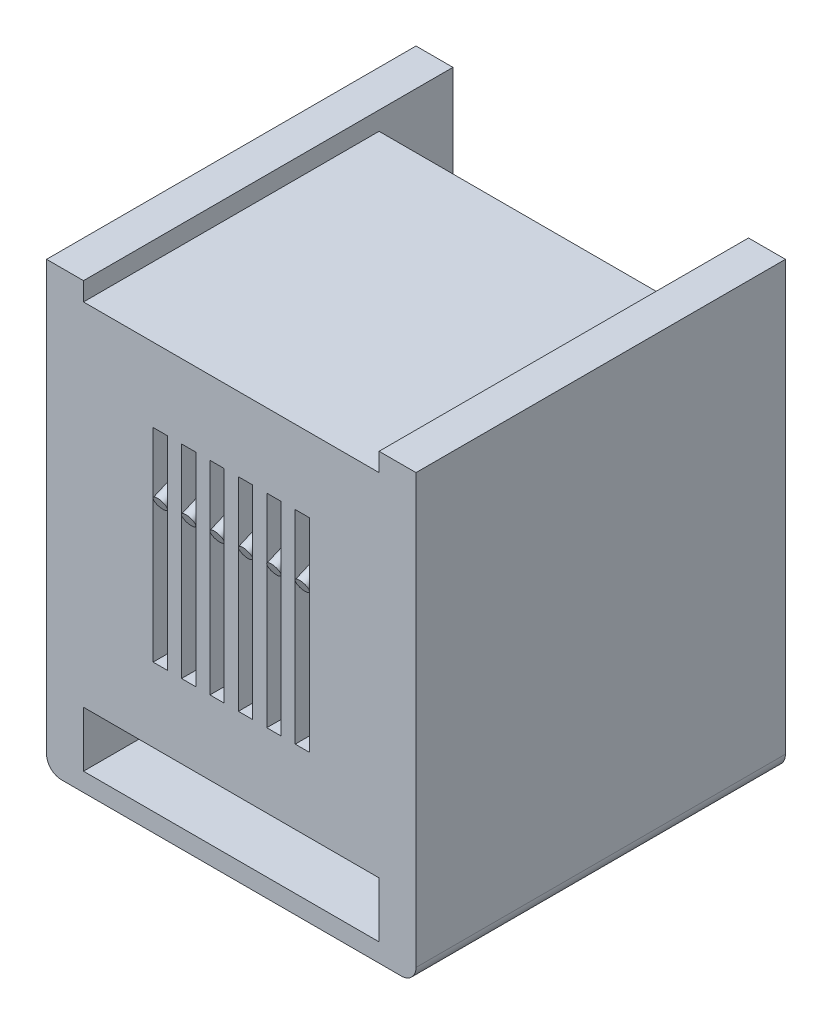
ISO-10303-21;
HEADER;
FILE_DESCRIPTION(('STEP AP214'),'2;1');
FILE_NAME('part.step','',(''),(''),'','','');
FILE_SCHEMA(('AUTOMOTIVE_DESIGN { 1 0 10303 214 1 1 1 1 }'));
ENDSEC;
DATA;
#1=APPLICATION_CONTEXT('core data for automotive mechanical design processes');
#2=APPLICATION_PROTOCOL_DEFINITION('international standard','automotive_design',2000,#1);
#3=PRODUCT_CONTEXT('',#1,'mechanical');
#4=PRODUCT('Part','Part','',(#3));
#5=PRODUCT_RELATED_PRODUCT_CATEGORY('part','',(#4));
#6=PRODUCT_DEFINITION_FORMATION('','',#4);
#7=PRODUCT_DEFINITION_CONTEXT('part definition',#1,'design');
#8=PRODUCT_DEFINITION('design','',#6,#7);
#9=PRODUCT_DEFINITION_SHAPE('','',#8);
#10=(LENGTH_UNIT() NAMED_UNIT(*) SI_UNIT(.MILLI.,.METRE.));
#11=(NAMED_UNIT(*) PLANE_ANGLE_UNIT() SI_UNIT($,.RADIAN.));
#12=(NAMED_UNIT(*) SI_UNIT($,.STERADIAN.) SOLID_ANGLE_UNIT());
#13=UNCERTAINTY_MEASURE_WITH_UNIT(LENGTH_MEASURE(1.E-05),#10,'distance_accuracy_value','');
#14=(GEOMETRIC_REPRESENTATION_CONTEXT(3) GLOBAL_UNCERTAINTY_ASSIGNED_CONTEXT((#13)) GLOBAL_UNIT_ASSIGNED_CONTEXT((#10,
#11,#12)) REPRESENTATION_CONTEXT('',''));
#15=CARTESIAN_POINT('',(0.,0.,0.));
#16=DIRECTION('',(0.,0.,1.));
#17=DIRECTION('',(1.,0.,0.));
#18=AXIS2_PLACEMENT_3D('',#15,#16,#17);
#19=CARTESIAN_POINT('',(-2.175756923,2.468789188,12.590945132));
#20=DIRECTION('',(0.,-0.39872611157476,0.917070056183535));
#21=DIRECTION('',(-1.,0.,0.));
#22=AXIS2_PLACEMENT_3D('',#19,#20,#21);
#23=PLANE('',#22);
#24=CARTESIAN_POINT('',(-2.403846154,2.25961538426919,12.4999999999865));
#25=DIRECTION('',(0.,-0.398726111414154,0.917070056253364));
#26=DIRECTION('',(0.,-0.917070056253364,-0.398726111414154));
#27=AXIS2_PLACEMENT_3D('',#24,#25,#26);
#28=CIRCLE('',#27,0.225384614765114);
#29=CARTESIAN_POINT('',(-2.403846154,2.0529219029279,12.4101332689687));
#30=VERTEX_POINT('',#29);
#31=EDGE_CURVE('E20',#30,#30,#28,.F.);
#32=ORIENTED_EDGE('',*,*,#31,.F.);
#33=EDGE_LOOP('',(#32));
#34=FACE_BOUND('',#33,.T.);
#35=ADVANCED_FACE('F16',(#34),#23,.T.);
#36=CARTESIAN_POINT('',(-1.214218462,2.468789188,12.590945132));
#37=DIRECTION('',(0.,-0.39872611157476,0.917070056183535));
#38=DIRECTION('',(-1.,0.,0.));
#39=AXIS2_PLACEMENT_3D('',#36,#37,#38);
#40=PLANE('',#39);
#41=CARTESIAN_POINT('',(-1.442307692,2.25961538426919,12.4999999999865));
#42=DIRECTION('',(0.,-0.398726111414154,0.917070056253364));
#43=DIRECTION('',(0.,-0.917070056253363,-0.398726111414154));
#44=AXIS2_PLACEMENT_3D('',#41,#42,#43);
#45=CIRCLE('',#44,0.225384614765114);
#46=CARTESIAN_POINT('',(-1.442307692,2.0529219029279,12.4101332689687));
#47=VERTEX_POINT('',#46);
#48=EDGE_CURVE('E1151',#47,#47,#45,.F.);
#49=ORIENTED_EDGE('',*,*,#48,.F.);
#50=EDGE_LOOP('',(#49));
#51=FACE_BOUND('',#50,.T.);
#52=ADVANCED_FACE('F1161',(#51),#40,.T.);
#53=CARTESIAN_POINT('',(-0.25268,2.468789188,12.590945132));
#54=DIRECTION('',(0.,-0.39872611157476,0.917070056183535));
#55=DIRECTION('',(-1.,0.,0.));
#56=AXIS2_PLACEMENT_3D('',#53,#54,#55);
#57=PLANE('',#56);
#58=CARTESIAN_POINT('',(-0.480769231,2.25961538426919,12.4999999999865));
#59=DIRECTION('',(0.,-0.398726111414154,0.917070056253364));
#60=DIRECTION('',(0.,-0.917070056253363,-0.398726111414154));
#61=AXIS2_PLACEMENT_3D('',#58,#59,#60);
#62=CIRCLE('',#61,0.225384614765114);
#63=CARTESIAN_POINT('',(-0.480769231,2.0529219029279,12.4101332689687));
#64=VERTEX_POINT('',#63);
#65=EDGE_CURVE('E1149',#64,#64,#62,.F.);
#66=ORIENTED_EDGE('',*,*,#65,.F.);
#67=EDGE_LOOP('',(#66));
#68=FACE_BOUND('',#67,.T.);
#69=ADVANCED_FACE('F1167',(#68),#57,.T.);
#70=CARTESIAN_POINT('',(0.708858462,2.468789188,12.590945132));
#71=DIRECTION('',(0.,-0.39872611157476,0.917070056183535));
#72=DIRECTION('',(-1.,0.,0.));
#73=AXIS2_PLACEMENT_3D('',#70,#71,#72);
#74=PLANE('',#73);
#75=CARTESIAN_POINT('',(0.480769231,2.25961538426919,12.4999999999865));
#76=DIRECTION('',(0.,-0.398726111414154,0.917070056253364));
#77=DIRECTION('',(0.,-0.917070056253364,-0.398726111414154));
#78=AXIS2_PLACEMENT_3D('',#75,#76,#77);
#79=CIRCLE('',#78,0.225384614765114);
#80=CARTESIAN_POINT('',(0.480769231,2.0529219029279,12.4101332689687));
#81=VERTEX_POINT('',#80);
#82=EDGE_CURVE('E1146',#81,#81,#79,.F.);
#83=ORIENTED_EDGE('',*,*,#82,.F.);
#84=EDGE_LOOP('',(#83));
#85=FACE_BOUND('',#84,.T.);
#86=ADVANCED_FACE('F1369',(#85),#74,.T.);
#87=CARTESIAN_POINT('',(1.670396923,2.468789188,12.590945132));
#88=DIRECTION('',(0.,-0.39872611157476,0.917070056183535));
#89=DIRECTION('',(-1.,0.,0.));
#90=AXIS2_PLACEMENT_3D('',#87,#88,#89);
#91=PLANE('',#90);
#92=CARTESIAN_POINT('',(1.442307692,2.25961538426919,12.4999999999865));
#93=DIRECTION('',(0.,-0.398726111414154,0.917070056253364));
#94=DIRECTION('',(0.,-0.917070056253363,-0.398726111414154));
#95=AXIS2_PLACEMENT_3D('',#92,#93,#94);
#96=CIRCLE('',#95,0.225384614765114);
#97=CARTESIAN_POINT('',(1.442307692,2.0529219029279,12.4101332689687));
#98=VERTEX_POINT('',#97);
#99=EDGE_CURVE('E1095',#98,#98,#96,.F.);
#100=ORIENTED_EDGE('',*,*,#99,.F.);
#101=EDGE_LOOP('',(#100));
#102=FACE_BOUND('',#101,.T.);
#103=ADVANCED_FACE('F1364',(#102),#91,.T.);
#104=CARTESIAN_POINT('',(-2.403846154,5.05108035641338,6.07963056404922));
#105=DIRECTION('',(0.,-0.398726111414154,0.917070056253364));
#106=DIRECTION('',(0.,-0.917070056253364,-0.398726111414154));
#107=AXIS2_PLACEMENT_3D('',#104,#105,#106);
#108=CYLINDRICAL_SURFACE('',#107,0.225384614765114);
#109=CARTESIAN_POINT('',(-2.403846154,5.0510803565,6.0796305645));
#110=DIRECTION('',(0.,0.398726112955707,-0.917070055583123));
#111=DIRECTION('',(0.,0.917070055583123,0.398726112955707));
#112=AXIS2_PLACEMENT_3D('',#109,#110,#111);
#113=CIRCLE('',#112,0.225384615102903);
#114=CARTESIAN_POINT('',(-2.40384615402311,5.25777383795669,6.16949729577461));
#115=VERTEX_POINT('',#114);
#116=CARTESIAN_POINT('',(-2.40384615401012,4.844386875,5.989763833));
#117=VERTEX_POINT('',#116);
#118=EDGE_CURVE('E1058',#115,#117,#113,.T.);
#119=ORIENTED_EDGE('',*,*,#118,.F.);
#120=CARTESIAN_POINT('',(-2.403846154,5.0510803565,6.0796305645));
#121=DIRECTION('',(0.,0.398726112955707,-0.917070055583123));
#122=DIRECTION('',(0.,0.917070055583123,0.398726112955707));
#123=AXIS2_PLACEMENT_3D('',#120,#121,#122);
#124=CIRCLE('',#123,0.225384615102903);
#125=EDGE_CURVE('E1047',#117,#115,#124,.T.);
#126=ORIENTED_EDGE('',*,*,#125,.F.);
#127=EDGE_LOOP('',(#119,#126));
#128=FACE_BOUND('',#127,.T.);
#129=ORIENTED_EDGE('',*,*,#31,.T.);
#130=EDGE_LOOP('',(#129));
#131=FACE_BOUND('',#130,.T.);
#132=ADVANCED_FACE('F1158',(#128,#131),#108,.T.);
#133=CARTESIAN_POINT('',(-1.442307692,5.05108035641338,6.07963056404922));
#134=DIRECTION('',(0.,-0.398726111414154,0.917070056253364));
#135=DIRECTION('',(0.,-0.917070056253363,-0.398726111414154));
#136=AXIS2_PLACEMENT_3D('',#133,#134,#135);
#137=CYLINDRICAL_SURFACE('',#136,0.225384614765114);
#138=CARTESIAN_POINT('',(-1.442307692,5.0510803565,6.0796305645));
#139=DIRECTION('',(0.,0.398726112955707,-0.917070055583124));
#140=DIRECTION('',(0.,0.917070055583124,0.398726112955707));
#141=AXIS2_PLACEMENT_3D('',#138,#139,#140);
#142=CIRCLE('',#141,0.225384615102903);
#143=CARTESIAN_POINT('',(-1.44230769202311,5.25777383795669,6.16949729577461));
#144=VERTEX_POINT('',#143);
#145=CARTESIAN_POINT('',(-1.44230769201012,4.844386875,5.989763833));
#146=VERTEX_POINT('',#145);
#147=EDGE_CURVE('E1026',#144,#146,#142,.T.);
#148=ORIENTED_EDGE('',*,*,#147,.F.);
#149=CARTESIAN_POINT('',(-1.442307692,5.0510803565,6.0796305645));
#150=DIRECTION('',(0.,0.398726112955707,-0.917070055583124));
#151=DIRECTION('',(0.,0.917070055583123,0.398726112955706));
#152=AXIS2_PLACEMENT_3D('',#149,#150,#151);
#153=CIRCLE('',#152,0.225384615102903);
#154=EDGE_CURVE('E1015',#146,#144,#153,.T.);
#155=ORIENTED_EDGE('',*,*,#154,.F.);
#156=EDGE_LOOP('',(#148,#155));
#157=FACE_BOUND('',#156,.T.);
#158=ORIENTED_EDGE('',*,*,#48,.T.);
#159=EDGE_LOOP('',(#158));
#160=FACE_BOUND('',#159,.T.);
#161=ADVANCED_FACE('F1358',(#157,#160),#137,.T.);
#162=CARTESIAN_POINT('',(-0.480769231,5.05108035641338,6.07963056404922));
#163=DIRECTION('',(0.,-0.398726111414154,0.917070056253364));
#164=DIRECTION('',(0.,-0.917070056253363,-0.398726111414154));
#165=AXIS2_PLACEMENT_3D('',#162,#163,#164);
#166=CYLINDRICAL_SURFACE('',#165,0.225384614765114);
#167=CARTESIAN_POINT('',(-0.480769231,5.0510803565,6.0796305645));
#168=DIRECTION('',(0.,0.398726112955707,-0.917070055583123));
#169=DIRECTION('',(0.,0.917070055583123,0.398726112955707));
#170=AXIS2_PLACEMENT_3D('',#167,#168,#169);
#171=CIRCLE('',#170,0.225384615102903);
#172=CARTESIAN_POINT('',(-0.480769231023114,5.25777383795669,6.16949729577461));
#173=VERTEX_POINT('',#172);
#174=CARTESIAN_POINT('',(-0.480769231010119,4.844386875,5.989763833));
#175=VERTEX_POINT('',#174);
#176=EDGE_CURVE('E994',#173,#175,#171,.T.);
#177=ORIENTED_EDGE('',*,*,#176,.F.);
#178=CARTESIAN_POINT('',(-0.480769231,5.0510803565,6.0796305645));
#179=DIRECTION('',(0.,0.398726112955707,-0.917070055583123));
#180=DIRECTION('',(0.,0.917070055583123,0.398726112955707));
#181=AXIS2_PLACEMENT_3D('',#178,#179,#180);
#182=CIRCLE('',#181,0.225384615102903);
#183=EDGE_CURVE('E983',#175,#173,#182,.T.);
#184=ORIENTED_EDGE('',*,*,#183,.F.);
#185=EDGE_LOOP('',(#177,#184));
#186=FACE_BOUND('',#185,.T.);
#187=ORIENTED_EDGE('',*,*,#65,.T.);
#188=EDGE_LOOP('',(#187));
#189=FACE_BOUND('',#188,.T.);
#190=ADVANCED_FACE('F1354',(#186,#189),#166,.T.);
#191=CARTESIAN_POINT('',(0.480769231,5.05108035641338,6.07963056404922));
#192=DIRECTION('',(0.,-0.398726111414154,0.917070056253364));
#193=DIRECTION('',(0.,-0.917070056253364,-0.398726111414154));
#194=AXIS2_PLACEMENT_3D('',#191,#192,#193);
#195=CYLINDRICAL_SURFACE('',#194,0.225384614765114);
#196=CARTESIAN_POINT('',(0.480769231,5.0510803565,6.0796305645));
#197=DIRECTION('',(0.,0.398726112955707,-0.917070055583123));
#198=DIRECTION('',(0.,0.917070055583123,0.398726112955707));
#199=AXIS2_PLACEMENT_3D('',#196,#197,#198);
#200=CIRCLE('',#199,0.225384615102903);
#201=CARTESIAN_POINT('',(0.480769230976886,5.25777383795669,6.16949729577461));
#202=VERTEX_POINT('',#201);
#203=CARTESIAN_POINT('',(0.480769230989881,4.844386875,5.989763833));
#204=VERTEX_POINT('',#203);
#205=EDGE_CURVE('E962',#202,#204,#200,.T.);
#206=ORIENTED_EDGE('',*,*,#205,.F.);
#207=CARTESIAN_POINT('',(0.480769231,5.0510803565,6.0796305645));
#208=DIRECTION('',(0.,0.398726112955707,-0.917070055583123));
#209=DIRECTION('',(0.,0.917070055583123,0.398726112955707));
#210=AXIS2_PLACEMENT_3D('',#207,#208,#209);
#211=CIRCLE('',#210,0.225384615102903);
#212=EDGE_CURVE('E951',#204,#202,#211,.T.);
#213=ORIENTED_EDGE('',*,*,#212,.F.);
#214=EDGE_LOOP('',(#206,#213));
#215=FACE_BOUND('',#214,.T.);
#216=ORIENTED_EDGE('',*,*,#82,.T.);
#217=EDGE_LOOP('',(#216));
#218=FACE_BOUND('',#217,.T.);
#219=ADVANCED_FACE('F1350',(#215,#218),#195,.T.);
#220=CARTESIAN_POINT('',(1.442307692,5.05108035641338,6.07963056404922));
#221=DIRECTION('',(0.,-0.398726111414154,0.917070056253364));
#222=DIRECTION('',(0.,-0.917070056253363,-0.398726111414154));
#223=AXIS2_PLACEMENT_3D('',#220,#221,#222);
#224=CYLINDRICAL_SURFACE('',#223,0.225384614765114);
#225=CARTESIAN_POINT('',(1.442307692,5.0510803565,6.0796305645));
#226=DIRECTION('',(0.,0.398726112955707,-0.917070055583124));
#227=DIRECTION('',(0.,0.917070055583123,0.398726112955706));
#228=AXIS2_PLACEMENT_3D('',#225,#226,#227);
#229=CIRCLE('',#228,0.225384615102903);
#230=CARTESIAN_POINT('',(1.44230769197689,5.25777383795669,6.16949729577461));
#231=VERTEX_POINT('',#230);
#232=CARTESIAN_POINT('',(1.44230769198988,4.844386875,5.989763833));
#233=VERTEX_POINT('',#232);
#234=EDGE_CURVE('E930',#231,#233,#229,.T.);
#235=ORIENTED_EDGE('',*,*,#234,.F.);
#236=CARTESIAN_POINT('',(1.442307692,5.0510803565,6.0796305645));
#237=DIRECTION('',(0.,0.398726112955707,-0.917070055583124));
#238=DIRECTION('',(0.,0.917070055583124,0.398726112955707));
#239=AXIS2_PLACEMENT_3D('',#236,#237,#238);
#240=CIRCLE('',#239,0.225384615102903);
#241=EDGE_CURVE('E919',#233,#231,#240,.T.);
#242=ORIENTED_EDGE('',*,*,#241,.F.);
#243=EDGE_LOOP('',(#235,#242));
#244=FACE_BOUND('',#243,.T.);
#245=ORIENTED_EDGE('',*,*,#99,.T.);
#246=EDGE_LOOP('',(#245));
#247=FACE_BOUND('',#246,.T.);
#248=ADVANCED_FACE('F1341',(#244,#247),#224,.T.);
#249=CARTESIAN_POINT('',(-2.403846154,6.235,6.27899362));
#250=CARTESIAN_POINT('',(-2.403846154,6.235,5.269674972));
#251=CARTESIAN_POINT('',(-2.403846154,5.246828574,5.064147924));
#252=CARTESIAN_POINT('',(-2.403846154,4.844386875,5.989763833));
#253=CARTESIAN_POINT('',(-1.953076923,6.235,6.27899362));
#254=CARTESIAN_POINT('',(-1.953076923,6.235,5.269674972));
#255=CARTESIAN_POINT('',(-1.953076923,5.246828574,5.064147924));
#256=CARTESIAN_POINT('',(-1.953076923,4.844386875,5.989763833));
#257=CARTESIAN_POINT('',(-1.953076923,5.784230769,6.27899362));
#258=CARTESIAN_POINT('',(-1.953076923,5.784230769,5.896886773));
#259=CARTESIAN_POINT('',(-1.953076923,5.410129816,5.819078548));
#260=CARTESIAN_POINT('',(-1.953076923,5.257773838,6.169497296));
#261=CARTESIAN_POINT('',(-2.403846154,5.784230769,6.27899362));
#262=CARTESIAN_POINT('',(-2.403846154,5.784230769,5.896886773));
#263=CARTESIAN_POINT('',(-2.403846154,5.410129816,5.819078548));
#264=CARTESIAN_POINT('',(-2.403846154,5.257773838,6.169497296));
#265=(BOUNDED_SURFACE() B_SPLINE_SURFACE(3,3,((#249,#250,#251,#252),(#253,#254,#255,#256),(#257,
#258,#259,#260),(#261,#262,#263,#264)),.UNSPECIFIED.,.F.,.F.,
.F.) B_SPLINE_SURFACE_WITH_KNOTS((4,4),(4,4),(0.,1.),(0.,1.),
.UNSPECIFIED.) GEOMETRIC_REPRESENTATION_ITEM() RATIONAL_B_SPLINE_SURFACE(((1.,0.469086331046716,
0.469086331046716,1.),(0.333333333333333,0.156362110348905,0.156362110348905,0.333333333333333),
(0.333333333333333,0.156362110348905,0.156362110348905,0.333333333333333),(1.,0.469086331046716,
0.469086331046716,1.))) REPRESENTATION_ITEM('') SURFACE());
#266=CARTESIAN_POINT('',(-2.403846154,5.784230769,6.27899362));
#267=CARTESIAN_POINT('',(-2.403846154,5.784230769,5.896886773));
#268=CARTESIAN_POINT('',(-2.403846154,5.410129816,5.819078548));
#269=CARTESIAN_POINT('',(-2.403846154,5.257773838,6.169497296));
#270=(BOUNDED_CURVE() B_SPLINE_CURVE(3,(#266,#267,#268,#269),.UNSPECIFIED.,.F.,
.F.) B_SPLINE_CURVE_WITH_KNOTS((4,4),(0.,1.),
.UNSPECIFIED.) CURVE() GEOMETRIC_REPRESENTATION_ITEM() RATIONAL_B_SPLINE_CURVE((1.,
0.469086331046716,0.469086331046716,1.)) REPRESENTATION_ITEM(''));
#271=CARTESIAN_POINT('',(-2.40384615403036,5.784230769,6.27899362));
#272=VERTEX_POINT('',#271);
#273=EDGE_CURVE('E1044',#115,#272,#270,.F.);
#274=CARTESIAN_POINT('',(-2.403846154,6.235,6.27899362));
#275=CARTESIAN_POINT('',(-2.403846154,6.235,5.269674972));
#276=CARTESIAN_POINT('',(-2.403846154,5.246828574,5.064147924));
#277=CARTESIAN_POINT('',(-2.403846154,4.844386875,5.989763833));
#278=(BOUNDED_CURVE() B_SPLINE_CURVE(3,(#274,#275,#276,#277),.UNSPECIFIED.,.F.,
.F.) B_SPLINE_CURVE_WITH_KNOTS((4,4),(0.,1.),
.UNSPECIFIED.) CURVE() GEOMETRIC_REPRESENTATION_ITEM() RATIONAL_B_SPLINE_CURVE((1.,
0.469086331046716,0.469086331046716,1.)) REPRESENTATION_ITEM(''));
#279=CARTESIAN_POINT('',(-2.40384615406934,6.23500000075,6.27899362));
#280=VERTEX_POINT('',#279);
#281=EDGE_CURVE('E1052',#280,#117,#278,.T.);
#282=CARTESIAN_POINT('',(-2.403846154,6.009615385,6.27899362));
#283=DIRECTION('',(0.,0.,1.));
#284=DIRECTION('',(0.,-1.,0.));
#285=AXIS2_PLACEMENT_3D('',#282,#283,#284);
#286=CIRCLE('',#285,0.225384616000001);
#287=EDGE_CURVE('E1031',#272,#280,#286,.T.);
#288=ORIENTED_EDGE('',*,*,#273,.F.);
#289=ORIENTED_EDGE('',*,*,#118,.T.);
#290=ORIENTED_EDGE('',*,*,#281,.F.);
#291=ORIENTED_EDGE('',*,*,#287,.F.);
#292=EDGE_LOOP('',(#288,#289,#290,#291));
#293=FACE_BOUND('',#292,.T.);
#294=ADVANCED_FACE('F1330',(#293),#265,.T.);
#295=CARTESIAN_POINT('',(-2.403846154,5.784230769,6.27899362));
#296=CARTESIAN_POINT('',(-2.403846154,5.784230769,5.896886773));
#297=CARTESIAN_POINT('',(-2.403846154,5.410129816,5.819078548));
#298=CARTESIAN_POINT('',(-2.403846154,5.257773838,6.169497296));
#299=CARTESIAN_POINT('',(-2.854615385,5.784230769,6.27899362));
#300=CARTESIAN_POINT('',(-2.854615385,5.784230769,5.896886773));
#301=CARTESIAN_POINT('',(-2.854615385,5.410129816,5.819078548));
#302=CARTESIAN_POINT('',(-2.854615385,5.257773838,6.169497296));
#303=CARTESIAN_POINT('',(-2.854615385,6.235,6.27899362));
#304=CARTESIAN_POINT('',(-2.854615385,6.235,5.269674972));
#305=CARTESIAN_POINT('',(-2.854615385,5.246828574,5.064147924));
#306=CARTESIAN_POINT('',(-2.854615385,4.844386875,5.989763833));
#307=CARTESIAN_POINT('',(-2.403846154,6.235,6.27899362));
#308=CARTESIAN_POINT('',(-2.403846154,6.235,5.269674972));
#309=CARTESIAN_POINT('',(-2.403846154,5.246828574,5.064147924));
#310=CARTESIAN_POINT('',(-2.403846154,4.844386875,5.989763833));
#311=(BOUNDED_SURFACE() B_SPLINE_SURFACE(3,3,((#295,#296,#297,#298),(#299,#300,#301,#302),(#303,
#304,#305,#306),(#307,#308,#309,#310)),.UNSPECIFIED.,.F.,.F.,
.F.) B_SPLINE_SURFACE_WITH_KNOTS((4,4),(4,4),(0.,1.),(0.,1.),
.UNSPECIFIED.) GEOMETRIC_REPRESENTATION_ITEM() RATIONAL_B_SPLINE_SURFACE(((1.,0.469086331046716,
0.469086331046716,1.),(0.333333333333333,0.156362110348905,0.156362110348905,0.333333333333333),
(0.333333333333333,0.156362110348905,0.156362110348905,0.333333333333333),(1.,0.469086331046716,
0.469086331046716,1.))) REPRESENTATION_ITEM('') SURFACE());
#312=CARTESIAN_POINT('',(-2.403846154,6.009615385,6.27899362));
#313=DIRECTION('',(0.,0.,1.));
#314=DIRECTION('',(0.,-1.,0.));
#315=AXIS2_PLACEMENT_3D('',#312,#313,#314);
#316=CIRCLE('',#315,0.225384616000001);
#317=EDGE_CURVE('E1005',#280,#272,#316,.T.);
#318=ORIENTED_EDGE('',*,*,#125,.T.);
#319=ORIENTED_EDGE('',*,*,#273,.T.);
#320=ORIENTED_EDGE('',*,*,#317,.F.);
#321=ORIENTED_EDGE('',*,*,#281,.T.);
#322=EDGE_LOOP('',(#318,#319,#320,#321));
#323=FACE_BOUND('',#322,.T.);
#324=ADVANCED_FACE('F1319',(#323),#311,.T.);
#325=CARTESIAN_POINT('',(-1.442307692,6.235,6.27899362));
#326=CARTESIAN_POINT('',(-1.442307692,6.235,5.269674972));
#327=CARTESIAN_POINT('',(-1.442307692,5.246828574,5.064147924));
#328=CARTESIAN_POINT('',(-1.442307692,4.844386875,5.989763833));
#329=CARTESIAN_POINT('',(-0.991538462,6.235,6.27899362));
#330=CARTESIAN_POINT('',(-0.991538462,6.235,5.269674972));
#331=CARTESIAN_POINT('',(-0.991538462,5.246828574,5.064147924));
#332=CARTESIAN_POINT('',(-0.991538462,4.844386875,5.989763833));
#333=CARTESIAN_POINT('',(-0.991538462,5.784230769,6.27899362));
#334=CARTESIAN_POINT('',(-0.991538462,5.784230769,5.896886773));
#335=CARTESIAN_POINT('',(-0.991538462,5.410129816,5.819078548));
#336=CARTESIAN_POINT('',(-0.991538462,5.257773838,6.169497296));
#337=CARTESIAN_POINT('',(-1.442307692,5.784230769,6.27899362));
#338=CARTESIAN_POINT('',(-1.442307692,5.784230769,5.896886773));
#339=CARTESIAN_POINT('',(-1.442307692,5.410129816,5.819078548));
#340=CARTESIAN_POINT('',(-1.442307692,5.257773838,6.169497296));
#341=(BOUNDED_SURFACE() B_SPLINE_SURFACE(3,3,((#325,#326,#327,#328),(#329,#330,#331,#332),(#333,
#334,#335,#336),(#337,#338,#339,#340)),.UNSPECIFIED.,.F.,.F.,
.F.) B_SPLINE_SURFACE_WITH_KNOTS((4,4),(4,4),(0.,1.),(0.,1.),
.UNSPECIFIED.) GEOMETRIC_REPRESENTATION_ITEM() RATIONAL_B_SPLINE_SURFACE(((1.,0.469086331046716,
0.469086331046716,1.),(0.333333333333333,0.156362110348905,0.156362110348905,0.333333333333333),
(0.333333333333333,0.156362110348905,0.156362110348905,0.333333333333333),(1.,0.469086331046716,
0.469086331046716,1.))) REPRESENTATION_ITEM('') SURFACE());
#342=CARTESIAN_POINT('',(-1.442307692,5.784230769,6.27899362));
#343=CARTESIAN_POINT('',(-1.442307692,5.784230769,5.896886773));
#344=CARTESIAN_POINT('',(-1.442307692,5.410129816,5.819078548));
#345=CARTESIAN_POINT('',(-1.442307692,5.257773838,6.169497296));
#346=(BOUNDED_CURVE() B_SPLINE_CURVE(3,(#342,#343,#344,#345),.UNSPECIFIED.,.F.,
.F.) B_SPLINE_CURVE_WITH_KNOTS((4,4),(0.,1.),
.UNSPECIFIED.) CURVE() GEOMETRIC_REPRESENTATION_ITEM() RATIONAL_B_SPLINE_CURVE((1.,
0.469086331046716,0.469086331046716,1.)) REPRESENTATION_ITEM(''));
#347=CARTESIAN_POINT('',(-1.44230769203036,5.784230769,6.27899362));
#348=VERTEX_POINT('',#347);
#349=EDGE_CURVE('E1012',#144,#348,#346,.F.);
#350=CARTESIAN_POINT('',(-1.442307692,6.235,6.27899362));
#351=CARTESIAN_POINT('',(-1.442307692,6.235,5.269674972));
#352=CARTESIAN_POINT('',(-1.442307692,5.246828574,5.064147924));
#353=CARTESIAN_POINT('',(-1.442307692,4.844386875,5.989763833));
#354=(BOUNDED_CURVE() B_SPLINE_CURVE(3,(#350,#351,#352,#353),.UNSPECIFIED.,.F.,
.F.) B_SPLINE_CURVE_WITH_KNOTS((4,4),(0.,1.),
.UNSPECIFIED.) CURVE() GEOMETRIC_REPRESENTATION_ITEM() RATIONAL_B_SPLINE_CURVE((1.,
0.469086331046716,0.469086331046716,1.)) REPRESENTATION_ITEM(''));
#355=CARTESIAN_POINT('',(-1.44230769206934,6.23500000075,6.27899362));
#356=VERTEX_POINT('',#355);
#357=EDGE_CURVE('E1020',#356,#146,#354,.T.);
#358=CARTESIAN_POINT('',(-1.442307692,6.009615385,6.27899362));
#359=DIRECTION('',(0.,0.,1.));
#360=DIRECTION('',(0.,-1.,0.));
#361=AXIS2_PLACEMENT_3D('',#358,#359,#360);
#362=CIRCLE('',#361,0.225384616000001);
#363=EDGE_CURVE('E999',#348,#356,#362,.T.);
#364=ORIENTED_EDGE('',*,*,#349,.F.);
#365=ORIENTED_EDGE('',*,*,#147,.T.);
#366=ORIENTED_EDGE('',*,*,#357,.F.);
#367=ORIENTED_EDGE('',*,*,#363,.F.);
#368=EDGE_LOOP('',(#364,#365,#366,#367));
#369=FACE_BOUND('',#368,.T.);
#370=ADVANCED_FACE('F1308',(#369),#341,.T.);
#371=CARTESIAN_POINT('',(-1.442307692,5.784230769,6.27899362));
#372=CARTESIAN_POINT('',(-1.442307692,5.784230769,5.896886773));
#373=CARTESIAN_POINT('',(-1.442307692,5.410129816,5.819078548));
#374=CARTESIAN_POINT('',(-1.442307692,5.257773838,6.169497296));
#375=CARTESIAN_POINT('',(-1.893076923,5.784230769,6.27899362));
#376=CARTESIAN_POINT('',(-1.893076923,5.784230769,5.896886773));
#377=CARTESIAN_POINT('',(-1.893076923,5.410129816,5.819078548));
#378=CARTESIAN_POINT('',(-1.893076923,5.257773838,6.169497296));
#379=CARTESIAN_POINT('',(-1.893076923,6.235,6.27899362));
#380=CARTESIAN_POINT('',(-1.893076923,6.235,5.269674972));
#381=CARTESIAN_POINT('',(-1.893076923,5.246828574,5.064147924));
#382=CARTESIAN_POINT('',(-1.893076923,4.844386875,5.989763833));
#383=CARTESIAN_POINT('',(-1.442307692,6.235,6.27899362));
#384=CARTESIAN_POINT('',(-1.442307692,6.235,5.269674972));
#385=CARTESIAN_POINT('',(-1.442307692,5.246828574,5.064147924));
#386=CARTESIAN_POINT('',(-1.442307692,4.844386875,5.989763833));
#387=(BOUNDED_SURFACE() B_SPLINE_SURFACE(3,3,((#371,#372,#373,#374),(#375,#376,#377,#378),(#379,
#380,#381,#382),(#383,#384,#385,#386)),.UNSPECIFIED.,.F.,.F.,
.F.) B_SPLINE_SURFACE_WITH_KNOTS((4,4),(4,4),(0.,1.),(0.,1.),
.UNSPECIFIED.) GEOMETRIC_REPRESENTATION_ITEM() RATIONAL_B_SPLINE_SURFACE(((1.,0.469086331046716,
0.469086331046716,1.),(0.333333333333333,0.156362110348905,0.156362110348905,0.333333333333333),
(0.333333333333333,0.156362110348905,0.156362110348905,0.333333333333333),(1.,0.469086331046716,
0.469086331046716,1.))) REPRESENTATION_ITEM('') SURFACE());
#388=CARTESIAN_POINT('',(-1.442307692,6.009615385,6.27899362));
#389=DIRECTION('',(0.,0.,1.));
#390=DIRECTION('',(0.,-1.,0.));
#391=AXIS2_PLACEMENT_3D('',#388,#389,#390);
#392=CIRCLE('',#391,0.225384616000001);
#393=EDGE_CURVE('E973',#356,#348,#392,.T.);
#394=ORIENTED_EDGE('',*,*,#154,.T.);
#395=ORIENTED_EDGE('',*,*,#349,.T.);
#396=ORIENTED_EDGE('',*,*,#393,.F.);
#397=ORIENTED_EDGE('',*,*,#357,.T.);
#398=EDGE_LOOP('',(#394,#395,#396,#397));
#399=FACE_BOUND('',#398,.T.);
#400=ADVANCED_FACE('F1297',(#399),#387,.T.);
#401=CARTESIAN_POINT('',(-0.480769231,6.235,6.27899362));
#402=CARTESIAN_POINT('',(-0.480769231,6.235,5.269674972));
#403=CARTESIAN_POINT('',(-0.480769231,5.246828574,5.064147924));
#404=CARTESIAN_POINT('',(-0.480769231,4.844386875,5.989763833));
#405=CARTESIAN_POINT('',(-0.03,6.235,6.27899362));
#406=CARTESIAN_POINT('',(-0.03,6.235,5.269674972));
#407=CARTESIAN_POINT('',(-0.03,5.246828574,5.064147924));
#408=CARTESIAN_POINT('',(-0.03,4.844386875,5.989763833));
#409=CARTESIAN_POINT('',(-0.03,5.784230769,6.27899362));
#410=CARTESIAN_POINT('',(-0.03,5.784230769,5.896886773));
#411=CARTESIAN_POINT('',(-0.03,5.410129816,5.819078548));
#412=CARTESIAN_POINT('',(-0.03,5.257773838,6.169497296));
#413=CARTESIAN_POINT('',(-0.480769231,5.784230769,6.27899362));
#414=CARTESIAN_POINT('',(-0.480769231,5.784230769,5.896886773));
#415=CARTESIAN_POINT('',(-0.480769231,5.410129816,5.819078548));
#416=CARTESIAN_POINT('',(-0.480769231,5.257773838,6.169497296));
#417=(BOUNDED_SURFACE() B_SPLINE_SURFACE(3,3,((#401,#402,#403,#404),(#405,#406,#407,#408),(#409,
#410,#411,#412),(#413,#414,#415,#416)),.UNSPECIFIED.,.F.,.F.,
.F.) B_SPLINE_SURFACE_WITH_KNOTS((4,4),(4,4),(0.,1.),(0.,1.),
.UNSPECIFIED.) GEOMETRIC_REPRESENTATION_ITEM() RATIONAL_B_SPLINE_SURFACE(((1.,0.469086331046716,
0.469086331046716,1.),(0.333333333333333,0.156362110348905,0.156362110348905,0.333333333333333),
(0.333333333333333,0.156362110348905,0.156362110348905,0.333333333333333),(1.,0.469086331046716,
0.469086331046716,1.))) REPRESENTATION_ITEM('') SURFACE());
#418=CARTESIAN_POINT('',(-0.480769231,5.784230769,6.27899362));
#419=CARTESIAN_POINT('',(-0.480769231,5.784230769,5.896886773));
#420=CARTESIAN_POINT('',(-0.480769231,5.410129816,5.819078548));
#421=CARTESIAN_POINT('',(-0.480769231,5.257773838,6.169497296));
#422=(BOUNDED_CURVE() B_SPLINE_CURVE(3,(#418,#419,#420,#421),.UNSPECIFIED.,.F.,
.F.) B_SPLINE_CURVE_WITH_KNOTS((4,4),(0.,1.),
.UNSPECIFIED.) CURVE() GEOMETRIC_REPRESENTATION_ITEM() RATIONAL_B_SPLINE_CURVE((1.,
0.469086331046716,0.469086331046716,1.)) REPRESENTATION_ITEM(''));
#423=CARTESIAN_POINT('',(-0.480769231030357,5.784230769,6.27899362));
#424=VERTEX_POINT('',#423);
#425=EDGE_CURVE('E980',#173,#424,#422,.F.);
#426=CARTESIAN_POINT('',(-0.480769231,6.235,6.27899362));
#427=CARTESIAN_POINT('',(-0.480769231,6.235,5.269674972));
#428=CARTESIAN_POINT('',(-0.480769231,5.246828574,5.064147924));
#429=CARTESIAN_POINT('',(-0.480769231,4.844386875,5.989763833));
#430=(BOUNDED_CURVE() B_SPLINE_CURVE(3,(#426,#427,#428,#429),.UNSPECIFIED.,.F.,
.F.) B_SPLINE_CURVE_WITH_KNOTS((4,4),(0.,1.),
.UNSPECIFIED.) CURVE() GEOMETRIC_REPRESENTATION_ITEM() RATIONAL_B_SPLINE_CURVE((1.,
0.469086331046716,0.469086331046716,1.)) REPRESENTATION_ITEM(''));
#431=CARTESIAN_POINT('',(-0.480769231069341,6.23500000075,6.27899362));
#432=VERTEX_POINT('',#431);
#433=EDGE_CURVE('E988',#432,#175,#430,.T.);
#434=CARTESIAN_POINT('',(-0.480769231,6.009615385,6.27899362));
#435=DIRECTION('',(0.,0.,1.));
#436=DIRECTION('',(0.,-1.,0.));
#437=AXIS2_PLACEMENT_3D('',#434,#435,#436);
#438=CIRCLE('',#437,0.225384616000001);
#439=EDGE_CURVE('E967',#424,#432,#438,.T.);
#440=ORIENTED_EDGE('',*,*,#425,.F.);
#441=ORIENTED_EDGE('',*,*,#176,.T.);
#442=ORIENTED_EDGE('',*,*,#433,.F.);
#443=ORIENTED_EDGE('',*,*,#439,.F.);
#444=EDGE_LOOP('',(#440,#441,#442,#443));
#445=FACE_BOUND('',#444,.T.);
#446=ADVANCED_FACE('F1286',(#445),#417,.T.);
#447=CARTESIAN_POINT('',(-0.480769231,5.784230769,6.27899362));
#448=CARTESIAN_POINT('',(-0.480769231,5.784230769,5.896886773));
#449=CARTESIAN_POINT('',(-0.480769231,5.410129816,5.819078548));
#450=CARTESIAN_POINT('',(-0.480769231,5.257773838,6.169497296));
#451=CARTESIAN_POINT('',(-0.931538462,5.784230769,6.27899362));
#452=CARTESIAN_POINT('',(-0.931538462,5.784230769,5.896886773));
#453=CARTESIAN_POINT('',(-0.931538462,5.410129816,5.819078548));
#454=CARTESIAN_POINT('',(-0.931538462,5.257773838,6.169497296));
#455=CARTESIAN_POINT('',(-0.931538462,6.235,6.27899362));
#456=CARTESIAN_POINT('',(-0.931538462,6.235,5.269674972));
#457=CARTESIAN_POINT('',(-0.931538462,5.246828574,5.064147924));
#458=CARTESIAN_POINT('',(-0.931538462,4.844386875,5.989763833));
#459=CARTESIAN_POINT('',(-0.480769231,6.235,6.27899362));
#460=CARTESIAN_POINT('',(-0.480769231,6.235,5.269674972));
#461=CARTESIAN_POINT('',(-0.480769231,5.246828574,5.064147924));
#462=CARTESIAN_POINT('',(-0.480769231,4.844386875,5.989763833));
#463=(BOUNDED_SURFACE() B_SPLINE_SURFACE(3,3,((#447,#448,#449,#450),(#451,#452,#453,#454),(#455,
#456,#457,#458),(#459,#460,#461,#462)),.UNSPECIFIED.,.F.,.F.,
.F.) B_SPLINE_SURFACE_WITH_KNOTS((4,4),(4,4),(0.,1.),(0.,1.),
.UNSPECIFIED.) GEOMETRIC_REPRESENTATION_ITEM() RATIONAL_B_SPLINE_SURFACE(((1.,0.469086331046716,
0.469086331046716,1.),(0.333333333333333,0.156362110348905,0.156362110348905,0.333333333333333),
(0.333333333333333,0.156362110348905,0.156362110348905,0.333333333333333),(1.,0.469086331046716,
0.469086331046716,1.))) REPRESENTATION_ITEM('') SURFACE());
#464=CARTESIAN_POINT('',(-0.480769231,6.009615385,6.27899362));
#465=DIRECTION('',(0.,0.,1.));
#466=DIRECTION('',(0.,-1.,0.));
#467=AXIS2_PLACEMENT_3D('',#464,#465,#466);
#468=CIRCLE('',#467,0.225384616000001);
#469=EDGE_CURVE('E941',#432,#424,#468,.T.);
#470=ORIENTED_EDGE('',*,*,#183,.T.);
#471=ORIENTED_EDGE('',*,*,#425,.T.);
#472=ORIENTED_EDGE('',*,*,#469,.F.);
#473=ORIENTED_EDGE('',*,*,#433,.T.);
#474=EDGE_LOOP('',(#470,#471,#472,#473));
#475=FACE_BOUND('',#474,.T.);
#476=ADVANCED_FACE('F1275',(#475),#463,.T.);
#477=CARTESIAN_POINT('',(0.480769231,6.235,6.27899362));
#478=CARTESIAN_POINT('',(0.480769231,6.235,5.269674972));
#479=CARTESIAN_POINT('',(0.480769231,5.246828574,5.064147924));
#480=CARTESIAN_POINT('',(0.480769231,4.844386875,5.989763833));
#481=CARTESIAN_POINT('',(0.931538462,6.235,6.27899362));
#482=CARTESIAN_POINT('',(0.931538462,6.235,5.269674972));
#483=CARTESIAN_POINT('',(0.931538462,5.246828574,5.064147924));
#484=CARTESIAN_POINT('',(0.931538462,4.844386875,5.989763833));
#485=CARTESIAN_POINT('',(0.931538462,5.784230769,6.27899362));
#486=CARTESIAN_POINT('',(0.931538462,5.784230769,5.896886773));
#487=CARTESIAN_POINT('',(0.931538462,5.410129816,5.819078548));
#488=CARTESIAN_POINT('',(0.931538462,5.257773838,6.169497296));
#489=CARTESIAN_POINT('',(0.480769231,5.784230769,6.27899362));
#490=CARTESIAN_POINT('',(0.480769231,5.784230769,5.896886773));
#491=CARTESIAN_POINT('',(0.480769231,5.410129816,5.819078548));
#492=CARTESIAN_POINT('',(0.480769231,5.257773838,6.169497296));
#493=(BOUNDED_SURFACE() B_SPLINE_SURFACE(3,3,((#477,#478,#479,#480),(#481,#482,#483,#484),(#485,
#486,#487,#488),(#489,#490,#491,#492)),.UNSPECIFIED.,.F.,.F.,
.F.) B_SPLINE_SURFACE_WITH_KNOTS((4,4),(4,4),(0.,1.),(0.,1.),
.UNSPECIFIED.) GEOMETRIC_REPRESENTATION_ITEM() RATIONAL_B_SPLINE_SURFACE(((1.,0.469086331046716,
0.469086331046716,1.),(0.333333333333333,0.156362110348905,0.156362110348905,0.333333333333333),
(0.333333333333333,0.156362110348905,0.156362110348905,0.333333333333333),(1.,0.469086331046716,
0.469086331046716,1.))) REPRESENTATION_ITEM('') SURFACE());
#494=CARTESIAN_POINT('',(0.480769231,5.784230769,6.27899362));
#495=CARTESIAN_POINT('',(0.480769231,5.784230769,5.896886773));
#496=CARTESIAN_POINT('',(0.480769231,5.410129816,5.819078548));
#497=CARTESIAN_POINT('',(0.480769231,5.257773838,6.169497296));
#498=(BOUNDED_CURVE() B_SPLINE_CURVE(3,(#494,#495,#496,#497),.UNSPECIFIED.,.F.,
.F.) B_SPLINE_CURVE_WITH_KNOTS((4,4),(0.,1.),
.UNSPECIFIED.) CURVE() GEOMETRIC_REPRESENTATION_ITEM() RATIONAL_B_SPLINE_CURVE((1.,
0.469086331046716,0.469086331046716,1.)) REPRESENTATION_ITEM(''));
#499=CARTESIAN_POINT('',(0.480769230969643,5.784230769,6.27899362));
#500=VERTEX_POINT('',#499);
#501=EDGE_CURVE('E948',#202,#500,#498,.F.);
#502=CARTESIAN_POINT('',(0.480769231,6.235,6.27899362));
#503=CARTESIAN_POINT('',(0.480769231,6.235,5.269674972));
#504=CARTESIAN_POINT('',(0.480769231,5.246828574,5.064147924));
#505=CARTESIAN_POINT('',(0.480769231,4.844386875,5.989763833));
#506=(BOUNDED_CURVE() B_SPLINE_CURVE(3,(#502,#503,#504,#505),.UNSPECIFIED.,.F.,
.F.) B_SPLINE_CURVE_WITH_KNOTS((4,4),(0.,1.),
.UNSPECIFIED.) CURVE() GEOMETRIC_REPRESENTATION_ITEM() RATIONAL_B_SPLINE_CURVE((1.,
0.469086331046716,0.469086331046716,1.)) REPRESENTATION_ITEM(''));
#507=CARTESIAN_POINT('',(0.480769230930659,6.23500000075,6.27899362));
#508=VERTEX_POINT('',#507);
#509=EDGE_CURVE('E956',#508,#204,#506,.T.);
#510=CARTESIAN_POINT('',(0.480769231,6.009615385,6.27899362));
#511=DIRECTION('',(0.,0.,1.));
#512=DIRECTION('',(0.,-1.,0.));
#513=AXIS2_PLACEMENT_3D('',#510,#511,#512);
#514=CIRCLE('',#513,0.225384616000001);
#515=EDGE_CURVE('E935',#500,#508,#514,.T.);
#516=ORIENTED_EDGE('',*,*,#501,.F.);
#517=ORIENTED_EDGE('',*,*,#205,.T.);
#518=ORIENTED_EDGE('',*,*,#509,.F.);
#519=ORIENTED_EDGE('',*,*,#515,.F.);
#520=EDGE_LOOP('',(#516,#517,#518,#519));
#521=FACE_BOUND('',#520,.T.);
#522=ADVANCED_FACE('F1264',(#521),#493,.T.);
#523=CARTESIAN_POINT('',(0.480769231,5.784230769,6.27899362));
#524=CARTESIAN_POINT('',(0.480769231,5.784230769,5.896886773));
#525=CARTESIAN_POINT('',(0.480769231,5.410129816,5.819078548));
#526=CARTESIAN_POINT('',(0.480769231,5.257773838,6.169497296));
#527=CARTESIAN_POINT('',(0.03,5.784230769,6.27899362));
#528=CARTESIAN_POINT('',(0.03,5.784230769,5.896886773));
#529=CARTESIAN_POINT('',(0.03,5.410129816,5.819078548));
#530=CARTESIAN_POINT('',(0.03,5.257773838,6.169497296));
#531=CARTESIAN_POINT('',(0.03,6.235,6.27899362));
#532=CARTESIAN_POINT('',(0.03,6.235,5.269674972));
#533=CARTESIAN_POINT('',(0.03,5.246828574,5.064147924));
#534=CARTESIAN_POINT('',(0.03,4.844386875,5.989763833));
#535=CARTESIAN_POINT('',(0.480769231,6.235,6.27899362));
#536=CARTESIAN_POINT('',(0.480769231,6.235,5.269674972));
#537=CARTESIAN_POINT('',(0.480769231,5.246828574,5.064147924));
#538=CARTESIAN_POINT('',(0.480769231,4.844386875,5.989763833));
#539=(BOUNDED_SURFACE() B_SPLINE_SURFACE(3,3,((#523,#524,#525,#526),(#527,#528,#529,#530),(#531,
#532,#533,#534),(#535,#536,#537,#538)),.UNSPECIFIED.,.F.,.F.,
.F.) B_SPLINE_SURFACE_WITH_KNOTS((4,4),(4,4),(0.,1.),(0.,1.),
.UNSPECIFIED.) GEOMETRIC_REPRESENTATION_ITEM() RATIONAL_B_SPLINE_SURFACE(((1.,0.469086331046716,
0.469086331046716,1.),(0.333333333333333,0.156362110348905,0.156362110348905,0.333333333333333),
(0.333333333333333,0.156362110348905,0.156362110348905,0.333333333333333),(1.,0.469086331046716,
0.469086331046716,1.))) REPRESENTATION_ITEM('') SURFACE());
#540=CARTESIAN_POINT('',(0.480769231,6.009615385,6.27899362));
#541=DIRECTION('',(0.,0.,1.));
#542=DIRECTION('',(0.,-1.,0.));
#543=AXIS2_PLACEMENT_3D('',#540,#541,#542);
#544=CIRCLE('',#543,0.225384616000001);
#545=EDGE_CURVE('E908',#508,#500,#544,.T.);
#546=ORIENTED_EDGE('',*,*,#212,.T.);
#547=ORIENTED_EDGE('',*,*,#501,.T.);
#548=ORIENTED_EDGE('',*,*,#545,.F.);
#549=ORIENTED_EDGE('',*,*,#509,.T.);
#550=EDGE_LOOP('',(#546,#547,#548,#549));
#551=FACE_BOUND('',#550,.T.);
#552=ADVANCED_FACE('F1253',(#551),#539,.T.);
#553=CARTESIAN_POINT('',(1.442307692,6.235,6.27899362));
#554=CARTESIAN_POINT('',(1.442307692,6.235,5.269674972));
#555=CARTESIAN_POINT('',(1.442307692,5.246828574,5.064147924));
#556=CARTESIAN_POINT('',(1.442307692,4.844386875,5.989763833));
#557=CARTESIAN_POINT('',(1.893076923,6.235,6.27899362));
#558=CARTESIAN_POINT('',(1.893076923,6.235,5.269674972));
#559=CARTESIAN_POINT('',(1.893076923,5.246828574,5.064147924));
#560=CARTESIAN_POINT('',(1.893076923,4.844386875,5.989763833));
#561=CARTESIAN_POINT('',(1.893076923,5.784230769,6.27899362));
#562=CARTESIAN_POINT('',(1.893076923,5.784230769,5.896886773));
#563=CARTESIAN_POINT('',(1.893076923,5.410129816,5.819078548));
#564=CARTESIAN_POINT('',(1.893076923,5.257773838,6.169497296));
#565=CARTESIAN_POINT('',(1.442307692,5.784230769,6.27899362));
#566=CARTESIAN_POINT('',(1.442307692,5.784230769,5.896886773));
#567=CARTESIAN_POINT('',(1.442307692,5.410129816,5.819078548));
#568=CARTESIAN_POINT('',(1.442307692,5.257773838,6.169497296));
#569=(BOUNDED_SURFACE() B_SPLINE_SURFACE(3,3,((#553,#554,#555,#556),(#557,#558,#559,#560),(#561,
#562,#563,#564),(#565,#566,#567,#568)),.UNSPECIFIED.,.F.,.F.,
.F.) B_SPLINE_SURFACE_WITH_KNOTS((4,4),(4,4),(0.,1.),(0.,1.),
.UNSPECIFIED.) GEOMETRIC_REPRESENTATION_ITEM() RATIONAL_B_SPLINE_SURFACE(((1.,0.469086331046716,
0.469086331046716,1.),(0.333333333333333,0.156362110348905,0.156362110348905,0.333333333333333),
(0.333333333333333,0.156362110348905,0.156362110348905,0.333333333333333),(1.,0.469086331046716,
0.469086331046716,1.))) REPRESENTATION_ITEM('') SURFACE());
#570=CARTESIAN_POINT('',(1.442307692,5.784230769,6.27899362));
#571=CARTESIAN_POINT('',(1.442307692,5.784230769,5.896886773));
#572=CARTESIAN_POINT('',(1.442307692,5.410129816,5.819078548));
#573=CARTESIAN_POINT('',(1.442307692,5.257773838,6.169497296));
#574=(BOUNDED_CURVE() B_SPLINE_CURVE(3,(#570,#571,#572,#573),.UNSPECIFIED.,.F.,
.F.) B_SPLINE_CURVE_WITH_KNOTS((4,4),(0.,1.),
.UNSPECIFIED.) CURVE() GEOMETRIC_REPRESENTATION_ITEM() RATIONAL_B_SPLINE_CURVE((1.,
0.469086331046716,0.469086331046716,1.)) REPRESENTATION_ITEM(''));
#575=CARTESIAN_POINT('',(1.44230769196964,5.784230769,6.27899362));
#576=VERTEX_POINT('',#575);
#577=EDGE_CURVE('E915',#231,#576,#574,.F.);
#578=CARTESIAN_POINT('',(1.442307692,6.235,6.27899362));
#579=CARTESIAN_POINT('',(1.442307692,6.235,5.269674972));
#580=CARTESIAN_POINT('',(1.442307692,5.246828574,5.064147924));
#581=CARTESIAN_POINT('',(1.442307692,4.844386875,5.989763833));
#582=(BOUNDED_CURVE() B_SPLINE_CURVE(3,(#578,#579,#580,#581),.UNSPECIFIED.,.F.,
.F.) B_SPLINE_CURVE_WITH_KNOTS((4,4),(0.,1.),
.UNSPECIFIED.) CURVE() GEOMETRIC_REPRESENTATION_ITEM() RATIONAL_B_SPLINE_CURVE((1.,
0.469086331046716,0.469086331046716,1.)) REPRESENTATION_ITEM(''));
#583=CARTESIAN_POINT('',(1.44230769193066,6.23500000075,6.27899362));
#584=VERTEX_POINT('',#583);
#585=EDGE_CURVE('E924',#584,#233,#582,.T.);
#586=CARTESIAN_POINT('',(1.442307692,6.009615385,6.27899362));
#587=DIRECTION('',(0.,0.,1.));
#588=DIRECTION('',(0.,-1.,0.));
#589=AXIS2_PLACEMENT_3D('',#586,#587,#588);
#590=CIRCLE('',#589,0.225384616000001);
#591=EDGE_CURVE('E905',#576,#584,#590,.T.);
#592=ORIENTED_EDGE('',*,*,#577,.F.);
#593=ORIENTED_EDGE('',*,*,#234,.T.);
#594=ORIENTED_EDGE('',*,*,#585,.F.);
#595=ORIENTED_EDGE('',*,*,#591,.F.);
#596=EDGE_LOOP('',(#592,#593,#594,#595));
#597=FACE_BOUND('',#596,.T.);
#598=ADVANCED_FACE('F1242',(#597),#569,.T.);
#599=CARTESIAN_POINT('',(1.442307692,5.784230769,6.27899362));
#600=CARTESIAN_POINT('',(1.442307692,5.784230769,5.896886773));
#601=CARTESIAN_POINT('',(1.442307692,5.410129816,5.819078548));
#602=CARTESIAN_POINT('',(1.442307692,5.257773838,6.169497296));
#603=CARTESIAN_POINT('',(0.991538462,5.784230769,6.27899362));
#604=CARTESIAN_POINT('',(0.991538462,5.784230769,5.896886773));
#605=CARTESIAN_POINT('',(0.991538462,5.410129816,5.819078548));
#606=CARTESIAN_POINT('',(0.991538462,5.257773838,6.169497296));
#607=CARTESIAN_POINT('',(0.991538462,6.235,6.27899362));
#608=CARTESIAN_POINT('',(0.991538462,6.235,5.269674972));
#609=CARTESIAN_POINT('',(0.991538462,5.246828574,5.064147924));
#610=CARTESIAN_POINT('',(0.991538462,4.844386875,5.989763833));
#611=CARTESIAN_POINT('',(1.442307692,6.235,6.27899362));
#612=CARTESIAN_POINT('',(1.442307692,6.235,5.269674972));
#613=CARTESIAN_POINT('',(1.442307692,5.246828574,5.064147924));
#614=CARTESIAN_POINT('',(1.442307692,4.844386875,5.989763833));
#615=(BOUNDED_SURFACE() B_SPLINE_SURFACE(3,3,((#599,#600,#601,#602),(#603,#604,#605,#606),(#607,
#608,#609,#610),(#611,#612,#613,#614)),.UNSPECIFIED.,.F.,.F.,
.F.) B_SPLINE_SURFACE_WITH_KNOTS((4,4),(4,4),(0.,1.),(0.,1.),
.UNSPECIFIED.) GEOMETRIC_REPRESENTATION_ITEM() RATIONAL_B_SPLINE_SURFACE(((1.,0.469086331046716,
0.469086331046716,1.),(0.333333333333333,0.156362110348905,0.156362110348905,0.333333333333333),
(0.333333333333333,0.156362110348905,0.156362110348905,0.333333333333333),(1.,0.469086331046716,
0.469086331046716,1.))) REPRESENTATION_ITEM('') SURFACE());
#616=CARTESIAN_POINT('',(1.442307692,6.009615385,6.27899362));
#617=DIRECTION('',(0.,0.,1.));
#618=DIRECTION('',(0.,-1.,0.));
#619=AXIS2_PLACEMENT_3D('',#616,#617,#618);
#620=CIRCLE('',#619,0.225384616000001);
#621=EDGE_CURVE('E874',#584,#576,#620,.T.);
#622=ORIENTED_EDGE('',*,*,#241,.T.);
#623=ORIENTED_EDGE('',*,*,#577,.T.);
#624=ORIENTED_EDGE('',*,*,#621,.F.);
#625=ORIENTED_EDGE('',*,*,#585,.T.);
#626=EDGE_LOOP('',(#622,#623,#624,#625));
#627=FACE_BOUND('',#626,.T.);
#628=ADVANCED_FACE('F1236',(#627),#615,.T.);
#629=CARTESIAN_POINT('',(-0.5,-5.,2.5));
#630=DIRECTION('',(0.,-1.,0.));
#631=DIRECTION('',(0.,0.,-1.));
#632=AXIS2_PLACEMENT_3D('',#629,#630,#631);
#633=PLANE('',#632);
#634=DIRECTION('',(0.,0.,-1.));
#635=VECTOR('',#634,1.);
#636=CARTESIAN_POINT('',(0.7,-5.,1.25));
#637=LINE('',#636,#635);
#638=CARTESIAN_POINT('',(0.7,-5.,2.5));
#639=VERTEX_POINT('',#638);
#640=CARTESIAN_POINT('',(0.7,-4.99999999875,0.));
#641=VERTEX_POINT('',#640);
#642=EDGE_CURVE('E3074',#639,#641,#637,.T.);
#643=ORIENTED_EDGE('',*,*,#642,.T.);
#644=DIRECTION('',(-1.,0.,0.));
#645=VECTOR('',#644,1.);
#646=CARTESIAN_POINT('',(0.,-4.999999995,0.));
#647=LINE('',#646,#645);
#648=CARTESIAN_POINT('',(-0.5,-4.9999999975,0.));
#649=VERTEX_POINT('',#648);
#650=EDGE_CURVE('E200',#641,#649,#647,.T.);
#651=ORIENTED_EDGE('',*,*,#650,.T.);
#652=DIRECTION('',(0.,0.,1.));
#653=VECTOR('',#652,1.);
#654=CARTESIAN_POINT('',(-0.5,-5.,5.625));
#655=LINE('',#654,#653);
#656=CARTESIAN_POINT('',(-0.5000000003,-5.,2.4999999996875));
#657=VERTEX_POINT('',#656);
#658=EDGE_CURVE('E863',#649,#657,#655,.T.);
#659=ORIENTED_EDGE('',*,*,#658,.T.);
#660=DIRECTION('',(-1.,0.,0.));
#661=VECTOR('',#660,1.);
#662=CARTESIAN_POINT('',(-2.15,-5.,2.5));
#663=LINE('',#662,#661);
#664=EDGE_CURVE('E918',#639,#657,#663,.T.);
#665=ORIENTED_EDGE('',*,*,#664,.F.);
#666=EDGE_LOOP('',(#643,#651,#659,#665));
#667=FACE_BOUND('',#666,.T.);
#668=ADVANCED_FACE('F1241',(#667),#633,.F.);
#669=CARTESIAN_POINT('',(-5.,-6.875,2.5));
#670=DIRECTION('',(0.,0.,1.));
#671=DIRECTION('',(1.,0.,0.));
#672=AXIS2_PLACEMENT_3D('',#669,#670,#671);
#673=PLANE('',#672);
#674=DIRECTION('',(0.,-1.,0.));
#675=VECTOR('',#674,1.);
#676=CARTESIAN_POINT('',(-5.,-5.9375,2.5));
#677=LINE('',#676,#675);
#678=CARTESIAN_POINT('',(-5.,-5.,2.5));
#679=VERTEX_POINT('',#678);
#680=CARTESIAN_POINT('',(-5.,-6.875,2.5));
#681=VERTEX_POINT('',#680);
#682=EDGE_CURVE('E751',#679,#681,#677,.T.);
#683=ORIENTED_EDGE('',*,*,#682,.T.);
#684=DIRECTION('',(1.,0.,0.));
#685=VECTOR('',#684,1.);
#686=CARTESIAN_POINT('',(0.,-6.875,2.5));
#687=LINE('',#686,#685);
#688=CARTESIAN_POINT('',(0.7,-6.875,2.5));
#689=VERTEX_POINT('',#688);
#690=EDGE_CURVE('E2994',#681,#689,#687,.T.);
#691=ORIENTED_EDGE('',*,*,#690,.T.);
#692=DIRECTION('',(0.,1.,0.));
#693=VECTOR('',#692,1.);
#694=CARTESIAN_POINT('',(0.7,-5.9375,2.5));
#695=LINE('',#694,#693);
#696=EDGE_CURVE('E3071',#689,#639,#695,.T.);
#697=ORIENTED_EDGE('',*,*,#696,.T.);
#698=ORIENTED_EDGE('',*,*,#664,.T.);
#699=DIRECTION('',(1.,0.,0.));
#700=VECTOR('',#699,1.);
#701=CARTESIAN_POINT('',(0.,-5.,2.5));
#702=LINE('',#701,#700);
#703=EDGE_CURVE('E2990',#679,#657,#702,.T.);
#704=ORIENTED_EDGE('',*,*,#703,.F.);
#705=EDGE_LOOP('',(#683,#691,#697,#698,#704));
#706=FACE_BOUND('',#705,.T.);
#707=ADVANCED_FACE('F2527',(#706),#673,.T.);
#708=CARTESIAN_POINT('',(0.7,-6.875,0.));
#709=DIRECTION('',(-1.,0.,0.));
#710=DIRECTION('',(0.,0.,1.));
#711=AXIS2_PLACEMENT_3D('',#708,#709,#710);
#712=PLANE('',#711);
#713=DIRECTION('',(0.,0.,-1.));
#714=VECTOR('',#713,1.);
#715=CARTESIAN_POINT('',(0.700000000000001,-6.875,6.25));
#716=LINE('',#715,#714);
#717=CARTESIAN_POINT('',(0.700000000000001,-6.87499999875,0.));
#718=VERTEX_POINT('',#717);
#719=EDGE_CURVE('E902',#689,#718,#716,.T.);
#720=ORIENTED_EDGE('',*,*,#719,.T.);
#721=DIRECTION('',(0.,1.,0.));
#722=VECTOR('',#721,1.);
#723=CARTESIAN_POINT('',(0.700000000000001,0.,0.));
#724=LINE('',#723,#722);
#725=EDGE_CURVE('E873',#718,#641,#724,.T.);
#726=ORIENTED_EDGE('',*,*,#725,.T.);
#727=ORIENTED_EDGE('',*,*,#642,.F.);
#728=ORIENTED_EDGE('',*,*,#696,.F.);
#729=EDGE_LOOP('',(#720,#726,#727,#728));
#730=FACE_BOUND('',#729,.T.);
#731=ADVANCED_FACE('F2534',(#730),#712,.F.);
#732=CARTESIAN_POINT('',(3.8,-6.875,2.5));
#733=DIRECTION('',(1.,0.,0.));
#734=DIRECTION('',(0.,0.,-1.));
#735=AXIS2_PLACEMENT_3D('',#732,#733,#734);
#736=PLANE('',#735);
#737=DIRECTION('',(0.,0.,-1.));
#738=VECTOR('',#737,1.);
#739=CARTESIAN_POINT('',(3.8,-5.,1.25));
#740=LINE('',#739,#738);
#741=CARTESIAN_POINT('',(3.8,-5.,2.5));
#742=VERTEX_POINT('',#741);
#743=CARTESIAN_POINT('',(3.8,-5.,0.));
#744=VERTEX_POINT('',#743);
#745=EDGE_CURVE('E849',#742,#744,#740,.T.);
#746=ORIENTED_EDGE('',*,*,#745,.T.);
#747=DIRECTION('',(0.,-1.,0.));
#748=VECTOR('',#747,1.);
#749=CARTESIAN_POINT('',(3.8,0.,0.));
#750=LINE('',#749,#748);
#751=CARTESIAN_POINT('',(3.8,-6.87499999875,0.));
#752=VERTEX_POINT('',#751);
#753=EDGE_CURVE('E871',#744,#752,#750,.T.);
#754=ORIENTED_EDGE('',*,*,#753,.T.);
#755=DIRECTION('',(0.,0.,1.));
#756=VECTOR('',#755,1.);
#757=CARTESIAN_POINT('',(3.8,-6.875,6.25));
#758=LINE('',#757,#756);
#759=CARTESIAN_POINT('',(3.8,-6.875,2.5));
#760=VERTEX_POINT('',#759);
#761=EDGE_CURVE('E890',#752,#760,#758,.T.);
#762=ORIENTED_EDGE('',*,*,#761,.T.);
#763=DIRECTION('',(0.,-1.,0.));
#764=VECTOR('',#763,1.);
#765=CARTESIAN_POINT('',(3.8,-5.9375,2.5));
#766=LINE('',#765,#764);
#767=EDGE_CURVE('E878',#742,#760,#766,.T.);
#768=ORIENTED_EDGE('',*,*,#767,.F.);
#769=EDGE_LOOP('',(#746,#754,#762,#768));
#770=FACE_BOUND('',#769,.T.);
#771=ADVANCED_FACE('F2542',(#770),#736,.F.);
#772=CARTESIAN_POINT('',(-1.201923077,0.9375,10.625));
#773=DIRECTION('',(0.,1.,0.));
#774=DIRECTION('',(0.,0.,1.));
#775=AXIS2_PLACEMENT_3D('',#772,#773,#774);
#776=PLANE('',#775);
#777=DIRECTION('',(0.,0.,1.));
#778=VECTOR('',#777,1.);
#779=CARTESIAN_POINT('',(-1.201923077,0.9375,11.5625));
#780=LINE('',#779,#778);
#781=CARTESIAN_POINT('',(-1.201923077,0.9375,10.625));
#782=VERTEX_POINT('',#781);
#783=CARTESIAN_POINT('',(-1.201923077,0.9375,11.2499999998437));
#784=VERTEX_POINT('',#783);
#785=EDGE_CURVE('E3025',#782,#784,#780,.T.);
#786=ORIENTED_EDGE('',*,*,#785,.F.);
#787=DIRECTION('',(-1.,0.,0.));
#788=VECTOR('',#787,1.);
#789=CARTESIAN_POINT('',(-0.9615384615,0.9375,10.625));
#790=LINE('',#789,#788);
#791=CARTESIAN_POINT('',(-0.721153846,0.9375,10.625));
#792=VERTEX_POINT('',#791);
#793=EDGE_CURVE('E2035',#792,#782,#790,.T.);
#794=ORIENTED_EDGE('',*,*,#793,.F.);
#795=DIRECTION('',(0.,0.,-1.));
#796=VECTOR('',#795,1.);
#797=CARTESIAN_POINT('',(-0.721153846,0.9375,11.5625));
#798=LINE('',#797,#796);
#799=CARTESIAN_POINT('',(-0.721153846,0.9375,11.2499999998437));
#800=VERTEX_POINT('',#799);
#801=EDGE_CURVE('E2032',#800,#792,#798,.T.);
#802=ORIENTED_EDGE('',*,*,#801,.F.);
#803=DIRECTION('',(1.,0.,0.));
#804=VECTOR('',#803,1.);
#805=CARTESIAN_POINT('',(-0.9615384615,0.9375,11.25));
#806=LINE('',#805,#804);
#807=EDGE_CURVE('E3070',#784,#800,#806,.T.);
#808=ORIENTED_EDGE('',*,*,#807,.F.);
#809=EDGE_LOOP('',(#786,#794,#802,#808));
#810=FACE_BOUND('',#809,.T.);
#811=ADVANCED_FACE('F2550',(#810),#776,.F.);
#812=CARTESIAN_POINT('',(-0.721153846,-2.5,11.25));
#813=DIRECTION('',(0.,0.,-1.));
#814=DIRECTION('',(-1.,0.,0.));
#815=AXIS2_PLACEMENT_3D('',#812,#813,#814);
#816=PLANE('',#815);
#817=DIRECTION('',(0.,1.,0.));
#818=VECTOR('',#817,1.);
#819=CARTESIAN_POINT('',(-0.721153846,0.9375,11.249999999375));
#820=LINE('',#819,#818);
#821=CARTESIAN_POINT('',(-0.721153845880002,-2.5,11.2499999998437));
#822=VERTEX_POINT('',#821);
#823=EDGE_CURVE('E3017',#822,#800,#820,.T.);
#824=ORIENTED_EDGE('',*,*,#823,.F.);
#825=DIRECTION('',(-1.,0.,0.));
#826=VECTOR('',#825,1.);
#827=CARTESIAN_POINT('',(-2.6201923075,-2.5,11.25));
#828=LINE('',#827,#826);
#829=CARTESIAN_POINT('',(-1.20192307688,-2.5,11.2499999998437));
#830=VERTEX_POINT('',#829);
#831=EDGE_CURVE('E2167',#822,#830,#828,.T.);
#832=ORIENTED_EDGE('',*,*,#831,.T.);
#833=DIRECTION('',(0.,-1.,0.));
#834=VECTOR('',#833,1.);
#835=CARTESIAN_POINT('',(-1.201923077,0.9375,11.249999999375));
#836=LINE('',#835,#834);
#837=EDGE_CURVE('E3023',#784,#830,#836,.T.);
#838=ORIENTED_EDGE('',*,*,#837,.F.);
#839=ORIENTED_EDGE('',*,*,#807,.T.);
#840=EDGE_LOOP('',(#824,#832,#838,#839));
#841=FACE_BOUND('',#840,.T.);
#842=ADVANCED_FACE('F2558',(#841),#816,.T.);
#843=CARTESIAN_POINT('',(-1.682692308,0.9375,10.625));
#844=DIRECTION('',(0.,1.,0.));
#845=DIRECTION('',(-1.,0.,0.));
#846=AXIS2_PLACEMENT_3D('',#843,#844,#845);
#847=PLANE('',#846);
#848=DIRECTION('',(0.,0.,1.));
#849=VECTOR('',#848,1.);
#850=CARTESIAN_POINT('',(-2.163461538,0.9375,11.5625));
#851=LINE('',#850,#849);
#852=CARTESIAN_POINT('',(-2.163461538,0.9375,10.625));
#853=VERTEX_POINT('',#852);
#854=CARTESIAN_POINT('',(-2.163461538,0.9375,11.2499999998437));
#855=VERTEX_POINT('',#854);
#856=EDGE_CURVE('E2068',#853,#855,#851,.T.);
#857=ORIENTED_EDGE('',*,*,#856,.F.);
#858=DIRECTION('',(-1.,0.,0.));
#859=VECTOR('',#858,1.);
#860=CARTESIAN_POINT('',(-1.923076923,0.9375,10.625));
#861=LINE('',#860,#859);
#862=CARTESIAN_POINT('',(-1.682692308,0.9375,10.625));
#863=VERTEX_POINT('',#862);
#864=EDGE_CURVE('E2064',#863,#853,#861,.T.);
#865=ORIENTED_EDGE('',*,*,#864,.F.);
#866=DIRECTION('',(0.,0.,-1.));
#867=VECTOR('',#866,1.);
#868=CARTESIAN_POINT('',(-1.682692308,0.9375,11.5625));
#869=LINE('',#868,#867);
#870=CARTESIAN_POINT('',(-1.682692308,0.9375,11.2499999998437));
#871=VERTEX_POINT('',#870);
#872=EDGE_CURVE('E3028',#871,#863,#869,.T.);
#873=ORIENTED_EDGE('',*,*,#872,.F.);
#874=DIRECTION('',(1.,0.,0.));
#875=VECTOR('',#874,1.);
#876=CARTESIAN_POINT('',(-1.923076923,0.9375,11.25));
#877=LINE('',#876,#875);
#878=EDGE_CURVE('E3062',#855,#871,#877,.T.);
#879=ORIENTED_EDGE('',*,*,#878,.F.);
#880=EDGE_LOOP('',(#857,#865,#873,#879));
#881=FACE_BOUND('',#880,.T.);
#882=ADVANCED_FACE('F2566',(#881),#847,.F.);
#883=CARTESIAN_POINT('',(-1.682692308,-2.5,11.25));
#884=DIRECTION('',(0.,0.,-1.));
#885=DIRECTION('',(-1.,0.,0.));
#886=AXIS2_PLACEMENT_3D('',#883,#884,#885);
#887=PLANE('',#886);
#888=DIRECTION('',(0.,1.,0.));
#889=VECTOR('',#888,1.);
#890=CARTESIAN_POINT('',(-1.682692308,0.9375,11.249999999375));
#891=LINE('',#890,#889);
#892=CARTESIAN_POINT('',(-1.68269230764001,-2.5,11.2499999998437));
#893=VERTEX_POINT('',#892);
#894=EDGE_CURVE('E3030',#893,#871,#891,.T.);
#895=ORIENTED_EDGE('',*,*,#894,.F.);
#896=DIRECTION('',(-1.,0.,0.));
#897=VECTOR('',#896,1.);
#898=CARTESIAN_POINT('',(-2.6201923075,-2.5,11.25));
#899=LINE('',#898,#897);
#900=CARTESIAN_POINT('',(-2.16346153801,-2.5,11.2499999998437));
#901=VERTEX_POINT('',#900);
#902=EDGE_CURVE('E3001',#893,#901,#899,.T.);
#903=ORIENTED_EDGE('',*,*,#902,.T.);
#904=DIRECTION('',(0.,-1.,0.));
#905=VECTOR('',#904,1.);
#906=CARTESIAN_POINT('',(-2.163461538,0.9375,11.249999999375));
#907=LINE('',#906,#905);
#908=EDGE_CURVE('E3038',#855,#901,#907,.T.);
#909=ORIENTED_EDGE('',*,*,#908,.F.);
#910=ORIENTED_EDGE('',*,*,#878,.T.);
#911=EDGE_LOOP('',(#895,#903,#909,#910));
#912=FACE_BOUND('',#911,.T.);
#913=ADVANCED_FACE('F2574',(#912),#887,.T.);
#914=CARTESIAN_POINT('',(-4.4,-2.5,10.));
#915=DIRECTION('',(-1.,0.,0.));
#916=DIRECTION('',(0.,0.,1.));
#917=AXIS2_PLACEMENT_3D('',#914,#915,#916);
#918=PLANE('',#917);
#919=DIRECTION('',(0.,0.,-1.));
#920=VECTOR('',#919,1.);
#921=CARTESIAN_POINT('',(-4.40000000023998,-2.5,6.25));
#922=LINE('',#921,#920);
#923=CARTESIAN_POINT('',(-4.39999999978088,-2.5,11.25));
#924=VERTEX_POINT('',#923);
#925=CARTESIAN_POINT('',(-4.40000000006,-2.5,10.));
#926=VERTEX_POINT('',#925);
#927=EDGE_CURVE('E2998',#924,#926,#922,.T.);
#928=ORIENTED_EDGE('',*,*,#927,.T.);
#929=DIRECTION('',(0.,-1.,0.));
#930=VECTOR('',#929,1.);
#931=CARTESIAN_POINT('',(-4.4,-2.25,10.));
#932=LINE('',#931,#930);
#933=CARTESIAN_POINT('',(-4.4,-2.,10.));
#934=VERTEX_POINT('',#933);
#935=EDGE_CURVE('E2977',#934,#926,#932,.T.);
#936=ORIENTED_EDGE('',*,*,#935,.F.);
#937=DIRECTION('',(0.,0.,1.));
#938=VECTOR('',#937,1.);
#939=CARTESIAN_POINT('',(-4.4,-2.,10.625));
#940=LINE('',#939,#938);
#941=CARTESIAN_POINT('',(-4.39999999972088,-1.99999999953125,11.25));
#942=VERTEX_POINT('',#941);
#943=EDGE_CURVE('E1037',#934,#942,#940,.T.);
#944=ORIENTED_EDGE('',*,*,#943,.T.);
#945=DIRECTION('',(0.,1.,0.));
#946=VECTOR('',#945,1.);
#947=CARTESIAN_POINT('',(-4.39999999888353,0.9375,11.25));
#948=LINE('',#947,#946);
#949=EDGE_CURVE('E2095',#924,#942,#948,.T.);
#950=ORIENTED_EDGE('',*,*,#949,.F.);
#951=EDGE_LOOP('',(#928,#936,#944,#950));
#952=FACE_BOUND('',#951,.T.);
#953=ADVANCED_FACE('F2582',(#952),#918,.F.);
#954=CARTESIAN_POINT('',(-2.644230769,0.9375,10.625));
#955=DIRECTION('',(0.,1.,0.));
#956=DIRECTION('',(-1.,0.,0.));
#957=AXIS2_PLACEMENT_3D('',#954,#955,#956);
#958=PLANE('',#957);
#959=DIRECTION('',(0.,0.,-1.));
#960=VECTOR('',#959,1.);
#961=CARTESIAN_POINT('',(-3.125,0.9375,10.9375));
#962=LINE('',#961,#960);
#963=CARTESIAN_POINT('',(-3.12500000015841,0.9375,11.25));
#964=VERTEX_POINT('',#963);
#965=CARTESIAN_POINT('',(-3.125,0.9375,10.625));
#966=VERTEX_POINT('',#965);
#967=EDGE_CURVE('E2096',#964,#966,#962,.T.);
#968=ORIENTED_EDGE('',*,*,#967,.T.);
#969=DIRECTION('',(-1.,0.,0.));
#970=VECTOR('',#969,1.);
#971=CARTESIAN_POINT('',(-2.8846153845,0.9375,10.625));
#972=LINE('',#971,#970);
#973=CARTESIAN_POINT('',(-2.644230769,0.9375,10.625));
#974=VERTEX_POINT('',#973);
#975=EDGE_CURVE('E2088',#974,#966,#972,.T.);
#976=ORIENTED_EDGE('',*,*,#975,.F.);
#977=DIRECTION('',(0.,0.,-1.));
#978=VECTOR('',#977,1.);
#979=CARTESIAN_POINT('',(-2.644230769,0.9375,11.5625));
#980=LINE('',#979,#978);
#981=CARTESIAN_POINT('',(-2.644230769,0.9375,11.2499999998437));
#982=VERTEX_POINT('',#981);
#983=EDGE_CURVE('E2084',#982,#974,#980,.T.);
#984=ORIENTED_EDGE('',*,*,#983,.F.);
#985=DIRECTION('',(1.,0.,0.));
#986=VECTOR('',#985,1.);
#987=CARTESIAN_POINT('',(-3.8221153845,0.9375,11.25));
#988=LINE('',#987,#986);
#989=EDGE_CURVE('E3049',#964,#982,#988,.T.);
#990=ORIENTED_EDGE('',*,*,#989,.F.);
#991=EDGE_LOOP('',(#968,#976,#984,#990));
#992=FACE_BOUND('',#991,.T.);
#993=ADVANCED_FACE('F2591',(#992),#958,.F.);
#994=CARTESIAN_POINT('',(-4.4,-2.5,10.));
#995=DIRECTION('',(0.,0.,-1.));
#996=DIRECTION('',(-1.,0.,0.));
#997=AXIS2_PLACEMENT_3D('',#994,#995,#996);
#998=PLANE('',#997);
#999=ORIENTED_EDGE('',*,*,#935,.T.);
#1000=DIRECTION('',(-1.,0.,0.));
#1001=VECTOR('',#1000,1.);
#1002=CARTESIAN_POINT('',(-2.6201923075,-2.5,10.));
#1003=LINE('',#1002,#1001);
#1004=CARTESIAN_POINT('',(-5.,-2.5,10.));
#1005=VERTEX_POINT('',#1004);
#1006=EDGE_CURVE('E897',#926,#1005,#1003,.T.);
#1007=ORIENTED_EDGE('',*,*,#1006,.T.);
#1008=DIRECTION('',(0.,1.,0.));
#1009=VECTOR('',#1008,1.);
#1010=CARTESIAN_POINT('',(-5.,2.5,10.));
#1011=LINE('',#1010,#1009);
#1012=CARTESIAN_POINT('',(-5.,-2.,10.));
#1013=VERTEX_POINT('',#1012);
#1014=EDGE_CURVE('E3055',#1005,#1013,#1011,.T.);
#1015=ORIENTED_EDGE('',*,*,#1014,.T.);
#1016=DIRECTION('',(1.,0.,0.));
#1017=VECTOR('',#1016,1.);
#1018=CARTESIAN_POINT('',(-4.7,-2.,10.));
#1019=LINE('',#1018,#1017);
#1020=EDGE_CURVE('E2974',#1013,#934,#1019,.T.);
#1021=ORIENTED_EDGE('',*,*,#1020,.T.);
#1022=EDGE_LOOP('',(#999,#1007,#1015,#1021));
#1023=FACE_BOUND('',#1022,.T.);
#1024=ADVANCED_FACE('F2601',(#1023),#998,.T.);
#1025=CARTESIAN_POINT('',(-5.,-2.,11.25));
#1026=DIRECTION('',(0.,-1.,0.));
#1027=DIRECTION('',(0.,0.,-1.));
#1028=AXIS2_PLACEMENT_3D('',#1025,#1026,#1027);
#1029=PLANE('',#1028);
#1030=ORIENTED_EDGE('',*,*,#943,.F.);
#1031=ORIENTED_EDGE('',*,*,#1020,.F.);
#1032=DIRECTION('',(0.,0.,1.));
#1033=VECTOR('',#1032,1.);
#1034=CARTESIAN_POINT('',(-5.,-2.,6.25));
#1035=LINE('',#1034,#1033);
#1036=CARTESIAN_POINT('',(-5.,-1.9999999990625,11.25));
#1037=VERTEX_POINT('',#1036);
#1038=EDGE_CURVE('E1902',#1013,#1037,#1035,.T.);
#1039=ORIENTED_EDGE('',*,*,#1038,.T.);
#1040=DIRECTION('',(-1.,0.,0.));
#1041=VECTOR('',#1040,1.);
#1042=CARTESIAN_POINT('',(-3.8221153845,-1.999999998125,11.25));
#1043=LINE('',#1042,#1041);
#1044=EDGE_CURVE('E2110',#942,#1037,#1043,.T.);
#1045=ORIENTED_EDGE('',*,*,#1044,.F.);
#1046=EDGE_LOOP('',(#1030,#1031,#1039,#1045));
#1047=FACE_BOUND('',#1046,.T.);
#1048=ADVANCED_FACE('F1234',(#1047),#1029,.F.);
#1049=CARTESIAN_POINT('',(-2.403846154,6.009615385,6.27899362));
#1050=DIRECTION('',(0.,0.,1.));
#1051=DIRECTION('',(1.,0.,0.));
#1052=AXIS2_PLACEMENT_3D('',#1049,#1050,#1051);
#1053=CYLINDRICAL_SURFACE('',#1052,0.225384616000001);
#1054=ORIENTED_EDGE('',*,*,#287,.T.);
#1055=ORIENTED_EDGE('',*,*,#317,.T.);
#1056=EDGE_LOOP('',(#1054,#1055));
#1057=FACE_BOUND('',#1056,.T.);
#1058=CARTESIAN_POINT('',(-2.40384615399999,6.009615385,9.375));
#1059=DIRECTION('',(0.,0.,1.));
#1060=DIRECTION('',(1.,0.,0.));
#1061=AXIS2_PLACEMENT_3D('',#1058,#1059,#1060);
#1062=CIRCLE('',#1061,0.225384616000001);
#1063=CARTESIAN_POINT('',(-2.17846153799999,6.009615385,9.375));
#1064=VERTEX_POINT('',#1063);
#1065=EDGE_CURVE('E1135',#1064,#1064,#1062,.F.);
#1066=ORIENTED_EDGE('',*,*,#1065,.T.);
#1067=EDGE_LOOP('',(#1066));
#1068=FACE_BOUND('',#1067,.T.);
#1069=ADVANCED_FACE('F1230',(#1057,#1068),#1053,.T.);
#1070=CARTESIAN_POINT('',(-1.442307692,6.009615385,6.27899362));
#1071=DIRECTION('',(0.,0.,1.));
#1072=DIRECTION('',(1.,0.,0.));
#1073=AXIS2_PLACEMENT_3D('',#1070,#1071,#1072);
#1074=CYLINDRICAL_SURFACE('',#1073,0.225384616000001);
#1075=ORIENTED_EDGE('',*,*,#363,.T.);
#1076=ORIENTED_EDGE('',*,*,#393,.T.);
#1077=EDGE_LOOP('',(#1075,#1076));
#1078=FACE_BOUND('',#1077,.T.);
#1079=CARTESIAN_POINT('',(-1.44230769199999,6.009615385,9.375));
#1080=DIRECTION('',(0.,0.,1.));
#1081=DIRECTION('',(1.,0.,0.));
#1082=AXIS2_PLACEMENT_3D('',#1079,#1080,#1081);
#1083=CIRCLE('',#1082,0.225384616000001);
#1084=CARTESIAN_POINT('',(-1.21692307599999,6.009615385,9.375));
#1085=VERTEX_POINT('',#1084);
#1086=EDGE_CURVE('E1130',#1085,#1085,#1083,.F.);
#1087=ORIENTED_EDGE('',*,*,#1086,.T.);
#1088=EDGE_LOOP('',(#1087));
#1089=FACE_BOUND('',#1088,.T.);
#1090=ADVANCED_FACE('F1226',(#1078,#1089),#1074,.T.);
#1091=CARTESIAN_POINT('',(-0.480769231,6.009615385,6.27899362));
#1092=DIRECTION('',(0.,0.,1.));
#1093=DIRECTION('',(1.,0.,0.));
#1094=AXIS2_PLACEMENT_3D('',#1091,#1092,#1093);
#1095=CYLINDRICAL_SURFACE('',#1094,0.225384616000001);
#1096=ORIENTED_EDGE('',*,*,#439,.T.);
#1097=ORIENTED_EDGE('',*,*,#469,.T.);
#1098=EDGE_LOOP('',(#1096,#1097));
#1099=FACE_BOUND('',#1098,.T.);
#1100=CARTESIAN_POINT('',(-0.480769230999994,6.009615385,9.375));
#1101=DIRECTION('',(0.,0.,1.));
#1102=DIRECTION('',(1.,0.,0.));
#1103=AXIS2_PLACEMENT_3D('',#1100,#1101,#1102);
#1104=CIRCLE('',#1103,0.225384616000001);
#1105=CARTESIAN_POINT('',(-0.255384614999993,6.009615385,9.375));
#1106=VERTEX_POINT('',#1105);
#1107=EDGE_CURVE('E1125',#1106,#1106,#1104,.F.);
#1108=ORIENTED_EDGE('',*,*,#1107,.T.);
#1109=EDGE_LOOP('',(#1108));
#1110=FACE_BOUND('',#1109,.T.);
#1111=ADVANCED_FACE('F1222',(#1099,#1110),#1095,.T.);
#1112=CARTESIAN_POINT('',(0.480769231,6.009615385,6.27899362));
#1113=DIRECTION('',(0.,0.,1.));
#1114=DIRECTION('',(1.,0.,0.));
#1115=AXIS2_PLACEMENT_3D('',#1112,#1113,#1114);
#1116=CYLINDRICAL_SURFACE('',#1115,0.225384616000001);
#1117=ORIENTED_EDGE('',*,*,#515,.T.);
#1118=ORIENTED_EDGE('',*,*,#545,.T.);
#1119=EDGE_LOOP('',(#1117,#1118));
#1120=FACE_BOUND('',#1119,.T.);
#1121=CARTESIAN_POINT('',(0.480769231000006,6.009615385,9.375));
#1122=DIRECTION('',(0.,0.,1.));
#1123=DIRECTION('',(1.,0.,0.));
#1124=AXIS2_PLACEMENT_3D('',#1121,#1122,#1123);
#1125=CIRCLE('',#1124,0.225384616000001);
#1126=CARTESIAN_POINT('',(0.706153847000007,6.009615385,9.375));
#1127=VERTEX_POINT('',#1126);
#1128=EDGE_CURVE('E1120',#1127,#1127,#1125,.F.);
#1129=ORIENTED_EDGE('',*,*,#1128,.T.);
#1130=EDGE_LOOP('',(#1129));
#1131=FACE_BOUND('',#1130,.T.);
#1132=ADVANCED_FACE('F1218',(#1120,#1131),#1116,.T.);
#1133=CARTESIAN_POINT('',(1.442307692,6.009615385,6.27899362));
#1134=DIRECTION('',(0.,0.,1.));
#1135=DIRECTION('',(1.,0.,0.));
#1136=AXIS2_PLACEMENT_3D('',#1133,#1134,#1135);
#1137=CYLINDRICAL_SURFACE('',#1136,0.225384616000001);
#1138=ORIENTED_EDGE('',*,*,#591,.T.);
#1139=ORIENTED_EDGE('',*,*,#621,.T.);
#1140=EDGE_LOOP('',(#1138,#1139));
#1141=FACE_BOUND('',#1140,.T.);
#1142=CARTESIAN_POINT('',(1.44230769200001,6.009615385,9.375));
#1143=DIRECTION('',(0.,0.,1.));
#1144=DIRECTION('',(1.,0.,0.));
#1145=AXIS2_PLACEMENT_3D('',#1142,#1143,#1144);
#1146=CIRCLE('',#1145,0.225384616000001);
#1147=CARTESIAN_POINT('',(1.66769230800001,6.009615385,9.375));
#1148=VERTEX_POINT('',#1147);
#1149=EDGE_CURVE('E1115',#1148,#1148,#1146,.F.);
#1150=ORIENTED_EDGE('',*,*,#1149,.T.);
#1151=EDGE_LOOP('',(#1150));
#1152=FACE_BOUND('',#1151,.T.);
#1153=ADVANCED_FACE('F1214',(#1141,#1152),#1137,.T.);
#1154=CARTESIAN_POINT('',(-6.25,-7.5,0.));
#1155=DIRECTION('',(0.,0.,1.));
#1156=DIRECTION('',(1.,0.,0.));
#1157=AXIS2_PLACEMENT_3D('',#1154,#1155,#1156);
#1158=PLANE('',#1157);
#1159=CARTESIAN_POINT('',(5.75,-7.,0.));
#1160=DIRECTION('',(0.,0.,-1.));
#1161=DIRECTION('',(-1.,0.,0.));
#1162=AXIS2_PLACEMENT_3D('',#1159,#1160,#1161);
#1163=CIRCLE('',#1162,0.5);
#1164=CARTESIAN_POINT('',(5.75000000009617,-7.5,0.));
#1165=VERTEX_POINT('',#1164);
#1166=CARTESIAN_POINT('',(6.25,-7.,0.));
#1167=VERTEX_POINT('',#1166);
#1168=EDGE_CURVE('E821',#1165,#1167,#1163,.F.);
#1169=ORIENTED_EDGE('',*,*,#1168,.F.);
#1170=DIRECTION('',(-1.,0.,0.));
#1171=VECTOR('',#1170,1.);
#1172=CARTESIAN_POINT('',(0.,-7.5,0.));
#1173=LINE('',#1172,#1171);
#1174=CARTESIAN_POINT('',(-5.74999999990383,-7.5,0.));
#1175=VERTEX_POINT('',#1174);
#1176=EDGE_CURVE('E191',#1165,#1175,#1173,.T.);
#1177=ORIENTED_EDGE('',*,*,#1176,.T.);
#1178=CARTESIAN_POINT('',(-5.75,-7.,0.));
#1179=DIRECTION('',(0.,0.,-1.));
#1180=DIRECTION('',(-1.,0.,0.));
#1181=AXIS2_PLACEMENT_3D('',#1178,#1179,#1180);
#1182=CIRCLE('',#1181,0.5);
#1183=CARTESIAN_POINT('',(-6.25,-7.0000000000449,0.));
#1184=VERTEX_POINT('',#1183);
#1185=EDGE_CURVE('E752',#1184,#1175,#1182,.F.);
#1186=ORIENTED_EDGE('',*,*,#1185,.F.);
#1187=DIRECTION('',(0.,1.,0.));
#1188=VECTOR('',#1187,1.);
#1189=CARTESIAN_POINT('',(-6.25,0.25,0.));
#1190=LINE('',#1189,#1188);
#1191=CARTESIAN_POINT('',(-6.25,7.5,0.));
#1192=VERTEX_POINT('',#1191);
#1193=EDGE_CURVE('E756',#1184,#1192,#1190,.T.);
#1194=ORIENTED_EDGE('',*,*,#1193,.T.);
#1195=DIRECTION('',(1.,0.,0.));
#1196=VECTOR('',#1195,1.);
#1197=CARTESIAN_POINT('',(-5.625,7.5,0.));
#1198=LINE('',#1197,#1196);
#1199=CARTESIAN_POINT('',(-5.,7.5,0.));
#1200=VERTEX_POINT('',#1199);
#1201=EDGE_CURVE('E759',#1192,#1200,#1198,.T.);
#1202=ORIENTED_EDGE('',*,*,#1201,.T.);
#1203=DIRECTION('',(0.,-1.,0.));
#1204=VECTOR('',#1203,1.);
#1205=CARTESIAN_POINT('',(-5.,2.5,0.));
#1206=LINE('',#1205,#1204);
#1207=CARTESIAN_POINT('',(-5.,-2.5000000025,0.));
#1208=VERTEX_POINT('',#1207);
#1209=EDGE_CURVE('E777',#1200,#1208,#1206,.T.);
#1210=ORIENTED_EDGE('',*,*,#1209,.T.);
#1211=DIRECTION('',(1.,0.,0.));
#1212=VECTOR('',#1211,1.);
#1213=CARTESIAN_POINT('',(-2.6201923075,-2.5,0.));
#1214=LINE('',#1213,#1212);
#1215=CARTESIAN_POINT('',(-0.500000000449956,-2.5000000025,0.));
#1216=VERTEX_POINT('',#1215);
#1217=EDGE_CURVE('E2168',#1208,#1216,#1214,.T.);
#1218=ORIENTED_EDGE('',*,*,#1217,.T.);
#1219=DIRECTION('',(0.,-1.,0.));
#1220=VECTOR('',#1219,1.);
#1221=CARTESIAN_POINT('',(-0.5,-3.75,0.));
#1222=LINE('',#1221,#1220);
#1223=EDGE_CURVE('E883',#1216,#649,#1222,.T.);
#1224=ORIENTED_EDGE('',*,*,#1223,.T.);
#1225=ORIENTED_EDGE('',*,*,#650,.F.);
#1226=ORIENTED_EDGE('',*,*,#725,.F.);
#1227=DIRECTION('',(1.,0.,0.));
#1228=VECTOR('',#1227,1.);
#1229=CARTESIAN_POINT('',(0.,-6.875,0.));
#1230=LINE('',#1229,#1228);
#1231=EDGE_CURVE('E893',#718,#752,#1230,.T.);
#1232=ORIENTED_EDGE('',*,*,#1231,.T.);
#1233=ORIENTED_EDGE('',*,*,#753,.F.);
#1234=DIRECTION('',(1.,0.,0.));
#1235=VECTOR('',#1234,1.);
#1236=CARTESIAN_POINT('',(4.4,-5.,0.));
#1237=LINE('',#1236,#1235);
#1238=CARTESIAN_POINT('',(5.,-4.9999999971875,0.));
#1239=VERTEX_POINT('',#1238);
#1240=EDGE_CURVE('E846',#744,#1239,#1237,.T.);
#1241=ORIENTED_EDGE('',*,*,#1240,.T.);
#1242=DIRECTION('',(0.,1.,0.));
#1243=VECTOR('',#1242,1.);
#1244=CARTESIAN_POINT('',(5.,0.3125,0.));
#1245=LINE('',#1244,#1243);
#1246=CARTESIAN_POINT('',(5.,7.5,0.));
#1247=VERTEX_POINT('',#1246);
#1248=EDGE_CURVE('E802',#1239,#1247,#1245,.T.);
#1249=ORIENTED_EDGE('',*,*,#1248,.T.);
#1250=DIRECTION('',(1.,0.,0.));
#1251=VECTOR('',#1250,1.);
#1252=CARTESIAN_POINT('',(5.625,7.5,0.));
#1253=LINE('',#1252,#1251);
#1254=CARTESIAN_POINT('',(6.25,7.5,0.));
#1255=VERTEX_POINT('',#1254);
#1256=EDGE_CURVE('E812',#1247,#1255,#1253,.T.);
#1257=ORIENTED_EDGE('',*,*,#1256,.T.);
#1258=DIRECTION('',(0.,-1.,0.));
#1259=VECTOR('',#1258,1.);
#1260=CARTESIAN_POINT('',(6.25,0.25,0.));
#1261=LINE('',#1260,#1259);
#1262=EDGE_CURVE('E817',#1255,#1167,#1261,.T.);
#1263=ORIENTED_EDGE('',*,*,#1262,.T.);
#1264=EDGE_LOOP('',(#1169,#1177,#1186,#1194,#1202,#1210,#1218,#1224,#1225,#1226,#1232,#1233,
#1241,#1249,#1257,#1263));
#1265=FACE_BOUND('',#1264,.T.);
#1266=ADVANCED_FACE('F1217',(#1265),#1158,.F.);
#1267=CARTESIAN_POINT('',(3.8,-6.875,2.5));
#1268=DIRECTION('',(0.,0.,1.));
#1269=DIRECTION('',(1.,0.,0.));
#1270=AXIS2_PLACEMENT_3D('',#1267,#1268,#1269);
#1271=PLANE('',#1270);
#1272=DIRECTION('',(0.,1.,0.));
#1273=VECTOR('',#1272,1.);
#1274=CARTESIAN_POINT('',(5.,0.3125,2.5));
#1275=LINE('',#1274,#1273);
#1276=CARTESIAN_POINT('',(5.,-6.875,2.5));
#1277=VERTEX_POINT('',#1276);
#1278=CARTESIAN_POINT('',(5.,-4.99999999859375,2.5));
#1279=VERTEX_POINT('',#1278);
#1280=EDGE_CURVE('E843',#1277,#1279,#1275,.T.);
#1281=ORIENTED_EDGE('',*,*,#1280,.T.);
#1282=DIRECTION('',(-1.,0.,0.));
#1283=VECTOR('',#1282,1.);
#1284=CARTESIAN_POINT('',(4.4,-5.,2.5));
#1285=LINE('',#1284,#1283);
#1286=EDGE_CURVE('E848',#1279,#742,#1285,.T.);
#1287=ORIENTED_EDGE('',*,*,#1286,.T.);
#1288=ORIENTED_EDGE('',*,*,#767,.T.);
#1289=DIRECTION('',(1.,0.,0.));
#1290=VECTOR('',#1289,1.);
#1291=CARTESIAN_POINT('',(0.,-6.875,2.5));
#1292=LINE('',#1291,#1290);
#1293=EDGE_CURVE('E892',#760,#1277,#1292,.T.);
#1294=ORIENTED_EDGE('',*,*,#1293,.T.);
#1295=EDGE_LOOP('',(#1281,#1287,#1288,#1294));
#1296=FACE_BOUND('',#1295,.T.);
#1297=ADVANCED_FACE('F2142',(#1296),#1271,.T.);
#1298=CARTESIAN_POINT('',(3.8,-5.,2.5));
#1299=DIRECTION('',(0.,-1.,0.));
#1300=DIRECTION('',(0.,0.,-1.));
#1301=AXIS2_PLACEMENT_3D('',#1298,#1299,#1300);
#1302=PLANE('',#1301);
#1303=DIRECTION('',(0.,0.,-1.));
#1304=VECTOR('',#1303,1.);
#1305=CARTESIAN_POINT('',(5.,-4.999999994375,6.25));
#1306=LINE('',#1305,#1304);
#1307=EDGE_CURVE('E839',#1279,#1239,#1306,.T.);
#1308=ORIENTED_EDGE('',*,*,#1307,.T.);
#1309=ORIENTED_EDGE('',*,*,#1240,.F.);
#1310=ORIENTED_EDGE('',*,*,#745,.F.);
#1311=ORIENTED_EDGE('',*,*,#1286,.F.);
#1312=EDGE_LOOP('',(#1308,#1309,#1310,#1311));
#1313=FACE_BOUND('',#1312,.T.);
#1314=ADVANCED_FACE('F2139',(#1313),#1302,.F.);
#1315=CARTESIAN_POINT('',(2.163461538,0.9375,10.625));
#1316=DIRECTION('',(0.,1.,0.));
#1317=DIRECTION('',(-1.,0.,0.));
#1318=AXIS2_PLACEMENT_3D('',#1315,#1316,#1317);
#1319=PLANE('',#1318);
#1320=DIRECTION('',(0.,0.,1.));
#1321=VECTOR('',#1320,1.);
#1322=CARTESIAN_POINT('',(1.682692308,0.9375,11.5625));
#1323=LINE('',#1322,#1321);
#1324=CARTESIAN_POINT('',(1.682692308,0.9375,10.625));
#1325=VERTEX_POINT('',#1324);
#1326=CARTESIAN_POINT('',(1.682692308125,0.93749999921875,11.2499999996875));
#1327=VERTEX_POINT('',#1326);
#1328=EDGE_CURVE('E2195',#1325,#1327,#1323,.T.);
#1329=ORIENTED_EDGE('',*,*,#1328,.F.);
#1330=DIRECTION('',(-1.,0.,0.));
#1331=VECTOR('',#1330,1.);
#1332=CARTESIAN_POINT('',(1.923076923,0.9375,10.625));
#1333=LINE('',#1332,#1331);
#1334=CARTESIAN_POINT('',(2.163461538,0.9375,10.625));
#1335=VERTEX_POINT('',#1334);
#1336=EDGE_CURVE('E1958',#1335,#1325,#1333,.T.);
#1337=ORIENTED_EDGE('',*,*,#1336,.F.);
#1338=DIRECTION('',(0.,0.,-1.));
#1339=VECTOR('',#1338,1.);
#1340=CARTESIAN_POINT('',(2.163461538,0.9375,11.5625));
#1341=LINE('',#1340,#1339);
#1342=CARTESIAN_POINT('',(2.16346153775,0.93749999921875,11.2499999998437));
#1343=VERTEX_POINT('',#1342);
#1344=EDGE_CURVE('E1955',#1343,#1335,#1341,.T.);
#1345=ORIENTED_EDGE('',*,*,#1344,.F.);
#1346=DIRECTION('',(1.,0.,0.));
#1347=VECTOR('',#1346,1.);
#1348=CARTESIAN_POINT('',(2.25,0.937499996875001,11.25));
#1349=LINE('',#1348,#1347);
#1350=EDGE_CURVE('E1797',#1327,#1343,#1349,.T.);
#1351=ORIENTED_EDGE('',*,*,#1350,.F.);
#1352=EDGE_LOOP('',(#1329,#1337,#1345,#1351));
#1353=FACE_BOUND('',#1352,.T.);
#1354=ADVANCED_FACE('F2201',(#1353),#1319,.F.);
#1355=CARTESIAN_POINT('',(-0.5,-5.,0.));
#1356=DIRECTION('',(-1.,0.,0.));
#1357=DIRECTION('',(0.,0.,1.));
#1358=AXIS2_PLACEMENT_3D('',#1355,#1356,#1357);
#1359=PLANE('',#1358);
#1360=DIRECTION('',(0.,1.,0.));
#1361=VECTOR('',#1360,1.);
#1362=CARTESIAN_POINT('',(-0.5,-0.3125,11.25));
#1363=LINE('',#1362,#1361);
#1364=CARTESIAN_POINT('',(-0.5,-5.,11.25));
#1365=VERTEX_POINT('',#1364);
#1366=CARTESIAN_POINT('',(-0.500000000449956,-2.49999999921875,11.25));
#1367=VERTEX_POINT('',#1366);
#1368=EDGE_CURVE('E1780',#1365,#1367,#1363,.T.);
#1369=ORIENTED_EDGE('',*,*,#1368,.F.);
#1370=DIRECTION('',(0.,0.,1.));
#1371=VECTOR('',#1370,1.);
#1372=CARTESIAN_POINT('',(-0.5,-5.,7.5));
#1373=LINE('',#1372,#1371);
#1374=EDGE_CURVE('E2156',#657,#1365,#1373,.T.);
#1375=ORIENTED_EDGE('',*,*,#1374,.F.);
#1376=ORIENTED_EDGE('',*,*,#658,.F.);
#1377=ORIENTED_EDGE('',*,*,#1223,.F.);
#1378=DIRECTION('',(0.,0.,1.));
#1379=VECTOR('',#1378,1.);
#1380=CARTESIAN_POINT('',(-0.500000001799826,-2.5,6.25));
#1381=LINE('',#1380,#1379);
#1382=EDGE_CURVE('E2164',#1216,#1367,#1381,.T.);
#1383=ORIENTED_EDGE('',*,*,#1382,.T.);
#1384=EDGE_LOOP('',(#1369,#1375,#1376,#1377,#1383));
#1385=FACE_BOUND('',#1384,.T.);
#1386=ADVANCED_FACE('F2160',(#1385),#1359,.F.);
#1387=CARTESIAN_POINT('',(0.240384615,0.9375,10.625));
#1388=DIRECTION('',(0.,1.,0.));
#1389=DIRECTION('',(-1.,0.,0.));
#1390=AXIS2_PLACEMENT_3D('',#1387,#1388,#1389);
#1391=PLANE('',#1390);
#1392=DIRECTION('',(0.,0.,1.));
#1393=VECTOR('',#1392,1.);
#1394=CARTESIAN_POINT('',(-0.240384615,0.9375,11.5625));
#1395=LINE('',#1394,#1393);
#1396=CARTESIAN_POINT('',(-0.240384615,0.9375,10.625));
#1397=VERTEX_POINT('',#1396);
#1398=CARTESIAN_POINT('',(-0.240384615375,0.93749999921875,11.2499999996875));
#1399=VERTEX_POINT('',#1398);
#1400=EDGE_CURVE('E2014',#1397,#1399,#1395,.T.);
#1401=ORIENTED_EDGE('',*,*,#1400,.F.);
#1402=DIRECTION('',(-1.,0.,0.));
#1403=VECTOR('',#1402,1.);
#1404=CARTESIAN_POINT('',(0.,0.9375,10.625));
#1405=LINE('',#1404,#1403);
#1406=CARTESIAN_POINT('',(0.240384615,0.9375,10.625));
#1407=VERTEX_POINT('',#1406);
#1408=EDGE_CURVE('E2006',#1407,#1397,#1405,.T.);
#1409=ORIENTED_EDGE('',*,*,#1408,.F.);
#1410=DIRECTION('',(0.,0.,-1.));
#1411=VECTOR('',#1410,1.);
#1412=CARTESIAN_POINT('',(0.240384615,0.9375,11.5625));
#1413=LINE('',#1412,#1411);
#1414=CARTESIAN_POINT('',(0.240384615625,0.93749999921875,11.2499999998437));
#1415=VERTEX_POINT('',#1414);
#1416=EDGE_CURVE('E2003',#1415,#1407,#1413,.T.);
#1417=ORIENTED_EDGE('',*,*,#1416,.F.);
#1418=DIRECTION('',(1.,0.,0.));
#1419=VECTOR('',#1418,1.);
#1420=CARTESIAN_POINT('',(2.25,0.937499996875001,11.25));
#1421=LINE('',#1420,#1419);
#1422=EDGE_CURVE('E1771',#1399,#1415,#1421,.T.);
#1423=ORIENTED_EDGE('',*,*,#1422,.F.);
#1424=EDGE_LOOP('',(#1401,#1409,#1417,#1423));
#1425=FACE_BOUND('',#1424,.T.);
#1426=ADVANCED_FACE('F2177',(#1425),#1391,.F.);
#1427=CARTESIAN_POINT('',(1.201923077,0.9375,10.625));
#1428=DIRECTION('',(0.,1.,0.));
#1429=DIRECTION('',(-1.,0.,0.));
#1430=AXIS2_PLACEMENT_3D('',#1427,#1428,#1429);
#1431=PLANE('',#1430);
#1432=DIRECTION('',(0.,0.,1.));
#1433=VECTOR('',#1432,1.);
#1434=CARTESIAN_POINT('',(0.721153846,0.9375,11.5625));
#1435=LINE('',#1434,#1433);
#1436=CARTESIAN_POINT('',(0.721153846,0.9375,10.625));
#1437=VERTEX_POINT('',#1436);
#1438=CARTESIAN_POINT('',(0.721153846,0.93749999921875,11.2499999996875));
#1439=VERTEX_POINT('',#1438);
#1440=EDGE_CURVE('E1987',#1437,#1439,#1435,.T.);
#1441=ORIENTED_EDGE('',*,*,#1440,.F.);
#1442=DIRECTION('',(-1.,0.,0.));
#1443=VECTOR('',#1442,1.);
#1444=CARTESIAN_POINT('',(0.9615384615,0.9375,10.625));
#1445=LINE('',#1444,#1443);
#1446=CARTESIAN_POINT('',(1.201923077,0.9375,10.625));
#1447=VERTEX_POINT('',#1446);
#1448=EDGE_CURVE('E1984',#1447,#1437,#1445,.T.);
#1449=ORIENTED_EDGE('',*,*,#1448,.F.);
#1450=DIRECTION('',(0.,0.,-1.));
#1451=VECTOR('',#1450,1.);
#1452=CARTESIAN_POINT('',(1.201923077,0.9375,11.5625));
#1453=LINE('',#1452,#1451);
#1454=CARTESIAN_POINT('',(1.201923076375,0.93749999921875,11.2499999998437));
#1455=VERTEX_POINT('',#1454);
#1456=EDGE_CURVE('E2188',#1455,#1447,#1453,.T.);
#1457=ORIENTED_EDGE('',*,*,#1456,.F.);
#1458=DIRECTION('',(1.,0.,0.));
#1459=VECTOR('',#1458,1.);
#1460=CARTESIAN_POINT('',(2.25,0.937499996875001,11.25));
#1461=LINE('',#1460,#1459);
#1462=EDGE_CURVE('E1759',#1439,#1455,#1461,.T.);
#1463=ORIENTED_EDGE('',*,*,#1462,.F.);
#1464=EDGE_LOOP('',(#1441,#1449,#1457,#1463));
#1465=FACE_BOUND('',#1464,.T.);
#1466=ADVANCED_FACE('F2187',(#1465),#1431,.F.);
#1467=CARTESIAN_POINT('',(3.125,0.9375,10.625));
#1468=DIRECTION('',(0.,1.,0.));
#1469=DIRECTION('',(-1.,0.,0.));
#1470=AXIS2_PLACEMENT_3D('',#1467,#1468,#1469);
#1471=PLANE('',#1470);
#1472=DIRECTION('',(0.,0.,1.));
#1473=VECTOR('',#1472,1.);
#1474=CARTESIAN_POINT('',(2.644230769,0.9375,11.5625));
#1475=LINE('',#1474,#1473);
#1476=CARTESIAN_POINT('',(2.644230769,0.9375,10.625));
#1477=VERTEX_POINT('',#1476);
#1478=CARTESIAN_POINT('',(2.6442307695,0.93749999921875,11.2499999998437));
#1479=VERTEX_POINT('',#1478);
#1480=EDGE_CURVE('E1816',#1477,#1479,#1475,.T.);
#1481=ORIENTED_EDGE('',*,*,#1480,.F.);
#1482=DIRECTION('',(-1.,0.,0.));
#1483=VECTOR('',#1482,1.);
#1484=CARTESIAN_POINT('',(2.8846153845,0.9375,10.625));
#1485=LINE('',#1484,#1483);
#1486=CARTESIAN_POINT('',(3.125,0.9375,10.625));
#1487=VERTEX_POINT('',#1486);
#1488=EDGE_CURVE('E1806',#1487,#1477,#1485,.T.);
#1489=ORIENTED_EDGE('',*,*,#1488,.F.);
#1490=DIRECTION('',(0.,0.,1.));
#1491=VECTOR('',#1490,1.);
#1492=CARTESIAN_POINT('',(3.125,0.9375,10.9375));
#1493=LINE('',#1492,#1491);
#1494=CARTESIAN_POINT('',(3.124999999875,0.93749999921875,11.25));
#1495=VERTEX_POINT('',#1494);
#1496=EDGE_CURVE('E1755',#1487,#1495,#1493,.T.);
#1497=ORIENTED_EDGE('',*,*,#1496,.T.);
#1498=DIRECTION('',(1.,0.,0.));
#1499=VECTOR('',#1498,1.);
#1500=CARTESIAN_POINT('',(2.25,0.937499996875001,11.25));
#1501=LINE('',#1500,#1499);
#1502=EDGE_CURVE('E1789',#1479,#1495,#1501,.T.);
#1503=ORIENTED_EDGE('',*,*,#1502,.F.);
#1504=EDGE_LOOP('',(#1481,#1489,#1497,#1503));
#1505=FACE_BOUND('',#1504,.T.);
#1506=ADVANCED_FACE('F2207',(#1505),#1471,.F.);
#1507=CARTESIAN_POINT('',(-5.75,-7.5,0.));
#1508=DIRECTION('',(0.,1.,0.));
#1509=DIRECTION('',(0.,0.,1.));
#1510=AXIS2_PLACEMENT_3D('',#1507,#1508,#1509);
#1511=PLANE('',#1510);
#1512=DIRECTION('',(0.,0.,-1.));
#1513=VECTOR('',#1512,1.);
#1514=CARTESIAN_POINT('',(5.75000000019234,-7.5,6.25));
#1515=LINE('',#1514,#1513);
#1516=CARTESIAN_POINT('',(5.75000000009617,-7.5,12.5));
#1517=VERTEX_POINT('',#1516);
#1518=EDGE_CURVE('E818',#1517,#1165,#1515,.T.);
#1519=ORIENTED_EDGE('',*,*,#1518,.F.);
#1520=DIRECTION('',(1.,0.,0.));
#1521=VECTOR('',#1520,1.);
#1522=CARTESIAN_POINT('',(0.,-7.5,12.5));
#1523=LINE('',#1522,#1521);
#1524=CARTESIAN_POINT('',(-5.74999999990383,-7.5,12.5));
#1525=VERTEX_POINT('',#1524);
#1526=EDGE_CURVE('E1114',#1525,#1517,#1523,.T.);
#1527=ORIENTED_EDGE('',*,*,#1526,.F.);
#1528=DIRECTION('',(0.,0.,1.));
#1529=VECTOR('',#1528,1.);
#1530=CARTESIAN_POINT('',(-5.74999999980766,-7.5,6.25));
#1531=LINE('',#1530,#1529);
#1532=EDGE_CURVE('E748',#1175,#1525,#1531,.T.);
#1533=ORIENTED_EDGE('',*,*,#1532,.F.);
#1534=ORIENTED_EDGE('',*,*,#1176,.F.);
#1535=EDGE_LOOP('',(#1519,#1527,#1533,#1534));
#1536=FACE_BOUND('',#1535,.T.);
#1537=ADVANCED_FACE('F1212',(#1536),#1511,.F.);
#1538=CARTESIAN_POINT('',(5.75,-7.,12.5));
#1539=DIRECTION('',(0.,0.,-1.));
#1540=DIRECTION('',(-1.,0.,0.));
#1541=AXIS2_PLACEMENT_3D('',#1538,#1539,#1540);
#1542=CYLINDRICAL_SURFACE('',#1541,0.5);
#1543=ORIENTED_EDGE('',*,*,#1168,.T.);
#1544=DIRECTION('',(0.,0.,1.));
#1545=VECTOR('',#1544,1.);
#1546=CARTESIAN_POINT('',(6.25,-7.,6.25));
#1547=LINE('',#1546,#1545);
#1548=CARTESIAN_POINT('',(6.25,-7.,12.5));
#1549=VERTEX_POINT('',#1548);
#1550=EDGE_CURVE('E813',#1167,#1549,#1547,.T.);
#1551=ORIENTED_EDGE('',*,*,#1550,.T.);
#1552=CARTESIAN_POINT('',(5.75,-7.,12.5));
#1553=DIRECTION('',(0.,0.,-1.));
#1554=DIRECTION('',(-1.,0.,0.));
#1555=AXIS2_PLACEMENT_3D('',#1552,#1553,#1554);
#1556=CIRCLE('',#1555,0.5);
#1557=EDGE_CURVE('E1111',#1517,#1549,#1556,.F.);
#1558=ORIENTED_EDGE('',*,*,#1557,.F.);
#1559=ORIENTED_EDGE('',*,*,#1518,.T.);
#1560=EDGE_LOOP('',(#1543,#1551,#1558,#1559));
#1561=FACE_BOUND('',#1560,.T.);
#1562=ADVANCED_FACE('F1208',(#1561),#1542,.T.);
#1563=CARTESIAN_POINT('',(6.25,7.5,0.));
#1564=DIRECTION('',(-1.,0.,0.));
#1565=DIRECTION('',(0.,-1.,0.));
#1566=AXIS2_PLACEMENT_3D('',#1563,#1564,#1565);
#1567=PLANE('',#1566);
#1568=ORIENTED_EDGE('',*,*,#1550,.F.);
#1569=ORIENTED_EDGE('',*,*,#1262,.F.);
#1570=DIRECTION('',(0.,0.,1.));
#1571=VECTOR('',#1570,1.);
#1572=CARTESIAN_POINT('',(6.25,7.5,6.25));
#1573=LINE('',#1572,#1571);
#1574=CARTESIAN_POINT('',(6.25,7.5,12.5));
#1575=VERTEX_POINT('',#1574);
#1576=EDGE_CURVE('E810',#1255,#1575,#1573,.T.);
#1577=ORIENTED_EDGE('',*,*,#1576,.T.);
#1578=DIRECTION('',(0.,1.,0.));
#1579=VECTOR('',#1578,1.);
#1580=CARTESIAN_POINT('',(6.25,0.,12.5));
#1581=LINE('',#1580,#1579);
#1582=EDGE_CURVE('E807',#1549,#1575,#1581,.T.);
#1583=ORIENTED_EDGE('',*,*,#1582,.F.);
#1584=EDGE_LOOP('',(#1568,#1569,#1577,#1583));
#1585=FACE_BOUND('',#1584,.T.);
#1586=ADVANCED_FACE('F1211',(#1585),#1567,.F.);
#1587=CARTESIAN_POINT('',(5.,7.5,12.5));
#1588=DIRECTION('',(0.,-1.,0.));
#1589=DIRECTION('',(0.,0.,-1.));
#1590=AXIS2_PLACEMENT_3D('',#1587,#1588,#1589);
#1591=PLANE('',#1590);
#1592=DIRECTION('',(0.,0.,1.));
#1593=VECTOR('',#1592,1.);
#1594=CARTESIAN_POINT('',(5.,7.5,6.25));
#1595=LINE('',#1594,#1593);
#1596=CARTESIAN_POINT('',(5.,7.5,12.5));
#1597=VERTEX_POINT('',#1596);
#1598=EDGE_CURVE('E798',#1247,#1597,#1595,.T.);
#1599=ORIENTED_EDGE('',*,*,#1598,.T.);
#1600=DIRECTION('',(-1.,0.,0.));
#1601=VECTOR('',#1600,1.);
#1602=CARTESIAN_POINT('',(0.,7.5,12.5));
#1603=LINE('',#1602,#1601);
#1604=EDGE_CURVE('E792',#1575,#1597,#1603,.T.);
#1605=ORIENTED_EDGE('',*,*,#1604,.F.);
#1606=ORIENTED_EDGE('',*,*,#1576,.F.);
#1607=ORIENTED_EDGE('',*,*,#1256,.F.);
#1608=EDGE_LOOP('',(#1599,#1605,#1606,#1607));
#1609=FACE_BOUND('',#1608,.T.);
#1610=ADVANCED_FACE('F2131',(#1609),#1591,.F.);
#1611=CARTESIAN_POINT('',(-5.,6.875,2.5));
#1612=DIRECTION('',(0.,1.,0.));
#1613=DIRECTION('',(0.,0.,1.));
#1614=AXIS2_PLACEMENT_3D('',#1611,#1612,#1613);
#1615=PLANE('',#1614);
#1616=DIRECTION('',(-1.,0.,0.));
#1617=VECTOR('',#1616,1.);
#1618=CARTESIAN_POINT('',(0.,6.874999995,12.5));
#1619=LINE('',#1618,#1617);
#1620=CARTESIAN_POINT('',(5.,6.87499999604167,12.5));
#1621=VERTEX_POINT('',#1620);
#1622=CARTESIAN_POINT('',(-5.,6.87499999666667,12.5));
#1623=VERTEX_POINT('',#1622);
#1624=EDGE_CURVE('E771',#1621,#1623,#1619,.T.);
#1625=ORIENTED_EDGE('',*,*,#1624,.F.);
#1626=DIRECTION('',(0.,0.,-1.));
#1627=VECTOR('',#1626,1.);
#1628=CARTESIAN_POINT('',(5.,6.874999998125,6.25));
#1629=LINE('',#1628,#1627);
#1630=CARTESIAN_POINT('',(5.,6.87499999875,2.5));
#1631=VERTEX_POINT('',#1630);
#1632=EDGE_CURVE('E795',#1621,#1631,#1629,.T.);
#1633=ORIENTED_EDGE('',*,*,#1632,.T.);
#1634=DIRECTION('',(-1.,0.,0.));
#1635=VECTOR('',#1634,1.);
#1636=CARTESIAN_POINT('',(0.,6.875,2.5));
#1637=LINE('',#1636,#1635);
#1638=CARTESIAN_POINT('',(-5.,6.875,2.5));
#1639=VERTEX_POINT('',#1638);
#1640=EDGE_CURVE('E822',#1631,#1639,#1637,.T.);
#1641=ORIENTED_EDGE('',*,*,#1640,.T.);
#1642=DIRECTION('',(0.,0.,1.));
#1643=VECTOR('',#1642,1.);
#1644=CARTESIAN_POINT('',(-5.,6.875,6.25));
#1645=LINE('',#1644,#1643);
#1646=EDGE_CURVE('E778',#1639,#1623,#1645,.T.);
#1647=ORIENTED_EDGE('',*,*,#1646,.T.);
#1648=EDGE_LOOP('',(#1625,#1633,#1641,#1647));
#1649=FACE_BOUND('',#1648,.T.);
#1650=ADVANCED_FACE('F2122',(#1649),#1615,.T.);
#1651=CARTESIAN_POINT('',(-6.25,7.5,12.5));
#1652=DIRECTION('',(0.,-1.,0.));
#1653=DIRECTION('',(0.,0.,-1.));
#1654=AXIS2_PLACEMENT_3D('',#1651,#1652,#1653);
#1655=PLANE('',#1654);
#1656=DIRECTION('',(0.,0.,1.));
#1657=VECTOR('',#1656,1.);
#1658=CARTESIAN_POINT('',(-6.25,7.5,6.25));
#1659=LINE('',#1658,#1657);
#1660=CARTESIAN_POINT('',(-6.25,7.5,12.5));
#1661=VERTEX_POINT('',#1660);
#1662=EDGE_CURVE('E757',#1192,#1661,#1659,.T.);
#1663=ORIENTED_EDGE('',*,*,#1662,.T.);
#1664=DIRECTION('',(-1.,0.,0.));
#1665=VECTOR('',#1664,1.);
#1666=CARTESIAN_POINT('',(0.,7.5,12.5));
#1667=LINE('',#1666,#1665);
#1668=CARTESIAN_POINT('',(-5.,7.5,12.5));
#1669=VERTEX_POINT('',#1668);
#1670=EDGE_CURVE('E762',#1669,#1661,#1667,.T.);
#1671=ORIENTED_EDGE('',*,*,#1670,.F.);
#1672=DIRECTION('',(0.,0.,-1.));
#1673=VECTOR('',#1672,1.);
#1674=CARTESIAN_POINT('',(-5.,7.5,6.25));
#1675=LINE('',#1674,#1673);
#1676=EDGE_CURVE('E774',#1669,#1200,#1675,.T.);
#1677=ORIENTED_EDGE('',*,*,#1676,.T.);
#1678=ORIENTED_EDGE('',*,*,#1201,.F.);
#1679=EDGE_LOOP('',(#1663,#1671,#1677,#1678));
#1680=FACE_BOUND('',#1679,.T.);
#1681=ADVANCED_FACE('F2226',(#1680),#1655,.F.);
#1682=CARTESIAN_POINT('',(-6.25,-7.,12.5));
#1683=DIRECTION('',(1.,0.,0.));
#1684=DIRECTION('',(0.,0.,-1.));
#1685=AXIS2_PLACEMENT_3D('',#1682,#1683,#1684);
#1686=PLANE('',#1685);
#1687=DIRECTION('',(0.,0.,-1.));
#1688=VECTOR('',#1687,1.);
#1689=CARTESIAN_POINT('',(-6.25,-7.00000000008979,6.25));
#1690=LINE('',#1689,#1688);
#1691=CARTESIAN_POINT('',(-6.25,-7.0000000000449,12.5));
#1692=VERTEX_POINT('',#1691);
#1693=EDGE_CURVE('E753',#1692,#1184,#1690,.T.);
#1694=ORIENTED_EDGE('',*,*,#1693,.F.);
#1695=DIRECTION('',(0.,-1.,0.));
#1696=VECTOR('',#1695,1.);
#1697=CARTESIAN_POINT('',(-6.25,0.,12.5));
#1698=LINE('',#1697,#1696);
#1699=EDGE_CURVE('E765',#1661,#1692,#1698,.T.);
#1700=ORIENTED_EDGE('',*,*,#1699,.F.);
#1701=ORIENTED_EDGE('',*,*,#1662,.F.);
#1702=ORIENTED_EDGE('',*,*,#1193,.F.);
#1703=EDGE_LOOP('',(#1694,#1700,#1701,#1702));
#1704=FACE_BOUND('',#1703,.T.);
#1705=ADVANCED_FACE('F1206',(#1704),#1686,.F.);
#1706=CARTESIAN_POINT('',(-5.75,-7.,12.5));
#1707=DIRECTION('',(0.,0.,-1.));
#1708=DIRECTION('',(-1.,0.,0.));
#1709=AXIS2_PLACEMENT_3D('',#1706,#1707,#1708);
#1710=CYLINDRICAL_SURFACE('',#1709,0.5);
#1711=ORIENTED_EDGE('',*,*,#1185,.T.);
#1712=ORIENTED_EDGE('',*,*,#1532,.T.);
#1713=CARTESIAN_POINT('',(-5.75,-7.,12.5));
#1714=DIRECTION('',(0.,0.,-1.));
#1715=DIRECTION('',(-1.,0.,0.));
#1716=AXIS2_PLACEMENT_3D('',#1713,#1714,#1715);
#1717=CIRCLE('',#1716,0.5);
#1718=EDGE_CURVE('E1107',#1692,#1525,#1717,.F.);
#1719=ORIENTED_EDGE('',*,*,#1718,.F.);
#1720=ORIENTED_EDGE('',*,*,#1693,.T.);
#1721=EDGE_LOOP('',(#1711,#1712,#1719,#1720));
#1722=FACE_BOUND('',#1721,.T.);
#1723=ADVANCED_FACE('F1202',(#1722),#1710,.T.);
#1724=CARTESIAN_POINT('',(-5.,-6.875,2.5));
#1725=DIRECTION('',(-1.,0.,0.));
#1726=DIRECTION('',(0.,0.,1.));
#1727=AXIS2_PLACEMENT_3D('',#1724,#1725,#1726);
#1728=PLANE('',#1727);
#1729=DIRECTION('',(0.,0.,-1.));
#1730=VECTOR('',#1729,1.);
#1731=CARTESIAN_POINT('',(-5.,-5.,7.5));
#1732=LINE('',#1731,#1730);
#1733=CARTESIAN_POINT('',(-5.,-4.99999999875,12.5));
#1734=VERTEX_POINT('',#1733);
#1735=EDGE_CURVE('E2154',#1734,#679,#1732,.T.);
#1736=ORIENTED_EDGE('',*,*,#1735,.F.);
#1737=DIRECTION('',(0.,1.,0.));
#1738=VECTOR('',#1737,1.);
#1739=CARTESIAN_POINT('',(-5.,0.,12.5));
#1740=LINE('',#1739,#1738);
#1741=CARTESIAN_POINT('',(-5.,-6.87499999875,12.5));
#1742=VERTEX_POINT('',#1741);
#1743=EDGE_CURVE('E1110',#1742,#1734,#1740,.T.);
#1744=ORIENTED_EDGE('',*,*,#1743,.F.);
#1745=DIRECTION('',(0.,0.,-1.));
#1746=VECTOR('',#1745,1.);
#1747=CARTESIAN_POINT('',(-5.,-6.875,6.25));
#1748=LINE('',#1747,#1746);
#1749=EDGE_CURVE('E2989',#1742,#681,#1748,.T.);
#1750=ORIENTED_EDGE('',*,*,#1749,.T.);
#1751=ORIENTED_EDGE('',*,*,#682,.F.);
#1752=EDGE_LOOP('',(#1736,#1744,#1750,#1751));
#1753=FACE_BOUND('',#1752,.T.);
#1754=ADVANCED_FACE('F1205',(#1753),#1728,.F.);
#1755=CARTESIAN_POINT('',(-5.,-5.,12.5));
#1756=DIRECTION('',(0.,-1.,0.));
#1757=DIRECTION('',(0.,0.,-1.));
#1758=AXIS2_PLACEMENT_3D('',#1755,#1756,#1757);
#1759=PLANE('',#1758);
#1760=ORIENTED_EDGE('',*,*,#703,.T.);
#1761=ORIENTED_EDGE('',*,*,#1374,.T.);
#1762=DIRECTION('',(-1.,0.,0.));
#1763=VECTOR('',#1762,1.);
#1764=CARTESIAN_POINT('',(2.25,-5.,11.25));
#1765=LINE('',#1764,#1763);
#1766=CARTESIAN_POINT('',(5.,-4.9999999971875,11.25));
#1767=VERTEX_POINT('',#1766);
#1768=EDGE_CURVE('E1783',#1767,#1365,#1765,.T.);
#1769=ORIENTED_EDGE('',*,*,#1768,.F.);
#1770=DIRECTION('',(0.,0.,1.));
#1771=VECTOR('',#1770,1.);
#1772=CARTESIAN_POINT('',(5.,-4.999999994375,6.25));
#1773=LINE('',#1772,#1771);
#1774=CARTESIAN_POINT('',(5.,-4.99999999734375,12.5));
#1775=VERTEX_POINT('',#1774);
#1776=EDGE_CURVE('E829',#1767,#1775,#1773,.T.);
#1777=ORIENTED_EDGE('',*,*,#1776,.T.);
#1778=DIRECTION('',(1.,0.,0.));
#1779=VECTOR('',#1778,1.);
#1780=CARTESIAN_POINT('',(0.,-4.999999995,12.5));
#1781=LINE('',#1780,#1779);
#1782=EDGE_CURVE('E1876',#1734,#1775,#1781,.T.);
#1783=ORIENTED_EDGE('',*,*,#1782,.F.);
#1784=ORIENTED_EDGE('',*,*,#1735,.T.);
#1785=EDGE_LOOP('',(#1760,#1761,#1769,#1777,#1783,#1784));
#1786=FACE_BOUND('',#1785,.T.);
#1787=ADVANCED_FACE('F2153',(#1786),#1759,.T.);
#1788=CARTESIAN_POINT('',(-5.,-6.875,12.5));
#1789=DIRECTION('',(0.,-1.,0.));
#1790=DIRECTION('',(0.,0.,-1.));
#1791=AXIS2_PLACEMENT_3D('',#1788,#1789,#1790);
#1792=PLANE('',#1791);
#1793=DIRECTION('',(0.,0.,-1.));
#1794=VECTOR('',#1793,1.);
#1795=CARTESIAN_POINT('',(5.,-6.875,6.25));
#1796=LINE('',#1795,#1794);
#1797=CARTESIAN_POINT('',(5.,-6.87499999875,12.5));
#1798=VERTEX_POINT('',#1797);
#1799=EDGE_CURVE('E1748',#1798,#1277,#1796,.T.);
#1800=ORIENTED_EDGE('',*,*,#1799,.T.);
#1801=ORIENTED_EDGE('',*,*,#1293,.F.);
#1802=ORIENTED_EDGE('',*,*,#761,.F.);
#1803=ORIENTED_EDGE('',*,*,#1231,.F.);
#1804=ORIENTED_EDGE('',*,*,#719,.F.);
#1805=ORIENTED_EDGE('',*,*,#690,.F.);
#1806=ORIENTED_EDGE('',*,*,#1749,.F.);
#1807=DIRECTION('',(-1.,0.,0.));
#1808=VECTOR('',#1807,1.);
#1809=CARTESIAN_POINT('',(0.,-6.874999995,12.5));
#1810=LINE('',#1809,#1808);
#1811=EDGE_CURVE('E1870',#1798,#1742,#1810,.T.);
#1812=ORIENTED_EDGE('',*,*,#1811,.F.);
#1813=EDGE_LOOP('',(#1800,#1801,#1802,#1803,#1804,#1805,#1806,#1812));
#1814=FACE_BOUND('',#1813,.T.);
#1815=ADVANCED_FACE('F2147',(#1814),#1792,.F.);
#1816=CARTESIAN_POINT('',(-5.,-2.5,12.5));
#1817=DIRECTION('',(0.,-1.,0.));
#1818=DIRECTION('',(0.,0.,-1.));
#1819=AXIS2_PLACEMENT_3D('',#1816,#1817,#1818);
#1820=PLANE('',#1819);
#1821=DIRECTION('',(-1.,0.,0.));
#1822=VECTOR('',#1821,1.);
#1823=CARTESIAN_POINT('',(-3.8221153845,-2.5,11.25));
#1824=LINE('',#1823,#1822);
#1825=CARTESIAN_POINT('',(-2.64423076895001,-2.5,11.2499999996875));
#1826=VERTEX_POINT('',#1825);
#1827=EDGE_CURVE('E2114',#1826,#924,#1824,.T.);
#1828=ORIENTED_EDGE('',*,*,#1827,.F.);
#1829=DIRECTION('',(0.,0.,-1.));
#1830=VECTOR('',#1829,1.);
#1831=CARTESIAN_POINT('',(-2.644230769,-2.5,11.5625));
#1832=LINE('',#1831,#1830);
#1833=CARTESIAN_POINT('',(-2.64423077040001,-2.50000000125,12.5));
#1834=VERTEX_POINT('',#1833);
#1835=EDGE_CURVE('E3037',#1834,#1826,#1832,.T.);
#1836=ORIENTED_EDGE('',*,*,#1835,.F.);
#1837=DIRECTION('',(-1.,0.,0.));
#1838=VECTOR('',#1837,1.);
#1839=CARTESIAN_POINT('',(0.,-2.500000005,12.5));
#1840=LINE('',#1839,#1838);
#1841=CARTESIAN_POINT('',(-2.16346153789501,-2.50000000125,12.5));
#1842=VERTEX_POINT('',#1841);
#1843=EDGE_CURVE('E1859',#1842,#1834,#1840,.T.);
#1844=ORIENTED_EDGE('',*,*,#1843,.F.);
#1845=DIRECTION('',(0.,0.,1.));
#1846=VECTOR('',#1845,1.);
#1847=CARTESIAN_POINT('',(-2.163461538,-2.5,11.5625));
#1848=LINE('',#1847,#1846);
#1849=EDGE_CURVE('E2075',#901,#1842,#1848,.T.);
#1850=ORIENTED_EDGE('',*,*,#1849,.F.);
#1851=ORIENTED_EDGE('',*,*,#902,.F.);
#1852=DIRECTION('',(0.,0.,-1.));
#1853=VECTOR('',#1852,1.);
#1854=CARTESIAN_POINT('',(-1.682692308,-2.5,11.5625));
#1855=LINE('',#1854,#1853);
#1856=CARTESIAN_POINT('',(-1.682692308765,-2.50000000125,12.5));
#1857=VERTEX_POINT('',#1856);
#1858=EDGE_CURVE('E3022',#1857,#893,#1855,.T.);
#1859=ORIENTED_EDGE('',*,*,#1858,.F.);
#1860=DIRECTION('',(-1.,0.,0.));
#1861=VECTOR('',#1860,1.);
#1862=CARTESIAN_POINT('',(0.,-2.500000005,12.5));
#1863=LINE('',#1862,#1861);
#1864=CARTESIAN_POINT('',(-1.20192307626,-2.50000000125,12.5));
#1865=VERTEX_POINT('',#1864);
#1866=EDGE_CURVE('E1851',#1865,#1857,#1863,.T.);
#1867=ORIENTED_EDGE('',*,*,#1866,.F.);
#1868=DIRECTION('',(0.,0.,1.));
#1869=VECTOR('',#1868,1.);
#1870=CARTESIAN_POINT('',(-1.201923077,-2.5,11.5625));
#1871=LINE('',#1870,#1869);
#1872=EDGE_CURVE('E2048',#830,#1865,#1871,.T.);
#1873=ORIENTED_EDGE('',*,*,#1872,.F.);
#1874=ORIENTED_EDGE('',*,*,#831,.F.);
#1875=DIRECTION('',(0.,0.,-1.));
#1876=VECTOR('',#1875,1.);
#1877=CARTESIAN_POINT('',(-0.721153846,-2.5,11.5625));
#1878=LINE('',#1877,#1876);
#1879=CARTESIAN_POINT('',(-0.721153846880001,-2.50000000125,12.5));
#1880=VERTEX_POINT('',#1879);
#1881=EDGE_CURVE('E2173',#1880,#822,#1878,.T.);
#1882=ORIENTED_EDGE('',*,*,#1881,.F.);
#1883=DIRECTION('',(-1.,0.,0.));
#1884=VECTOR('',#1883,1.);
#1885=CARTESIAN_POINT('',(0.,-2.500000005,12.5));
#1886=LINE('',#1885,#1884);
#1887=CARTESIAN_POINT('',(-0.240384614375,-2.50000000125,12.5));
#1888=VERTEX_POINT('',#1887);
#1889=EDGE_CURVE('E1864',#1888,#1880,#1886,.T.);
#1890=ORIENTED_EDGE('',*,*,#1889,.F.);
#1891=DIRECTION('',(0.,0.,1.));
#1892=VECTOR('',#1891,1.);
#1893=CARTESIAN_POINT('',(-0.240384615,-2.5,11.5625));
#1894=LINE('',#1893,#1892);
#1895=CARTESIAN_POINT('',(-0.240384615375,-2.49999999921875,11.2499999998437));
#1896=VERTEX_POINT('',#1895);
#1897=EDGE_CURVE('E2172',#1896,#1888,#1894,.T.);
#1898=ORIENTED_EDGE('',*,*,#1897,.F.);
#1899=DIRECTION('',(1.,0.,0.));
#1900=VECTOR('',#1899,1.);
#1901=CARTESIAN_POINT('',(2.25,-2.499999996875,11.25));
#1902=LINE('',#1901,#1900);
#1903=EDGE_CURVE('E1777',#1367,#1896,#1902,.T.);
#1904=ORIENTED_EDGE('',*,*,#1903,.F.);
#1905=ORIENTED_EDGE('',*,*,#1382,.F.);
#1906=ORIENTED_EDGE('',*,*,#1217,.F.);
#1907=DIRECTION('',(0.,0.,1.));
#1908=VECTOR('',#1907,1.);
#1909=CARTESIAN_POINT('',(-5.,-2.5,6.25));
#1910=LINE('',#1909,#1908);
#1911=EDGE_CURVE('E859',#1208,#1005,#1910,.T.);
#1912=ORIENTED_EDGE('',*,*,#1911,.T.);
#1913=ORIENTED_EDGE('',*,*,#1006,.F.);
#1914=ORIENTED_EDGE('',*,*,#927,.F.);
#1915=EDGE_LOOP('',(#1828,#1836,#1844,#1850,#1851,#1859,#1867,#1873,#1874,#1882,#1890,#1898,
#1904,#1905,#1906,#1912,#1913,#1914));
#1916=FACE_BOUND('',#1915,.T.);
#1917=ADVANCED_FACE('F2171',(#1916),#1820,.F.);
#1918=CARTESIAN_POINT('',(0.240384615,-2.5,11.25));
#1919=DIRECTION('',(0.,1.,0.));
#1920=DIRECTION('',(0.,0.,1.));
#1921=AXIS2_PLACEMENT_3D('',#1918,#1919,#1920);
#1922=PLANE('',#1921);
#1923=DIRECTION('',(1.,0.,0.));
#1924=VECTOR('',#1923,1.);
#1925=CARTESIAN_POINT('',(2.25,-2.499999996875,11.25));
#1926=LINE('',#1925,#1924);
#1927=CARTESIAN_POINT('',(0.240384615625,-2.49999999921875,11.2499999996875));
#1928=VERTEX_POINT('',#1927);
#1929=CARTESIAN_POINT('',(0.721153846,-2.49999999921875,11.2499999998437));
#1930=VERTEX_POINT('',#1929);
#1931=EDGE_CURVE('E1765',#1928,#1930,#1926,.T.);
#1932=ORIENTED_EDGE('',*,*,#1931,.F.);
#1933=DIRECTION('',(0.,0.,-1.));
#1934=VECTOR('',#1933,1.);
#1935=CARTESIAN_POINT('',(0.240384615,-2.5,11.5625));
#1936=LINE('',#1935,#1934);
#1937=CARTESIAN_POINT('',(0.240384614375,-2.50000000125,12.5));
#1938=VERTEX_POINT('',#1937);
#1939=EDGE_CURVE('E2178',#1938,#1928,#1936,.T.);
#1940=ORIENTED_EDGE('',*,*,#1939,.F.);
#1941=DIRECTION('',(-1.,0.,0.));
#1942=VECTOR('',#1941,1.);
#1943=CARTESIAN_POINT('',(0.,-2.500000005,12.5));
#1944=LINE('',#1943,#1942);
#1945=CARTESIAN_POINT('',(0.721153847,-2.50000000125,12.5));
#1946=VERTEX_POINT('',#1945);
#1947=EDGE_CURVE('E1840',#1946,#1938,#1944,.T.);
#1948=ORIENTED_EDGE('',*,*,#1947,.F.);
#1949=DIRECTION('',(0.,0.,1.));
#1950=VECTOR('',#1949,1.);
#1951=CARTESIAN_POINT('',(0.721153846,-2.5,11.5625));
#1952=LINE('',#1951,#1950);
#1953=EDGE_CURVE('E1992',#1930,#1946,#1952,.T.);
#1954=ORIENTED_EDGE('',*,*,#1953,.F.);
#1955=EDGE_LOOP('',(#1932,#1940,#1948,#1954));
#1956=FACE_BOUND('',#1955,.T.);
#1957=ADVANCED_FACE('F2183',(#1956),#1922,.T.);
#1958=CARTESIAN_POINT('',(1.201923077,-2.5,11.25));
#1959=DIRECTION('',(0.,1.,0.));
#1960=DIRECTION('',(0.,0.,1.));
#1961=AXIS2_PLACEMENT_3D('',#1958,#1959,#1960);
#1962=PLANE('',#1961);
#1963=DIRECTION('',(1.,0.,0.));
#1964=VECTOR('',#1963,1.);
#1965=CARTESIAN_POINT('',(2.25,-2.499999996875,11.25));
#1966=LINE('',#1965,#1964);
#1967=CARTESIAN_POINT('',(1.201923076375,-2.49999999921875,11.2499999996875));
#1968=VERTEX_POINT('',#1967);
#1969=CARTESIAN_POINT('',(1.682692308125,-2.49999999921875,11.2499999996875));
#1970=VERTEX_POINT('',#1969);
#1971=EDGE_CURVE('E1752',#1968,#1970,#1966,.T.);
#1972=ORIENTED_EDGE('',*,*,#1971,.F.);
#1973=DIRECTION('',(0.,0.,-1.));
#1974=VECTOR('',#1973,1.);
#1975=CARTESIAN_POINT('',(1.201923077,-2.5,11.5625));
#1976=LINE('',#1975,#1974);
#1977=CARTESIAN_POINT('',(1.2019230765,-2.50000000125,12.5));
#1978=VERTEX_POINT('',#1977);
#1979=EDGE_CURVE('E2190',#1978,#1968,#1976,.T.);
#1980=ORIENTED_EDGE('',*,*,#1979,.F.);
#1981=DIRECTION('',(-1.,0.,0.));
#1982=VECTOR('',#1981,1.);
#1983=CARTESIAN_POINT('',(0.,-2.500000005,12.5));
#1984=LINE('',#1983,#1982);
#1985=CARTESIAN_POINT('',(1.682692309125,-2.50000000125,12.5));
#1986=VERTEX_POINT('',#1985);
#1987=EDGE_CURVE('E1832',#1986,#1978,#1984,.T.);
#1988=ORIENTED_EDGE('',*,*,#1987,.F.);
#1989=DIRECTION('',(0.,0.,1.));
#1990=VECTOR('',#1989,1.);
#1991=CARTESIAN_POINT('',(1.682692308,-2.5,11.5625));
#1992=LINE('',#1991,#1990);
#1993=EDGE_CURVE('E1968',#1970,#1986,#1992,.T.);
#1994=ORIENTED_EDGE('',*,*,#1993,.F.);
#1995=EDGE_LOOP('',(#1972,#1980,#1988,#1994));
#1996=FACE_BOUND('',#1995,.T.);
#1997=ADVANCED_FACE('F2194',(#1996),#1962,.T.);
#1998=CARTESIAN_POINT('',(2.163461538,-2.5,11.25));
#1999=DIRECTION('',(0.,1.,0.));
#2000=DIRECTION('',(0.,0.,1.));
#2001=AXIS2_PLACEMENT_3D('',#1998,#1999,#2000);
#2002=PLANE('',#2001);
#2003=DIRECTION('',(1.,0.,0.));
#2004=VECTOR('',#2003,1.);
#2005=CARTESIAN_POINT('',(2.25,-2.499999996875,11.25));
#2006=LINE('',#2005,#2004);
#2007=CARTESIAN_POINT('',(2.16346153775,-2.49999999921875,11.2499999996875));
#2008=VERTEX_POINT('',#2007);
#2009=CARTESIAN_POINT('',(2.64423077,-2.4999999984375,11.2499999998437));
#2010=VERTEX_POINT('',#2009);
#2011=EDGE_CURVE('E1792',#2008,#2010,#2006,.T.);
#2012=ORIENTED_EDGE('',*,*,#2011,.F.);
#2013=DIRECTION('',(0.,0.,-1.));
#2014=VECTOR('',#2013,1.);
#2015=CARTESIAN_POINT('',(2.163461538,-2.5,11.5625));
#2016=LINE('',#2015,#2014);
#2017=CARTESIAN_POINT('',(2.163461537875,-2.50000000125,12.5));
#2018=VERTEX_POINT('',#2017);
#2019=EDGE_CURVE('E1950',#2018,#2008,#2016,.T.);
#2020=ORIENTED_EDGE('',*,*,#2019,.F.);
#2021=DIRECTION('',(-1.,0.,0.));
#2022=VECTOR('',#2021,1.);
#2023=CARTESIAN_POINT('',(0.,-2.500000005,12.5));
#2024=LINE('',#2023,#2022);
#2025=CARTESIAN_POINT('',(2.6442307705,-2.50000000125,12.5));
#2026=VERTEX_POINT('',#2025);
#2027=EDGE_CURVE('E1821',#2026,#2018,#2024,.T.);
#2028=ORIENTED_EDGE('',*,*,#2027,.F.);
#2029=DIRECTION('',(0.,0.,1.));
#2030=VECTOR('',#2029,1.);
#2031=CARTESIAN_POINT('',(2.644230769,-2.5,11.5625));
#2032=LINE('',#2031,#2030);
#2033=EDGE_CURVE('E1811',#2010,#2026,#2032,.T.);
#2034=ORIENTED_EDGE('',*,*,#2033,.F.);
#2035=EDGE_LOOP('',(#2012,#2020,#2028,#2034));
#2036=FACE_BOUND('',#2035,.T.);
#2037=ADVANCED_FACE('F2205',(#2036),#2002,.T.);
#2038=CARTESIAN_POINT('',(2.163461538,-2.5,12.5));
#2039=DIRECTION('',(1.,0.,0.));
#2040=DIRECTION('',(0.,0.,-1.));
#2041=AXIS2_PLACEMENT_3D('',#2038,#2039,#2040);
#2042=PLANE('',#2041);
#2043=DIRECTION('',(0.,-1.,0.));
#2044=VECTOR('',#2043,1.);
#2045=CARTESIAN_POINT('',(2.163461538,2.65625,10.625));
#2046=LINE('',#2045,#2044);
#2047=CARTESIAN_POINT('',(2.1634615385,4.375,10.625));
#2048=VERTEX_POINT('',#2047);
#2049=EDGE_CURVE('E1953',#2048,#1335,#2046,.T.);
#2050=ORIENTED_EDGE('',*,*,#2049,.F.);
#2051=DIRECTION('',(0.,0.,-1.));
#2052=VECTOR('',#2051,1.);
#2053=CARTESIAN_POINT('',(2.16346154,4.375,7.5));
#2054=LINE('',#2053,#2052);
#2055=CARTESIAN_POINT('',(2.163461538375,4.37500000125,12.5));
#2056=VERTEX_POINT('',#2055);
#2057=EDGE_CURVE('E1465',#2056,#2048,#2054,.T.);
#2058=ORIENTED_EDGE('',*,*,#2057,.F.);
#2059=DIRECTION('',(0.,1.,0.));
#2060=VECTOR('',#2059,1.);
#2061=CARTESIAN_POINT('',(2.1634615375,0.,12.5));
#2062=LINE('',#2061,#2060);
#2063=EDGE_CURVE('E1827',#2018,#2056,#2062,.T.);
#2064=ORIENTED_EDGE('',*,*,#2063,.F.);
#2065=ORIENTED_EDGE('',*,*,#2019,.T.);
#2066=DIRECTION('',(0.,-1.,0.));
#2067=VECTOR('',#2066,1.);
#2068=CARTESIAN_POINT('',(2.163461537,-0.3125,11.25));
#2069=LINE('',#2068,#2067);
#2070=EDGE_CURVE('E1794',#1343,#2008,#2069,.T.);
#2071=ORIENTED_EDGE('',*,*,#2070,.F.);
#2072=ORIENTED_EDGE('',*,*,#1344,.T.);
#2073=EDGE_LOOP('',(#2050,#2058,#2064,#2065,#2071,#2072));
#2074=FACE_BOUND('',#2073,.T.);
#2075=ADVANCED_FACE('F1948',(#2074),#2042,.T.);
#2076=CARTESIAN_POINT('',(2.163461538,0.9375,10.625));
#2077=DIRECTION('',(0.,0.,-1.));
#2078=DIRECTION('',(-1.,0.,0.));
#2079=AXIS2_PLACEMENT_3D('',#2076,#2077,#2078);
#2080=PLANE('',#2079);
#2081=ORIENTED_EDGE('',*,*,#2049,.T.);
#2082=ORIENTED_EDGE('',*,*,#1336,.T.);
#2083=DIRECTION('',(0.,-1.,0.));
#2084=VECTOR('',#2083,1.);
#2085=CARTESIAN_POINT('',(1.682692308,0.9375,10.625));
#2086=LINE('',#2085,#2084);
#2087=CARTESIAN_POINT('',(1.6826923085,4.375,10.625));
#2088=VERTEX_POINT('',#2087);
#2089=EDGE_CURVE('E1962',#2088,#1325,#2086,.T.);
#2090=ORIENTED_EDGE('',*,*,#2089,.F.);
#2091=DIRECTION('',(-1.,0.,0.));
#2092=VECTOR('',#2091,1.);
#2093=CARTESIAN_POINT('',(0.,4.375,10.625));
#2094=LINE('',#2093,#2092);
#2095=EDGE_CURVE('E1634',#2048,#2088,#2094,.T.);
#2096=ORIENTED_EDGE('',*,*,#2095,.F.);
#2097=EDGE_LOOP('',(#2081,#2082,#2090,#2096));
#2098=FACE_BOUND('',#2097,.T.);
#2099=ADVANCED_FACE('F1960',(#2098),#2080,.T.);
#2100=CARTESIAN_POINT('',(1.682692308,4.375,10.625));
#2101=DIRECTION('',(-1.,0.,0.));
#2102=DIRECTION('',(0.,-1.,0.));
#2103=AXIS2_PLACEMENT_3D('',#2100,#2101,#2102);
#2104=PLANE('',#2103);
#2105=DIRECTION('',(0.,1.,0.));
#2106=VECTOR('',#2105,1.);
#2107=CARTESIAN_POINT('',(1.6826923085,-0.3125,11.25));
#2108=LINE('',#2107,#2106);
#2109=EDGE_CURVE('E842',#1970,#1327,#2108,.T.);
#2110=ORIENTED_EDGE('',*,*,#2109,.F.);
#2111=ORIENTED_EDGE('',*,*,#1993,.T.);
#2112=DIRECTION('',(0.,-1.,0.));
#2113=VECTOR('',#2112,1.);
#2114=CARTESIAN_POINT('',(1.6826923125,0.,12.5));
#2115=LINE('',#2114,#2113);
#2116=CARTESIAN_POINT('',(1.682692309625,4.37500000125,12.5));
#2117=VERTEX_POINT('',#2116);
#2118=EDGE_CURVE('E1835',#2117,#1986,#2115,.T.);
#2119=ORIENTED_EDGE('',*,*,#2118,.F.);
#2120=DIRECTION('',(0.,0.,1.));
#2121=VECTOR('',#2120,1.);
#2122=CARTESIAN_POINT('',(1.68269231,4.375,7.5));
#2123=LINE('',#2122,#2121);
#2124=EDGE_CURVE('E1631',#2088,#2117,#2123,.T.);
#2125=ORIENTED_EDGE('',*,*,#2124,.F.);
#2126=ORIENTED_EDGE('',*,*,#2089,.T.);
#2127=ORIENTED_EDGE('',*,*,#1328,.T.);
#2128=EDGE_LOOP('',(#2110,#2111,#2119,#2125,#2126,#2127));
#2129=FACE_BOUND('',#2128,.T.);
#2130=ADVANCED_FACE('F1967',(#2129),#2104,.T.);
#2131=CARTESIAN_POINT('',(1.201923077,-2.5,12.5));
#2132=DIRECTION('',(1.,0.,0.));
#2133=DIRECTION('',(0.,0.,-1.));
#2134=AXIS2_PLACEMENT_3D('',#2131,#2132,#2133);
#2135=PLANE('',#2134);
#2136=DIRECTION('',(0.,-1.,0.));
#2137=VECTOR('',#2136,1.);
#2138=CARTESIAN_POINT('',(1.201923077,2.65625,10.625));
#2139=LINE('',#2138,#2137);
#2140=CARTESIAN_POINT('',(1.20192307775,4.375,10.625));
#2141=VERTEX_POINT('',#2140);
#2142=EDGE_CURVE('E1976',#2141,#1447,#2139,.T.);
#2143=ORIENTED_EDGE('',*,*,#2142,.F.);
#2144=DIRECTION('',(0.,0.,-1.));
#2145=VECTOR('',#2144,1.);
#2146=CARTESIAN_POINT('',(1.20192308,4.375,7.5));
#2147=LINE('',#2146,#2145);
#2148=CARTESIAN_POINT('',(1.20192307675,4.3750000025,12.5));
#2149=VERTEX_POINT('',#2148);
#2150=EDGE_CURVE('E1625',#2149,#2141,#2147,.T.);
#2151=ORIENTED_EDGE('',*,*,#2150,.F.);
#2152=DIRECTION('',(0.,1.,0.));
#2153=VECTOR('',#2152,1.);
#2154=CARTESIAN_POINT('',(1.201923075,0.,12.5));
#2155=LINE('',#2154,#2153);
#2156=EDGE_CURVE('E1830',#1978,#2149,#2155,.T.);
#2157=ORIENTED_EDGE('',*,*,#2156,.F.);
#2158=ORIENTED_EDGE('',*,*,#1979,.T.);
#2159=DIRECTION('',(0.,-1.,0.));
#2160=VECTOR('',#2159,1.);
#2161=CARTESIAN_POINT('',(1.2019230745,-0.3125,11.25));
#2162=LINE('',#2161,#2160);
#2163=EDGE_CURVE('E1756',#1455,#1968,#2162,.T.);
#2164=ORIENTED_EDGE('',*,*,#2163,.F.);
#2165=ORIENTED_EDGE('',*,*,#1456,.T.);
#2166=EDGE_LOOP('',(#2143,#2151,#2157,#2158,#2164,#2165));
#2167=FACE_BOUND('',#2166,.T.);
#2168=ADVANCED_FACE('F1974',(#2167),#2135,.T.);
#2169=CARTESIAN_POINT('',(1.201923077,0.9375,10.625));
#2170=DIRECTION('',(0.,0.,-1.));
#2171=DIRECTION('',(-1.,0.,0.));
#2172=AXIS2_PLACEMENT_3D('',#2169,#2170,#2171);
#2173=PLANE('',#2172);
#2174=ORIENTED_EDGE('',*,*,#2142,.T.);
#2175=ORIENTED_EDGE('',*,*,#1448,.T.);
#2176=DIRECTION('',(0.,-1.,0.));
#2177=VECTOR('',#2176,1.);
#2178=CARTESIAN_POINT('',(0.721153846,0.9375,10.625));
#2179=LINE('',#2178,#2177);
#2180=CARTESIAN_POINT('',(0.721153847,4.375,10.625));
#2181=VERTEX_POINT('',#2180);
#2182=EDGE_CURVE('E1982',#2181,#1437,#2179,.T.);
#2183=ORIENTED_EDGE('',*,*,#2182,.F.);
#2184=DIRECTION('',(-1.,0.,0.));
#2185=VECTOR('',#2184,1.);
#2186=CARTESIAN_POINT('',(0.,4.375,10.625));
#2187=LINE('',#2186,#2185);
#2188=EDGE_CURVE('E1622',#2141,#2181,#2187,.T.);
#2189=ORIENTED_EDGE('',*,*,#2188,.F.);
#2190=EDGE_LOOP('',(#2174,#2175,#2183,#2189));
#2191=FACE_BOUND('',#2190,.T.);
#2192=ADVANCED_FACE('F1980',(#2191),#2173,.T.);
#2193=CARTESIAN_POINT('',(0.721153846,4.375,10.625));
#2194=DIRECTION('',(-1.,0.,0.));
#2195=DIRECTION('',(0.,-1.,0.));
#2196=AXIS2_PLACEMENT_3D('',#2193,#2194,#2195);
#2197=PLANE('',#2196);
#2198=DIRECTION('',(0.,1.,0.));
#2199=VECTOR('',#2198,1.);
#2200=CARTESIAN_POINT('',(0.721153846,-0.3125,11.25));
#2201=LINE('',#2200,#2199);
#2202=EDGE_CURVE('E1762',#1930,#1439,#2201,.T.);
#2203=ORIENTED_EDGE('',*,*,#2202,.F.);
#2204=ORIENTED_EDGE('',*,*,#1953,.T.);
#2205=DIRECTION('',(0.,-1.,0.));
#2206=VECTOR('',#2205,1.);
#2207=CARTESIAN_POINT('',(0.721153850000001,0.,12.5));
#2208=LINE('',#2207,#2206);
#2209=CARTESIAN_POINT('',(0.721153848,4.37500000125,12.5));
#2210=VERTEX_POINT('',#2209);
#2211=EDGE_CURVE('E1843',#2210,#1946,#2208,.T.);
#2212=ORIENTED_EDGE('',*,*,#2211,.F.);
#2213=DIRECTION('',(0.,0.,1.));
#2214=VECTOR('',#2213,1.);
#2215=CARTESIAN_POINT('',(0.72115385,4.375,7.5));
#2216=LINE('',#2215,#2214);
#2217=EDGE_CURVE('E1619',#2181,#2210,#2216,.T.);
#2218=ORIENTED_EDGE('',*,*,#2217,.F.);
#2219=ORIENTED_EDGE('',*,*,#2182,.T.);
#2220=ORIENTED_EDGE('',*,*,#1440,.T.);
#2221=EDGE_LOOP('',(#2203,#2204,#2212,#2218,#2219,#2220));
#2222=FACE_BOUND('',#2221,.T.);
#2223=ADVANCED_FACE('F1990',(#2222),#2197,.T.);
#2224=CARTESIAN_POINT('',(0.240384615,-2.5,10.625));
#2225=DIRECTION('',(1.,0.,0.));
#2226=DIRECTION('',(0.,1.,0.));
#2227=AXIS2_PLACEMENT_3D('',#2224,#2225,#2226);
#2228=PLANE('',#2227);
#2229=DIRECTION('',(0.,-1.,0.));
#2230=VECTOR('',#2229,1.);
#2231=CARTESIAN_POINT('',(0.240384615,2.65625,10.625));
#2232=LINE('',#2231,#2230);
#2233=CARTESIAN_POINT('',(0.24038461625,4.375,10.625));
#2234=VERTEX_POINT('',#2233);
#2235=EDGE_CURVE('E2001',#2234,#1407,#2232,.T.);
#2236=ORIENTED_EDGE('',*,*,#2235,.F.);
#2237=DIRECTION('',(0.,0.,-1.));
#2238=VECTOR('',#2237,1.);
#2239=CARTESIAN_POINT('',(0.240384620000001,4.375,7.5));
#2240=LINE('',#2239,#2238);
#2241=CARTESIAN_POINT('',(0.240384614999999,4.3750000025,12.5));
#2242=VERTEX_POINT('',#2241);
#2243=EDGE_CURVE('E1613',#2242,#2234,#2240,.T.);
#2244=ORIENTED_EDGE('',*,*,#2243,.F.);
#2245=DIRECTION('',(0.,1.,0.));
#2246=VECTOR('',#2245,1.);
#2247=CARTESIAN_POINT('',(0.240384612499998,0.,12.5));
#2248=LINE('',#2247,#2246);
#2249=EDGE_CURVE('E1838',#1938,#2242,#2248,.T.);
#2250=ORIENTED_EDGE('',*,*,#2249,.F.);
#2251=ORIENTED_EDGE('',*,*,#1939,.T.);
#2252=DIRECTION('',(0.,-1.,0.));
#2253=VECTOR('',#2252,1.);
#2254=CARTESIAN_POINT('',(0.2403846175,-0.3125,11.25));
#2255=LINE('',#2254,#2253);
#2256=EDGE_CURVE('E1768',#1415,#1928,#2255,.T.);
#2257=ORIENTED_EDGE('',*,*,#2256,.F.);
#2258=ORIENTED_EDGE('',*,*,#1416,.T.);
#2259=EDGE_LOOP('',(#2236,#2244,#2250,#2251,#2257,#2258));
#2260=FACE_BOUND('',#2259,.T.);
#2261=ADVANCED_FACE('F1999',(#2260),#2228,.T.);
#2262=CARTESIAN_POINT('',(0.240384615,0.9375,10.625));
#2263=DIRECTION('',(0.,0.,-1.));
#2264=DIRECTION('',(-1.,0.,0.));
#2265=AXIS2_PLACEMENT_3D('',#2262,#2263,#2264);
#2266=PLANE('',#2265);
#2267=ORIENTED_EDGE('',*,*,#2235,.T.);
#2268=ORIENTED_EDGE('',*,*,#1408,.T.);
#2269=DIRECTION('',(0.,-1.,0.));
#2270=VECTOR('',#2269,1.);
#2271=CARTESIAN_POINT('',(-0.240384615,0.9375,10.625));
#2272=LINE('',#2271,#2270);
#2273=CARTESIAN_POINT('',(-0.24038461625,4.375,10.625));
#2274=VERTEX_POINT('',#2273);
#2275=EDGE_CURVE('E2010',#2274,#1397,#2272,.T.);
#2276=ORIENTED_EDGE('',*,*,#2275,.F.);
#2277=DIRECTION('',(-1.,0.,0.));
#2278=VECTOR('',#2277,1.);
#2279=CARTESIAN_POINT('',(0.,4.375,10.625));
#2280=LINE('',#2279,#2278);
#2281=EDGE_CURVE('E1610',#2234,#2274,#2280,.T.);
#2282=ORIENTED_EDGE('',*,*,#2281,.F.);
#2283=EDGE_LOOP('',(#2267,#2268,#2276,#2282));
#2284=FACE_BOUND('',#2283,.T.);
#2285=ADVANCED_FACE('F2008',(#2284),#2266,.T.);
#2286=CARTESIAN_POINT('',(-0.240384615,4.375,10.625));
#2287=DIRECTION('',(-1.,0.,0.));
#2288=DIRECTION('',(0.,-1.,0.));
#2289=AXIS2_PLACEMENT_3D('',#2286,#2287,#2288);
#2290=PLANE('',#2289);
#2291=DIRECTION('',(0.,1.,0.));
#2292=VECTOR('',#2291,1.);
#2293=CARTESIAN_POINT('',(-0.240384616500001,-0.3125,11.25));
#2294=LINE('',#2293,#2292);
#2295=EDGE_CURVE('E1774',#1896,#1399,#2294,.T.);
#2296=ORIENTED_EDGE('',*,*,#2295,.F.);
#2297=ORIENTED_EDGE('',*,*,#1897,.T.);
#2298=DIRECTION('',(0.,-1.,0.));
#2299=VECTOR('',#2298,1.);
#2300=CARTESIAN_POINT('',(-0.2403846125,0.,12.5));
#2301=LINE('',#2300,#2299);
#2302=CARTESIAN_POINT('',(-0.240384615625,4.37500000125,12.5));
#2303=VERTEX_POINT('',#2302);
#2304=EDGE_CURVE('E1867',#2303,#1888,#2301,.T.);
#2305=ORIENTED_EDGE('',*,*,#2304,.F.);
#2306=DIRECTION('',(0.,0.,1.));
#2307=VECTOR('',#2306,1.);
#2308=CARTESIAN_POINT('',(-0.24038462,4.375,7.5));
#2309=LINE('',#2308,#2307);
#2310=EDGE_CURVE('E1607',#2274,#2303,#2309,.T.);
#2311=ORIENTED_EDGE('',*,*,#2310,.F.);
#2312=ORIENTED_EDGE('',*,*,#2275,.T.);
#2313=ORIENTED_EDGE('',*,*,#1400,.T.);
#2314=EDGE_LOOP('',(#2296,#2297,#2305,#2311,#2312,#2313));
#2315=FACE_BOUND('',#2314,.T.);
#2316=ADVANCED_FACE('F2017',(#2315),#2290,.T.);
#2317=CARTESIAN_POINT('',(-0.721153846,-2.5,10.625));
#2318=DIRECTION('',(1.,0.,0.));
#2319=DIRECTION('',(0.,1.,0.));
#2320=AXIS2_PLACEMENT_3D('',#2317,#2318,#2319);
#2321=PLANE('',#2320);
#2322=DIRECTION('',(0.,-1.,0.));
#2323=VECTOR('',#2322,1.);
#2324=CARTESIAN_POINT('',(-0.721153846,2.65625,10.625));
#2325=LINE('',#2324,#2323);
#2326=CARTESIAN_POINT('',(-0.721153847,4.375,10.625));
#2327=VERTEX_POINT('',#2326);
#2328=EDGE_CURVE('E2028',#2327,#792,#2325,.T.);
#2329=ORIENTED_EDGE('',*,*,#2328,.F.);
#2330=DIRECTION('',(0.,0.,-1.));
#2331=VECTOR('',#2330,1.);
#2332=CARTESIAN_POINT('',(-0.721153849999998,4.375,7.5));
#2333=LINE('',#2332,#2331);
#2334=CARTESIAN_POINT('',(-0.721153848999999,4.3750000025,12.5));
#2335=VERTEX_POINT('',#2334);
#2336=EDGE_CURVE('E1601',#2335,#2327,#2333,.T.);
#2337=ORIENTED_EDGE('',*,*,#2336,.F.);
#2338=DIRECTION('',(0.,1.,0.));
#2339=VECTOR('',#2338,1.);
#2340=CARTESIAN_POINT('',(-0.721153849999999,0.,12.5));
#2341=LINE('',#2340,#2339);
#2342=EDGE_CURVE('E1862',#1880,#2335,#2341,.T.);
#2343=ORIENTED_EDGE('',*,*,#2342,.F.);
#2344=ORIENTED_EDGE('',*,*,#1881,.T.);
#2345=ORIENTED_EDGE('',*,*,#823,.T.);
#2346=ORIENTED_EDGE('',*,*,#801,.T.);
#2347=EDGE_LOOP('',(#2329,#2337,#2343,#2344,#2345,#2346));
#2348=FACE_BOUND('',#2347,.T.);
#2349=ADVANCED_FACE('F2026',(#2348),#2321,.T.);
#2350=CARTESIAN_POINT('',(-0.721153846,0.9375,10.625));
#2351=DIRECTION('',(0.,0.,-1.));
#2352=DIRECTION('',(-1.,0.,0.));
#2353=AXIS2_PLACEMENT_3D('',#2350,#2351,#2352);
#2354=PLANE('',#2353);
#2355=ORIENTED_EDGE('',*,*,#2328,.T.);
#2356=ORIENTED_EDGE('',*,*,#793,.T.);
#2357=DIRECTION('',(0.,-1.,0.));
#2358=VECTOR('',#2357,1.);
#2359=CARTESIAN_POINT('',(-1.201923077,0.9375,10.625));
#2360=LINE('',#2359,#2358);
#2361=CARTESIAN_POINT('',(-1.20192307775,4.375,10.625));
#2362=VERTEX_POINT('',#2361);
#2363=EDGE_CURVE('E2039',#2362,#782,#2360,.T.);
#2364=ORIENTED_EDGE('',*,*,#2363,.F.);
#2365=DIRECTION('',(-1.,0.,0.));
#2366=VECTOR('',#2365,1.);
#2367=CARTESIAN_POINT('',(0.,4.375,10.625));
#2368=LINE('',#2367,#2366);
#2369=EDGE_CURVE('E1598',#2327,#2362,#2368,.T.);
#2370=ORIENTED_EDGE('',*,*,#2369,.F.);
#2371=EDGE_LOOP('',(#2355,#2356,#2364,#2370));
#2372=FACE_BOUND('',#2371,.T.);
#2373=ADVANCED_FACE('F2037',(#2372),#2354,.T.);
#2374=CARTESIAN_POINT('',(-1.201923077,4.375,10.625));
#2375=DIRECTION('',(-1.,0.,0.));
#2376=DIRECTION('',(0.,-1.,0.));
#2377=AXIS2_PLACEMENT_3D('',#2374,#2375,#2376);
#2378=PLANE('',#2377);
#2379=ORIENTED_EDGE('',*,*,#837,.T.);
#2380=ORIENTED_EDGE('',*,*,#1872,.T.);
#2381=DIRECTION('',(0.,-1.,0.));
#2382=VECTOR('',#2381,1.);
#2383=CARTESIAN_POINT('',(-1.201923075,0.,12.5));
#2384=LINE('',#2383,#2382);
#2385=CARTESIAN_POINT('',(-1.20192307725,4.37500000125,12.5));
#2386=VERTEX_POINT('',#2385);
#2387=EDGE_CURVE('E1846',#2386,#1865,#2384,.T.);
#2388=ORIENTED_EDGE('',*,*,#2387,.F.);
#2389=DIRECTION('',(0.,0.,1.));
#2390=VECTOR('',#2389,1.);
#2391=CARTESIAN_POINT('',(-1.20192308,4.375,7.5));
#2392=LINE('',#2391,#2390);
#2393=EDGE_CURVE('E1595',#2362,#2386,#2392,.T.);
#2394=ORIENTED_EDGE('',*,*,#2393,.F.);
#2395=ORIENTED_EDGE('',*,*,#2363,.T.);
#2396=ORIENTED_EDGE('',*,*,#785,.T.);
#2397=EDGE_LOOP('',(#2379,#2380,#2388,#2394,#2395,#2396));
#2398=FACE_BOUND('',#2397,.T.);
#2399=ADVANCED_FACE('F2044',(#2398),#2378,.T.);
#2400=CARTESIAN_POINT('',(-1.682692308,-2.5,12.5));
#2401=DIRECTION('',(1.,0.,0.));
#2402=DIRECTION('',(0.,0.,-1.));
#2403=AXIS2_PLACEMENT_3D('',#2400,#2401,#2402);
#2404=PLANE('',#2403);
#2405=DIRECTION('',(0.,-1.,0.));
#2406=VECTOR('',#2405,1.);
#2407=CARTESIAN_POINT('',(-1.682692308,2.65625,10.625));
#2408=LINE('',#2407,#2406);
#2409=CARTESIAN_POINT('',(-1.6826923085,4.375,10.625));
#2410=VERTEX_POINT('',#2409);
#2411=EDGE_CURVE('E2056',#2410,#863,#2408,.T.);
#2412=ORIENTED_EDGE('',*,*,#2411,.F.);
#2413=DIRECTION('',(0.,0.,-1.));
#2414=VECTOR('',#2413,1.);
#2415=CARTESIAN_POINT('',(-1.68269231,4.375,7.5));
#2416=LINE('',#2415,#2414);
#2417=CARTESIAN_POINT('',(-1.68269231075,4.3750000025,12.5));
#2418=VERTEX_POINT('',#2417);
#2419=EDGE_CURVE('E1589',#2418,#2410,#2416,.T.);
#2420=ORIENTED_EDGE('',*,*,#2419,.F.);
#2421=DIRECTION('',(0.,1.,0.));
#2422=VECTOR('',#2421,1.);
#2423=CARTESIAN_POINT('',(-1.6826923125,0.,12.5));
#2424=LINE('',#2423,#2422);
#2425=EDGE_CURVE('E1849',#1857,#2418,#2424,.T.);
#2426=ORIENTED_EDGE('',*,*,#2425,.F.);
#2427=ORIENTED_EDGE('',*,*,#1858,.T.);
#2428=ORIENTED_EDGE('',*,*,#894,.T.);
#2429=ORIENTED_EDGE('',*,*,#872,.T.);
#2430=EDGE_LOOP('',(#2412,#2420,#2426,#2427,#2428,#2429));
#2431=FACE_BOUND('',#2430,.T.);
#2432=ADVANCED_FACE('F2054',(#2431),#2404,.T.);
#2433=CARTESIAN_POINT('',(-1.682692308,0.9375,10.625));
#2434=DIRECTION('',(0.,0.,-1.));
#2435=DIRECTION('',(-1.,0.,0.));
#2436=AXIS2_PLACEMENT_3D('',#2433,#2434,#2435);
#2437=PLANE('',#2436);
#2438=ORIENTED_EDGE('',*,*,#2411,.T.);
#2439=ORIENTED_EDGE('',*,*,#864,.T.);
#2440=DIRECTION('',(0.,-1.,0.));
#2441=VECTOR('',#2440,1.);
#2442=CARTESIAN_POINT('',(-2.163461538,0.9375,10.625));
#2443=LINE('',#2442,#2441);
#2444=CARTESIAN_POINT('',(-2.1634615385,4.375,10.625));
#2445=VERTEX_POINT('',#2444);
#2446=EDGE_CURVE('E2062',#2445,#853,#2443,.T.);
#2447=ORIENTED_EDGE('',*,*,#2446,.F.);
#2448=DIRECTION('',(-1.,0.,0.));
#2449=VECTOR('',#2448,1.);
#2450=CARTESIAN_POINT('',(0.,4.375,10.625));
#2451=LINE('',#2450,#2449);
#2452=EDGE_CURVE('E1586',#2410,#2445,#2451,.T.);
#2453=ORIENTED_EDGE('',*,*,#2452,.F.);
#2454=EDGE_LOOP('',(#2438,#2439,#2447,#2453));
#2455=FACE_BOUND('',#2454,.T.);
#2456=ADVANCED_FACE('F2060',(#2455),#2437,.T.);
#2457=CARTESIAN_POINT('',(-2.163461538,-2.5,10.625));
#2458=DIRECTION('',(-1.,0.,0.));
#2459=DIRECTION('',(0.,0.,1.));
#2460=AXIS2_PLACEMENT_3D('',#2457,#2458,#2459);
#2461=PLANE('',#2460);
#2462=ORIENTED_EDGE('',*,*,#908,.T.);
#2463=ORIENTED_EDGE('',*,*,#1849,.T.);
#2464=DIRECTION('',(0.,-1.,0.));
#2465=VECTOR('',#2464,1.);
#2466=CARTESIAN_POINT('',(-2.1634615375,0.,12.5));
#2467=LINE('',#2466,#2465);
#2468=CARTESIAN_POINT('',(-2.163461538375,4.37500000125,12.5));
#2469=VERTEX_POINT('',#2468);
#2470=EDGE_CURVE('E1854',#2469,#1842,#2467,.T.);
#2471=ORIENTED_EDGE('',*,*,#2470,.F.);
#2472=DIRECTION('',(0.,0.,1.));
#2473=VECTOR('',#2472,1.);
#2474=CARTESIAN_POINT('',(-2.16346154,4.375,7.5));
#2475=LINE('',#2474,#2473);
#2476=EDGE_CURVE('E1583',#2445,#2469,#2475,.T.);
#2477=ORIENTED_EDGE('',*,*,#2476,.F.);
#2478=ORIENTED_EDGE('',*,*,#2446,.T.);
#2479=ORIENTED_EDGE('',*,*,#856,.T.);
#2480=EDGE_LOOP('',(#2462,#2463,#2471,#2477,#2478,#2479));
#2481=FACE_BOUND('',#2480,.T.);
#2482=ADVANCED_FACE('F2071',(#2481),#2461,.T.);
#2483=CARTESIAN_POINT('',(-2.644230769,-2.5,10.625));
#2484=DIRECTION('',(1.,0.,0.));
#2485=DIRECTION('',(0.,1.,0.));
#2486=AXIS2_PLACEMENT_3D('',#2483,#2484,#2485);
#2487=PLANE('',#2486);
#2488=DIRECTION('',(0.,-1.,0.));
#2489=VECTOR('',#2488,1.);
#2490=CARTESIAN_POINT('',(-2.644230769,2.65625,10.625));
#2491=LINE('',#2490,#2489);
#2492=CARTESIAN_POINT('',(-2.64423076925,4.375,10.625));
#2493=VERTEX_POINT('',#2492);
#2494=EDGE_CURVE('E2082',#2493,#974,#2491,.T.);
#2495=ORIENTED_EDGE('',*,*,#2494,.F.);
#2496=DIRECTION('',(0.,0.,-1.));
#2497=VECTOR('',#2496,1.);
#2498=CARTESIAN_POINT('',(-2.64423077,4.375,7.5));
#2499=LINE('',#2498,#2497);
#2500=CARTESIAN_POINT('',(-2.64423077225,4.3750000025,12.5));
#2501=VERTEX_POINT('',#2500);
#2502=EDGE_CURVE('E1577',#2501,#2493,#2499,.T.);
#2503=ORIENTED_EDGE('',*,*,#2502,.F.);
#2504=DIRECTION('',(0.,1.,0.));
#2505=VECTOR('',#2504,1.);
#2506=CARTESIAN_POINT('',(-2.644230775,0.,12.5));
#2507=LINE('',#2506,#2505);
#2508=EDGE_CURVE('E1857',#1834,#2501,#2507,.T.);
#2509=ORIENTED_EDGE('',*,*,#2508,.F.);
#2510=ORIENTED_EDGE('',*,*,#1835,.T.);
#2511=DIRECTION('',(0.,-1.,0.));
#2512=VECTOR('',#2511,1.);
#2513=CARTESIAN_POINT('',(-2.644230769,0.9375,11.25));
#2514=LINE('',#2513,#2512);
#2515=EDGE_CURVE('E3047',#982,#1826,#2514,.T.);
#2516=ORIENTED_EDGE('',*,*,#2515,.F.);
#2517=ORIENTED_EDGE('',*,*,#983,.T.);
#2518=EDGE_LOOP('',(#2495,#2503,#2509,#2510,#2516,#2517));
#2519=FACE_BOUND('',#2518,.T.);
#2520=ADVANCED_FACE('F2080',(#2519),#2487,.T.);
#2521=CARTESIAN_POINT('',(-2.644230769,0.9375,10.625));
#2522=DIRECTION('',(0.,0.,-1.));
#2523=DIRECTION('',(-1.,0.,0.));
#2524=AXIS2_PLACEMENT_3D('',#2521,#2522,#2523);
#2525=PLANE('',#2524);
#2526=ORIENTED_EDGE('',*,*,#2494,.T.);
#2527=ORIENTED_EDGE('',*,*,#975,.T.);
#2528=DIRECTION('',(0.,1.,0.));
#2529=VECTOR('',#2528,1.);
#2530=CARTESIAN_POINT('',(-3.125,2.65625,10.625));
#2531=LINE('',#2530,#2529);
#2532=CARTESIAN_POINT('',(-3.125,4.375,10.625));
#2533=VERTEX_POINT('',#2532);
#2534=EDGE_CURVE('E2092',#966,#2533,#2531,.T.);
#2535=ORIENTED_EDGE('',*,*,#2534,.T.);
#2536=DIRECTION('',(-1.,0.,0.));
#2537=VECTOR('',#2536,1.);
#2538=CARTESIAN_POINT('',(0.,4.375,10.625));
#2539=LINE('',#2538,#2537);
#2540=EDGE_CURVE('E1574',#2493,#2533,#2539,.T.);
#2541=ORIENTED_EDGE('',*,*,#2540,.F.);
#2542=EDGE_LOOP('',(#2526,#2527,#2535,#2541));
#2543=FACE_BOUND('',#2542,.T.);
#2544=ADVANCED_FACE('F2090',(#2543),#2525,.T.);
#2545=CARTESIAN_POINT('',(-3.125,0.9375,11.25));
#2546=DIRECTION('',(1.,0.,0.));
#2547=DIRECTION('',(0.,0.,-1.));
#2548=AXIS2_PLACEMENT_3D('',#2545,#2546,#2547);
#2549=PLANE('',#2548);
#2550=ORIENTED_EDGE('',*,*,#2534,.F.);
#2551=ORIENTED_EDGE('',*,*,#967,.F.);
#2552=DIRECTION('',(0.,-1.,0.));
#2553=VECTOR('',#2552,1.);
#2554=CARTESIAN_POINT('',(-3.12500000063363,0.9375,11.25));
#2555=LINE('',#2554,#2553);
#2556=CARTESIAN_POINT('',(-3.12500000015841,4.375,11.25));
#2557=VERTEX_POINT('',#2556);
#2558=EDGE_CURVE('E2100',#2557,#964,#2555,.T.);
#2559=ORIENTED_EDGE('',*,*,#2558,.F.);
#2560=DIRECTION('',(0.,0.,1.));
#2561=VECTOR('',#2560,1.);
#2562=CARTESIAN_POINT('',(-3.125,4.375,7.5));
#2563=LINE('',#2562,#2561);
#2564=EDGE_CURVE('E1571',#2533,#2557,#2563,.T.);
#2565=ORIENTED_EDGE('',*,*,#2564,.F.);
#2566=EDGE_LOOP('',(#2550,#2551,#2559,#2565));
#2567=FACE_BOUND('',#2566,.T.);
#2568=ADVANCED_FACE('F2098',(#2567),#2549,.F.);
#2569=CARTESIAN_POINT('',(-2.644230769,-2.5,11.25));
#2570=DIRECTION('',(0.,0.,-1.));
#2571=DIRECTION('',(-1.,0.,0.));
#2572=AXIS2_PLACEMENT_3D('',#2569,#2570,#2571);
#2573=PLANE('',#2572);
#2574=ORIENTED_EDGE('',*,*,#2515,.T.);
#2575=ORIENTED_EDGE('',*,*,#1827,.T.);
#2576=ORIENTED_EDGE('',*,*,#949,.T.);
#2577=ORIENTED_EDGE('',*,*,#1044,.T.);
#2578=DIRECTION('',(0.,1.,0.));
#2579=VECTOR('',#2578,1.);
#2580=CARTESIAN_POINT('',(-5.,2.5,11.25));
#2581=LINE('',#2580,#2579);
#2582=CARTESIAN_POINT('',(-5.,4.375,11.25));
#2583=VERTEX_POINT('',#2582);
#2584=EDGE_CURVE('E782',#1037,#2583,#2581,.T.);
#2585=ORIENTED_EDGE('',*,*,#2584,.T.);
#2586=DIRECTION('',(-1.,0.,0.));
#2587=VECTOR('',#2586,1.);
#2588=CARTESIAN_POINT('',(0.,4.375,11.25));
#2589=LINE('',#2588,#2587);
#2590=EDGE_CURVE('E1568',#2557,#2583,#2589,.T.);
#2591=ORIENTED_EDGE('',*,*,#2590,.F.);
#2592=ORIENTED_EDGE('',*,*,#2558,.T.);
#2593=ORIENTED_EDGE('',*,*,#989,.T.);
#2594=EDGE_LOOP('',(#2574,#2575,#2576,#2577,#2585,#2591,#2592,#2593));
#2595=FACE_BOUND('',#2594,.T.);
#2596=ADVANCED_FACE('F2105',(#2595),#2573,.T.);
#2597=CARTESIAN_POINT('',(-5.,7.5,0.));
#2598=DIRECTION('',(-1.,0.,0.));
#2599=DIRECTION('',(0.,-1.,0.));
#2600=AXIS2_PLACEMENT_3D('',#2597,#2598,#2599);
#2601=PLANE('',#2600);
#2602=ORIENTED_EDGE('',*,*,#1014,.F.);
#2603=ORIENTED_EDGE('',*,*,#1911,.F.);
#2604=ORIENTED_EDGE('',*,*,#1209,.F.);
#2605=ORIENTED_EDGE('',*,*,#1676,.F.);
#2606=DIRECTION('',(0.,1.,0.));
#2607=VECTOR('',#2606,1.);
#2608=CARTESIAN_POINT('',(-5.,0.,12.5));
#2609=LINE('',#2608,#2607);
#2610=EDGE_CURVE('E766',#1623,#1669,#2609,.T.);
#2611=ORIENTED_EDGE('',*,*,#2610,.F.);
#2612=ORIENTED_EDGE('',*,*,#1646,.F.);
#2613=DIRECTION('',(0.,-1.,0.));
#2614=VECTOR('',#2613,1.);
#2615=CARTESIAN_POINT('',(-5.,5.625,2.5));
#2616=LINE('',#2615,#2614);
#2617=CARTESIAN_POINT('',(-5.,4.375,2.5));
#2618=VERTEX_POINT('',#2617);
#2619=EDGE_CURVE('E824',#1639,#2618,#2616,.T.);
#2620=ORIENTED_EDGE('',*,*,#2619,.T.);
#2621=DIRECTION('',(0.,0.,-1.));
#2622=VECTOR('',#2621,1.);
#2623=CARTESIAN_POINT('',(-5.,4.375,7.5));
#2624=LINE('',#2623,#2622);
#2625=EDGE_CURVE('E1565',#2583,#2618,#2624,.T.);
#2626=ORIENTED_EDGE('',*,*,#2625,.F.);
#2627=ORIENTED_EDGE('',*,*,#2584,.F.);
#2628=ORIENTED_EDGE('',*,*,#1038,.F.);
#2629=EDGE_LOOP('',(#2602,#2603,#2604,#2605,#2611,#2612,#2620,#2626,#2627,#2628));
#2630=FACE_BOUND('',#2629,.T.);
#2631=ADVANCED_FACE('F2117',(#2630),#2601,.F.);
#2632=CARTESIAN_POINT('',(-3.125,4.375,5.));
#2633=DIRECTION('',(1.,0.,0.));
#2634=DIRECTION('',(0.,0.,-1.));
#2635=AXIS2_PLACEMENT_3D('',#2632,#2633,#2634);
#2636=PLANE('',#2635);
#2637=DIRECTION('',(0.,0.,1.));
#2638=VECTOR('',#2637,1.);
#2639=CARTESIAN_POINT('',(-3.125,4.375,7.5));
#2640=LINE('',#2639,#2638);
#2641=CARTESIAN_POINT('',(-3.125,4.375,2.5));
#2642=VERTEX_POINT('',#2641);
#2643=CARTESIAN_POINT('',(-3.125,4.375,5.));
#2644=VERTEX_POINT('',#2643);
#2645=EDGE_CURVE('E1559',#2642,#2644,#2640,.T.);
#2646=ORIENTED_EDGE('',*,*,#2645,.F.);
#2647=DIRECTION('',(0.,1.,0.));
#2648=VECTOR('',#2647,1.);
#2649=CARTESIAN_POINT('',(-3.125,5.625,2.5));
#2650=LINE('',#2649,#2648);
#2651=CARTESIAN_POINT('',(-3.125,6.25,2.5));
#2652=VERTEX_POINT('',#2651);
#2653=EDGE_CURVE('E1744',#2642,#2652,#2650,.T.);
#2654=ORIENTED_EDGE('',*,*,#2653,.T.);
#2655=DIRECTION('',(0.,0.,-1.));
#2656=VECTOR('',#2655,1.);
#2657=CARTESIAN_POINT('',(-3.125,6.25,5.9375));
#2658=LINE('',#2657,#2656);
#2659=CARTESIAN_POINT('',(-3.125,6.25,5.000000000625));
#2660=VERTEX_POINT('',#2659);
#2661=EDGE_CURVE('E1894',#2660,#2652,#2658,.T.);
#2662=ORIENTED_EDGE('',*,*,#2661,.F.);
#2663=DIRECTION('',(0.,-1.,0.));
#2664=VECTOR('',#2663,1.);
#2665=CARTESIAN_POINT('',(-3.125,5.3125,5.));
#2666=LINE('',#2665,#2664);
#2667=EDGE_CURVE('E1899',#2660,#2644,#2666,.T.);
#2668=ORIENTED_EDGE('',*,*,#2667,.T.);
#2669=EDGE_LOOP('',(#2646,#2654,#2662,#2668));
#2670=FACE_BOUND('',#2669,.T.);
#2671=ADVANCED_FACE('F1904',(#2670),#2636,.T.);
#2672=CARTESIAN_POINT('',(-3.125,4.375,5.));
#2673=DIRECTION('',(0.,0.,1.));
#2674=DIRECTION('',(1.,0.,0.));
#2675=AXIS2_PLACEMENT_3D('',#2672,#2673,#2674);
#2676=PLANE('',#2675);
#2677=ORIENTED_EDGE('',*,*,#2667,.F.);
#2678=DIRECTION('',(-1.,0.,0.));
#2679=VECTOR('',#2678,1.);
#2680=CARTESIAN_POINT('',(0.,6.25,5.0000000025));
#2681=LINE('',#2680,#2679);
#2682=CARTESIAN_POINT('',(-2.6442307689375,6.25,5.000000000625));
#2683=VERTEX_POINT('',#2682);
#2684=EDGE_CURVE('E1401',#2683,#2660,#2681,.T.);
#2685=ORIENTED_EDGE('',*,*,#2684,.F.);
#2686=DIRECTION('',(0.,-1.,0.));
#2687=VECTOR('',#2686,1.);
#2688=CARTESIAN_POINT('',(-2.644230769,5.3125,5.));
#2689=LINE('',#2688,#2687);
#2690=CARTESIAN_POINT('',(-2.64423076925,4.375,5.));
#2691=VERTEX_POINT('',#2690);
#2692=EDGE_CURVE('E1395',#2683,#2691,#2689,.T.);
#2693=ORIENTED_EDGE('',*,*,#2692,.T.);
#2694=DIRECTION('',(1.,0.,0.));
#2695=VECTOR('',#2694,1.);
#2696=CARTESIAN_POINT('',(0.,4.375,5.));
#2697=LINE('',#2696,#2695);
#2698=EDGE_CURVE('E1556',#2644,#2691,#2697,.T.);
#2699=ORIENTED_EDGE('',*,*,#2698,.F.);
#2700=EDGE_LOOP('',(#2677,#2685,#2693,#2699));
#2701=FACE_BOUND('',#2700,.T.);
#2702=ADVANCED_FACE('F1897',(#2701),#2676,.F.);
#2703=CARTESIAN_POINT('',(-2.644230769,4.375,5.));
#2704=DIRECTION('',(-1.,0.,0.));
#2705=DIRECTION('',(0.,0.,1.));
#2706=AXIS2_PLACEMENT_3D('',#2703,#2704,#2705);
#2707=PLANE('',#2706);
#2708=ORIENTED_EDGE('',*,*,#2692,.F.);
#2709=DIRECTION('',(0.,0.,-1.));
#2710=VECTOR('',#2709,1.);
#2711=CARTESIAN_POINT('',(-2.64423076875,6.25,5.9375));
#2712=LINE('',#2711,#2710);
#2713=CARTESIAN_POINT('',(-2.6442307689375,6.25,9.375));
#2714=VERTEX_POINT('',#2713);
#2715=EDGE_CURVE('E1398',#2714,#2683,#2712,.T.);
#2716=ORIENTED_EDGE('',*,*,#2715,.F.);
#2717=DIRECTION('',(0.,-1.,0.));
#2718=VECTOR('',#2717,1.);
#2719=CARTESIAN_POINT('',(-2.644230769,5.3125,9.375));
#2720=LINE('',#2719,#2718);
#2721=CARTESIAN_POINT('',(-2.64423076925,4.375,9.375));
#2722=VERTEX_POINT('',#2721);
#2723=EDGE_CURVE('E1139',#2714,#2722,#2720,.T.);
#2724=ORIENTED_EDGE('',*,*,#2723,.T.);
#2725=DIRECTION('',(0.,0.,1.));
#2726=VECTOR('',#2725,1.);
#2727=CARTESIAN_POINT('',(-2.64423077,4.375,7.5));
#2728=LINE('',#2727,#2726);
#2729=EDGE_CURVE('E1554',#2691,#2722,#2728,.T.);
#2730=ORIENTED_EDGE('',*,*,#2729,.F.);
#2731=EDGE_LOOP('',(#2708,#2716,#2724,#2730));
#2732=FACE_BOUND('',#2731,.T.);
#2733=ADVANCED_FACE('F1382',(#2732),#2707,.F.);
#2734=CARTESIAN_POINT('',(-2.644230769,4.375,9.375));
#2735=DIRECTION('',(0.,0.,1.));
#2736=DIRECTION('',(1.,0.,0.));
#2737=AXIS2_PLACEMENT_3D('',#2734,#2735,#2736);
#2738=PLANE('',#2737);
#2739=ORIENTED_EDGE('',*,*,#1065,.F.);
#2740=EDGE_LOOP('',(#2739));
#2741=FACE_BOUND('',#2740,.T.);
#2742=ORIENTED_EDGE('',*,*,#2723,.F.);
#2743=DIRECTION('',(-1.,0.,0.));
#2744=VECTOR('',#2743,1.);
#2745=CARTESIAN_POINT('',(0.,6.25,9.375));
#2746=LINE('',#2745,#2744);
#2747=CARTESIAN_POINT('',(-2.163461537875,6.25,9.375));
#2748=VERTEX_POINT('',#2747);
#2749=EDGE_CURVE('E1388',#2748,#2714,#2746,.T.);
#2750=ORIENTED_EDGE('',*,*,#2749,.F.);
#2751=DIRECTION('',(0.,-1.,0.));
#2752=VECTOR('',#2751,1.);
#2753=CARTESIAN_POINT('',(-2.163461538,5.3125,9.375));
#2754=LINE('',#2753,#2752);
#2755=CARTESIAN_POINT('',(-2.1634615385,4.375,9.375));
#2756=VERTEX_POINT('',#2755);
#2757=EDGE_CURVE('E1138',#2748,#2756,#2754,.T.);
#2758=ORIENTED_EDGE('',*,*,#2757,.T.);
#2759=DIRECTION('',(1.,0.,0.));
#2760=VECTOR('',#2759,1.);
#2761=CARTESIAN_POINT('',(0.,4.375,9.375));
#2762=LINE('',#2761,#2760);
#2763=EDGE_CURVE('E1391',#2722,#2756,#2762,.T.);
#2764=ORIENTED_EDGE('',*,*,#2763,.F.);
#2765=EDGE_LOOP('',(#2742,#2750,#2758,#2764));
#2766=FACE_BOUND('',#2765,.T.);
#2767=ADVANCED_FACE('F1378',(#2741,#2766),#2738,.F.);
#2768=CARTESIAN_POINT('',(-2.163461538,4.375,9.375));
#2769=DIRECTION('',(1.,0.,0.));
#2770=DIRECTION('',(0.,0.,-1.));
#2771=AXIS2_PLACEMENT_3D('',#2768,#2769,#2770);
#2772=PLANE('',#2771);
#2773=ORIENTED_EDGE('',*,*,#2757,.F.);
#2774=DIRECTION('',(0.,0.,1.));
#2775=VECTOR('',#2774,1.);
#2776=CARTESIAN_POINT('',(-2.1634615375,6.25,5.9375));
#2777=LINE('',#2776,#2775);
#2778=CARTESIAN_POINT('',(-2.163461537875,6.25,5.000000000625));
#2779=VERTEX_POINT('',#2778);
#2780=EDGE_CURVE('E1405',#2779,#2748,#2777,.T.);
#2781=ORIENTED_EDGE('',*,*,#2780,.F.);
#2782=DIRECTION('',(0.,-1.,0.));
#2783=VECTOR('',#2782,1.);
#2784=CARTESIAN_POINT('',(-2.163461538,5.3125,5.));
#2785=LINE('',#2784,#2783);
#2786=CARTESIAN_POINT('',(-2.1634615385,4.375,5.));
#2787=VERTEX_POINT('',#2786);
#2788=EDGE_CURVE('E1729',#2779,#2787,#2785,.T.);
#2789=ORIENTED_EDGE('',*,*,#2788,.T.);
#2790=DIRECTION('',(0.,0.,-1.));
#2791=VECTOR('',#2790,1.);
#2792=CARTESIAN_POINT('',(-2.16346154,4.375,7.5));
#2793=LINE('',#2792,#2791);
#2794=EDGE_CURVE('E1550',#2756,#2787,#2793,.T.);
#2795=ORIENTED_EDGE('',*,*,#2794,.F.);
#2796=EDGE_LOOP('',(#2773,#2781,#2789,#2795));
#2797=FACE_BOUND('',#2796,.T.);
#2798=ADVANCED_FACE('F1381',(#2797),#2772,.F.);
#2799=CARTESIAN_POINT('',(-2.163461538,4.375,5.));
#2800=DIRECTION('',(0.,0.,1.));
#2801=DIRECTION('',(1.,0.,0.));
#2802=AXIS2_PLACEMENT_3D('',#2799,#2800,#2801);
#2803=PLANE('',#2802);
#2804=ORIENTED_EDGE('',*,*,#2788,.F.);
#2805=DIRECTION('',(-1.,0.,0.));
#2806=VECTOR('',#2805,1.);
#2807=CARTESIAN_POINT('',(0.,6.25,5.0000000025));
#2808=LINE('',#2807,#2806);
#2809=CARTESIAN_POINT('',(-1.6826923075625,6.25,5.000000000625));
#2810=VERTEX_POINT('',#2809);
#2811=EDGE_CURVE('E1407',#2810,#2779,#2808,.T.);
#2812=ORIENTED_EDGE('',*,*,#2811,.F.);
#2813=DIRECTION('',(0.,-1.,0.));
#2814=VECTOR('',#2813,1.);
#2815=CARTESIAN_POINT('',(-1.682692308,5.3125,5.));
#2816=LINE('',#2815,#2814);
#2817=CARTESIAN_POINT('',(-1.6826923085,4.375,5.));
#2818=VERTEX_POINT('',#2817);
#2819=EDGE_CURVE('E1726',#2810,#2818,#2816,.T.);
#2820=ORIENTED_EDGE('',*,*,#2819,.T.);
#2821=DIRECTION('',(1.,0.,0.));
#2822=VECTOR('',#2821,1.);
#2823=CARTESIAN_POINT('',(0.,4.375,5.));
#2824=LINE('',#2823,#2822);
#2825=EDGE_CURVE('E1547',#2787,#2818,#2824,.T.);
#2826=ORIENTED_EDGE('',*,*,#2825,.F.);
#2827=EDGE_LOOP('',(#2804,#2812,#2820,#2826));
#2828=FACE_BOUND('',#2827,.T.);
#2829=ADVANCED_FACE('F1731',(#2828),#2803,.F.);
#2830=CARTESIAN_POINT('',(-1.682692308,4.375,5.));
#2831=DIRECTION('',(-1.,0.,0.));
#2832=DIRECTION('',(0.,0.,1.));
#2833=AXIS2_PLACEMENT_3D('',#2830,#2831,#2832);
#2834=PLANE('',#2833);
#2835=ORIENTED_EDGE('',*,*,#2819,.F.);
#2836=DIRECTION('',(0.,0.,-1.));
#2837=VECTOR('',#2836,1.);
#2838=CARTESIAN_POINT('',(-1.68269230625,6.25,5.9375));
#2839=LINE('',#2838,#2837);
#2840=CARTESIAN_POINT('',(-1.6826923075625,6.25,9.375));
#2841=VERTEX_POINT('',#2840);
#2842=EDGE_CURVE('E1412',#2841,#2810,#2839,.T.);
#2843=ORIENTED_EDGE('',*,*,#2842,.F.);
#2844=DIRECTION('',(0.,-1.,0.));
#2845=VECTOR('',#2844,1.);
#2846=CARTESIAN_POINT('',(-1.682692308,5.3125,9.375));
#2847=LINE('',#2846,#2845);
#2848=CARTESIAN_POINT('',(-1.6826923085,4.375,9.375));
#2849=VERTEX_POINT('',#2848);
#2850=EDGE_CURVE('E1134',#2841,#2849,#2847,.T.);
#2851=ORIENTED_EDGE('',*,*,#2850,.T.);
#2852=DIRECTION('',(0.,0.,1.));
#2853=VECTOR('',#2852,1.);
#2854=CARTESIAN_POINT('',(-1.68269231,4.375,7.5));
#2855=LINE('',#2854,#2853);
#2856=EDGE_CURVE('E1544',#2818,#2849,#2855,.T.);
#2857=ORIENTED_EDGE('',*,*,#2856,.F.);
#2858=EDGE_LOOP('',(#2835,#2843,#2851,#2857));
#2859=FACE_BOUND('',#2858,.T.);
#2860=ADVANCED_FACE('F1724',(#2859),#2834,.F.);
#2861=CARTESIAN_POINT('',(-1.682692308,4.375,9.375));
#2862=DIRECTION('',(0.,0.,1.));
#2863=DIRECTION('',(1.,0.,0.));
#2864=AXIS2_PLACEMENT_3D('',#2861,#2862,#2863);
#2865=PLANE('',#2864);
#2866=ORIENTED_EDGE('',*,*,#1086,.F.);
#2867=EDGE_LOOP('',(#2866));
#2868=FACE_BOUND('',#2867,.T.);
#2869=ORIENTED_EDGE('',*,*,#2850,.F.);
#2870=DIRECTION('',(-1.,0.,0.));
#2871=VECTOR('',#2870,1.);
#2872=CARTESIAN_POINT('',(0.,6.25,9.375));
#2873=LINE('',#2872,#2871);
#2874=CARTESIAN_POINT('',(-1.2019230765,6.25,9.375));
#2875=VERTEX_POINT('',#2874);
#2876=EDGE_CURVE('E1415',#2875,#2841,#2873,.T.);
#2877=ORIENTED_EDGE('',*,*,#2876,.F.);
#2878=DIRECTION('',(0.,-1.,0.));
#2879=VECTOR('',#2878,1.);
#2880=CARTESIAN_POINT('',(-1.201923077,5.3125,9.375));
#2881=LINE('',#2880,#2879);
#2882=CARTESIAN_POINT('',(-1.20192307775,4.375,9.375));
#2883=VERTEX_POINT('',#2882);
#2884=EDGE_CURVE('E1133',#2875,#2883,#2881,.T.);
#2885=ORIENTED_EDGE('',*,*,#2884,.T.);
#2886=DIRECTION('',(1.,0.,0.));
#2887=VECTOR('',#2886,1.);
#2888=CARTESIAN_POINT('',(0.,4.375,9.375));
#2889=LINE('',#2888,#2887);
#2890=EDGE_CURVE('E1541',#2849,#2883,#2889,.T.);
#2891=ORIENTED_EDGE('',*,*,#2890,.F.);
#2892=EDGE_LOOP('',(#2869,#2877,#2885,#2891));
#2893=FACE_BOUND('',#2892,.T.);
#2894=ADVANCED_FACE('F1720',(#2868,#2893),#2865,.F.);
#2895=CARTESIAN_POINT('',(-1.201923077,4.375,9.375));
#2896=DIRECTION('',(1.,0.,0.));
#2897=DIRECTION('',(0.,0.,-1.));
#2898=AXIS2_PLACEMENT_3D('',#2895,#2896,#2897);
#2899=PLANE('',#2898);
#2900=ORIENTED_EDGE('',*,*,#2884,.F.);
#2901=DIRECTION('',(0.,0.,1.));
#2902=VECTOR('',#2901,1.);
#2903=CARTESIAN_POINT('',(-1.201923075,6.25,5.9375));
#2904=LINE('',#2903,#2902);
#2905=CARTESIAN_POINT('',(-1.2019230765,6.25,5.000000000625));
#2906=VERTEX_POINT('',#2905);
#2907=EDGE_CURVE('E1418',#2906,#2875,#2904,.T.);
#2908=ORIENTED_EDGE('',*,*,#2907,.F.);
#2909=DIRECTION('',(0.,-1.,0.));
#2910=VECTOR('',#2909,1.);
#2911=CARTESIAN_POINT('',(-1.201923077,5.3125,5.));
#2912=LINE('',#2911,#2910);
#2913=CARTESIAN_POINT('',(-1.20192307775,4.375,5.));
#2914=VERTEX_POINT('',#2913);
#2915=EDGE_CURVE('E1711',#2906,#2914,#2912,.T.);
#2916=ORIENTED_EDGE('',*,*,#2915,.T.);
#2917=DIRECTION('',(0.,0.,-1.));
#2918=VECTOR('',#2917,1.);
#2919=CARTESIAN_POINT('',(-1.20192308,4.375,7.5));
#2920=LINE('',#2919,#2918);
#2921=EDGE_CURVE('E1538',#2883,#2914,#2920,.T.);
#2922=ORIENTED_EDGE('',*,*,#2921,.F.);
#2923=EDGE_LOOP('',(#2900,#2908,#2916,#2922));
#2924=FACE_BOUND('',#2923,.T.);
#2925=ADVANCED_FACE('F1715',(#2924),#2899,.F.);
#2926=CARTESIAN_POINT('',(-1.201923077,4.375,5.));
#2927=DIRECTION('',(0.,0.,1.));
#2928=DIRECTION('',(1.,0.,0.));
#2929=AXIS2_PLACEMENT_3D('',#2926,#2927,#2928);
#2930=PLANE('',#2929);
#2931=ORIENTED_EDGE('',*,*,#2915,.F.);
#2932=DIRECTION('',(-1.,0.,0.));
#2933=VECTOR('',#2932,1.);
#2934=CARTESIAN_POINT('',(0.,6.25,5.0000000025));
#2935=LINE('',#2934,#2933);
#2936=CARTESIAN_POINT('',(-0.7211538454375,6.25,5.000000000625));
#2937=VERTEX_POINT('',#2936);
#2938=EDGE_CURVE('E1421',#2937,#2906,#2935,.T.);
#2939=ORIENTED_EDGE('',*,*,#2938,.F.);
#2940=DIRECTION('',(0.,-1.,0.));
#2941=VECTOR('',#2940,1.);
#2942=CARTESIAN_POINT('',(-0.721153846,5.3125,5.));
#2943=LINE('',#2942,#2941);
#2944=CARTESIAN_POINT('',(-0.721153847,4.375,5.));
#2945=VERTEX_POINT('',#2944);
#2946=EDGE_CURVE('E1703',#2937,#2945,#2943,.T.);
#2947=ORIENTED_EDGE('',*,*,#2946,.T.);
#2948=DIRECTION('',(1.,0.,0.));
#2949=VECTOR('',#2948,1.);
#2950=CARTESIAN_POINT('',(0.,4.375,5.));
#2951=LINE('',#2950,#2949);
#2952=EDGE_CURVE('E1535',#2914,#2945,#2951,.T.);
#2953=ORIENTED_EDGE('',*,*,#2952,.F.);
#2954=EDGE_LOOP('',(#2931,#2939,#2947,#2953));
#2955=FACE_BOUND('',#2954,.T.);
#2956=ADVANCED_FACE('F1709',(#2955),#2930,.F.);
#2957=CARTESIAN_POINT('',(-0.721153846,4.375,5.));
#2958=DIRECTION('',(-1.,0.,0.));
#2959=DIRECTION('',(0.,0.,1.));
#2960=AXIS2_PLACEMENT_3D('',#2957,#2958,#2959);
#2961=PLANE('',#2960);
#2962=ORIENTED_EDGE('',*,*,#2946,.F.);
#2963=DIRECTION('',(0.,0.,-1.));
#2964=VECTOR('',#2963,1.);
#2965=CARTESIAN_POINT('',(-0.72115384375,6.25,5.9375));
#2966=LINE('',#2965,#2964);
#2967=CARTESIAN_POINT('',(-0.7211538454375,6.25,9.375));
#2968=VERTEX_POINT('',#2967);
#2969=EDGE_CURVE('E1424',#2968,#2937,#2966,.T.);
#2970=ORIENTED_EDGE('',*,*,#2969,.F.);
#2971=DIRECTION('',(0.,-1.,0.));
#2972=VECTOR('',#2971,1.);
#2973=CARTESIAN_POINT('',(-0.721153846,5.3125,9.375));
#2974=LINE('',#2973,#2972);
#2975=CARTESIAN_POINT('',(-0.721153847,4.375,9.375));
#2976=VERTEX_POINT('',#2975);
#2977=EDGE_CURVE('E1129',#2968,#2976,#2974,.T.);
#2978=ORIENTED_EDGE('',*,*,#2977,.T.);
#2979=DIRECTION('',(0.,0.,1.));
#2980=VECTOR('',#2979,1.);
#2981=CARTESIAN_POINT('',(-0.721153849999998,4.375,7.5));
#2982=LINE('',#2981,#2980);
#2983=EDGE_CURVE('E1532',#2945,#2976,#2982,.T.);
#2984=ORIENTED_EDGE('',*,*,#2983,.F.);
#2985=EDGE_LOOP('',(#2962,#2970,#2978,#2984));
#2986=FACE_BOUND('',#2985,.T.);
#2987=ADVANCED_FACE('F1705',(#2986),#2961,.F.);
#2988=CARTESIAN_POINT('',(-0.721153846,4.375,9.375));
#2989=DIRECTION('',(0.,0.,1.));
#2990=DIRECTION('',(1.,0.,0.));
#2991=AXIS2_PLACEMENT_3D('',#2988,#2989,#2990);
#2992=PLANE('',#2991);
#2993=ORIENTED_EDGE('',*,*,#1107,.F.);
#2994=EDGE_LOOP('',(#2993));
#2995=FACE_BOUND('',#2994,.T.);
#2996=ORIENTED_EDGE('',*,*,#2977,.F.);
#2997=DIRECTION('',(-1.,0.,0.));
#2998=VECTOR('',#2997,1.);
#2999=CARTESIAN_POINT('',(0.,6.25,9.375));
#3000=LINE('',#2999,#2998);
#3001=CARTESIAN_POINT('',(-0.240384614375,6.25,9.375));
#3002=VERTEX_POINT('',#3001);
#3003=EDGE_CURVE('E1427',#3002,#2968,#3000,.T.);
#3004=ORIENTED_EDGE('',*,*,#3003,.F.);
#3005=DIRECTION('',(0.,-1.,0.));
#3006=VECTOR('',#3005,1.);
#3007=CARTESIAN_POINT('',(-0.240384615,5.3125,9.375));
#3008=LINE('',#3007,#3006);
#3009=CARTESIAN_POINT('',(-0.24038461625,4.375,9.375));
#3010=VERTEX_POINT('',#3009);
#3011=EDGE_CURVE('E1128',#3002,#3010,#3008,.T.);
#3012=ORIENTED_EDGE('',*,*,#3011,.T.);
#3013=DIRECTION('',(1.,0.,0.));
#3014=VECTOR('',#3013,1.);
#3015=CARTESIAN_POINT('',(0.,4.375,9.375));
#3016=LINE('',#3015,#3014);
#3017=EDGE_CURVE('E1529',#2976,#3010,#3016,.T.);
#3018=ORIENTED_EDGE('',*,*,#3017,.F.);
#3019=EDGE_LOOP('',(#2996,#3004,#3012,#3018));
#3020=FACE_BOUND('',#3019,.T.);
#3021=ADVANCED_FACE('F1699',(#2995,#3020),#2992,.F.);
#3022=CARTESIAN_POINT('',(-0.240384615,4.375,9.375));
#3023=DIRECTION('',(1.,0.,0.));
#3024=DIRECTION('',(0.,0.,-1.));
#3025=AXIS2_PLACEMENT_3D('',#3022,#3023,#3024);
#3026=PLANE('',#3025);
#3027=ORIENTED_EDGE('',*,*,#3011,.F.);
#3028=DIRECTION('',(0.,0.,1.));
#3029=VECTOR('',#3028,1.);
#3030=CARTESIAN_POINT('',(-0.2403846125,6.25,5.9375));
#3031=LINE('',#3030,#3029);
#3032=CARTESIAN_POINT('',(-0.240384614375,6.25,5.000000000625));
#3033=VERTEX_POINT('',#3032);
#3034=EDGE_CURVE('E1430',#3033,#3002,#3031,.T.);
#3035=ORIENTED_EDGE('',*,*,#3034,.F.);
#3036=DIRECTION('',(0.,-1.,0.));
#3037=VECTOR('',#3036,1.);
#3038=CARTESIAN_POINT('',(-0.240384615,5.3125,5.));
#3039=LINE('',#3038,#3037);
#3040=CARTESIAN_POINT('',(-0.24038461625,4.375,5.));
#3041=VERTEX_POINT('',#3040);
#3042=EDGE_CURVE('E1688',#3033,#3041,#3039,.T.);
#3043=ORIENTED_EDGE('',*,*,#3042,.T.);
#3044=DIRECTION('',(0.,0.,-1.));
#3045=VECTOR('',#3044,1.);
#3046=CARTESIAN_POINT('',(-0.24038462,4.375,7.5));
#3047=LINE('',#3046,#3045);
#3048=EDGE_CURVE('E1526',#3010,#3041,#3047,.T.);
#3049=ORIENTED_EDGE('',*,*,#3048,.F.);
#3050=EDGE_LOOP('',(#3027,#3035,#3043,#3049));
#3051=FACE_BOUND('',#3050,.T.);
#3052=ADVANCED_FACE('F1694',(#3051),#3026,.F.);
#3053=CARTESIAN_POINT('',(-0.240384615,4.375,5.));
#3054=DIRECTION('',(0.,0.,1.));
#3055=DIRECTION('',(1.,0.,0.));
#3056=AXIS2_PLACEMENT_3D('',#3053,#3054,#3055);
#3057=PLANE('',#3056);
#3058=ORIENTED_EDGE('',*,*,#3042,.F.);
#3059=DIRECTION('',(-1.,0.,0.));
#3060=VECTOR('',#3059,1.);
#3061=CARTESIAN_POINT('',(0.,6.25,5.0000000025));
#3062=LINE('',#3061,#3060);
#3063=CARTESIAN_POINT('',(0.240384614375,6.25,5.000000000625));
#3064=VERTEX_POINT('',#3063);
#3065=EDGE_CURVE('E1433',#3064,#3033,#3062,.T.);
#3066=ORIENTED_EDGE('',*,*,#3065,.F.);
#3067=DIRECTION('',(0.,-1.,0.));
#3068=VECTOR('',#3067,1.);
#3069=CARTESIAN_POINT('',(0.240384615,5.3125,5.));
#3070=LINE('',#3069,#3068);
#3071=CARTESIAN_POINT('',(0.24038461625,4.375,5.));
#3072=VERTEX_POINT('',#3071);
#3073=EDGE_CURVE('E1682',#3064,#3072,#3070,.T.);
#3074=ORIENTED_EDGE('',*,*,#3073,.T.);
#3075=DIRECTION('',(1.,0.,0.));
#3076=VECTOR('',#3075,1.);
#3077=CARTESIAN_POINT('',(0.,4.375,5.));
#3078=LINE('',#3077,#3076);
#3079=EDGE_CURVE('E1523',#3041,#3072,#3078,.T.);
#3080=ORIENTED_EDGE('',*,*,#3079,.F.);
#3081=EDGE_LOOP('',(#3058,#3066,#3074,#3080));
#3082=FACE_BOUND('',#3081,.T.);
#3083=ADVANCED_FACE('F1690',(#3082),#3057,.F.);
#3084=CARTESIAN_POINT('',(0.240384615,4.375,5.));
#3085=DIRECTION('',(-1.,0.,0.));
#3086=DIRECTION('',(0.,0.,1.));
#3087=AXIS2_PLACEMENT_3D('',#3084,#3085,#3086);
#3088=PLANE('',#3087);
#3089=ORIENTED_EDGE('',*,*,#3073,.F.);
#3090=DIRECTION('',(0.,0.,-1.));
#3091=VECTOR('',#3090,1.);
#3092=CARTESIAN_POINT('',(0.2403846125,6.25,5.9375));
#3093=LINE('',#3092,#3091);
#3094=CARTESIAN_POINT('',(0.240384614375,6.25,9.375));
#3095=VERTEX_POINT('',#3094);
#3096=EDGE_CURVE('E1436',#3095,#3064,#3093,.T.);
#3097=ORIENTED_EDGE('',*,*,#3096,.F.);
#3098=DIRECTION('',(0.,-1.,0.));
#3099=VECTOR('',#3098,1.);
#3100=CARTESIAN_POINT('',(0.240384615,5.3125,9.375));
#3101=LINE('',#3100,#3099);
#3102=CARTESIAN_POINT('',(0.24038461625,4.375,9.375));
#3103=VERTEX_POINT('',#3102);
#3104=EDGE_CURVE('E1124',#3095,#3103,#3101,.T.);
#3105=ORIENTED_EDGE('',*,*,#3104,.T.);
#3106=DIRECTION('',(0.,0.,1.));
#3107=VECTOR('',#3106,1.);
#3108=CARTESIAN_POINT('',(0.240384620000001,4.375,7.5));
#3109=LINE('',#3108,#3107);
#3110=EDGE_CURVE('E1520',#3072,#3103,#3109,.T.);
#3111=ORIENTED_EDGE('',*,*,#3110,.F.);
#3112=EDGE_LOOP('',(#3089,#3097,#3105,#3111));
#3113=FACE_BOUND('',#3112,.T.);
#3114=ADVANCED_FACE('F1684',(#3113),#3088,.F.);
#3115=CARTESIAN_POINT('',(0.240384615,4.375,9.375));
#3116=DIRECTION('',(0.,0.,1.));
#3117=DIRECTION('',(1.,0.,0.));
#3118=AXIS2_PLACEMENT_3D('',#3115,#3116,#3117);
#3119=PLANE('',#3118);
#3120=ORIENTED_EDGE('',*,*,#1128,.F.);
#3121=EDGE_LOOP('',(#3120));
#3122=FACE_BOUND('',#3121,.T.);
#3123=ORIENTED_EDGE('',*,*,#3104,.F.);
#3124=DIRECTION('',(-1.,0.,0.));
#3125=VECTOR('',#3124,1.);
#3126=CARTESIAN_POINT('',(0.,6.25,9.375));
#3127=LINE('',#3126,#3125);
#3128=CARTESIAN_POINT('',(0.7211538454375,6.25,9.375));
#3129=VERTEX_POINT('',#3128);
#3130=EDGE_CURVE('E1439',#3129,#3095,#3127,.T.);
#3131=ORIENTED_EDGE('',*,*,#3130,.F.);
#3132=DIRECTION('',(0.,-1.,0.));
#3133=VECTOR('',#3132,1.);
#3134=CARTESIAN_POINT('',(0.721153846,5.3125,9.375));
#3135=LINE('',#3134,#3133);
#3136=CARTESIAN_POINT('',(0.721153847,4.375,9.375));
#3137=VERTEX_POINT('',#3136);
#3138=EDGE_CURVE('E1123',#3129,#3137,#3135,.T.);
#3139=ORIENTED_EDGE('',*,*,#3138,.T.);
#3140=DIRECTION('',(1.,0.,0.));
#3141=VECTOR('',#3140,1.);
#3142=CARTESIAN_POINT('',(0.,4.375,9.375));
#3143=LINE('',#3142,#3141);
#3144=EDGE_CURVE('E1517',#3103,#3137,#3143,.T.);
#3145=ORIENTED_EDGE('',*,*,#3144,.F.);
#3146=EDGE_LOOP('',(#3123,#3131,#3139,#3145));
#3147=FACE_BOUND('',#3146,.T.);
#3148=ADVANCED_FACE('F1678',(#3122,#3147),#3119,.F.);
#3149=CARTESIAN_POINT('',(0.721153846,4.375,9.375));
#3150=DIRECTION('',(1.,0.,0.));
#3151=DIRECTION('',(0.,0.,-1.));
#3152=AXIS2_PLACEMENT_3D('',#3149,#3150,#3151);
#3153=PLANE('',#3152);
#3154=ORIENTED_EDGE('',*,*,#3138,.F.);
#3155=DIRECTION('',(0.,0.,1.));
#3156=VECTOR('',#3155,1.);
#3157=CARTESIAN_POINT('',(0.72115384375,6.25,5.9375));
#3158=LINE('',#3157,#3156);
#3159=CARTESIAN_POINT('',(0.7211538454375,6.25,5.000000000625));
#3160=VERTEX_POINT('',#3159);
#3161=EDGE_CURVE('E1442',#3160,#3129,#3158,.T.);
#3162=ORIENTED_EDGE('',*,*,#3161,.F.);
#3163=DIRECTION('',(0.,-1.,0.));
#3164=VECTOR('',#3163,1.);
#3165=CARTESIAN_POINT('',(0.721153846,5.3125,5.));
#3166=LINE('',#3165,#3164);
#3167=CARTESIAN_POINT('',(0.721153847,4.375,5.));
#3168=VERTEX_POINT('',#3167);
#3169=EDGE_CURVE('E1667',#3160,#3168,#3166,.T.);
#3170=ORIENTED_EDGE('',*,*,#3169,.T.);
#3171=DIRECTION('',(0.,0.,-1.));
#3172=VECTOR('',#3171,1.);
#3173=CARTESIAN_POINT('',(0.72115385,4.375,7.5));
#3174=LINE('',#3173,#3172);
#3175=EDGE_CURVE('E1514',#3137,#3168,#3174,.T.);
#3176=ORIENTED_EDGE('',*,*,#3175,.F.);
#3177=EDGE_LOOP('',(#3154,#3162,#3170,#3176));
#3178=FACE_BOUND('',#3177,.T.);
#3179=ADVANCED_FACE('F1674',(#3178),#3153,.F.);
#3180=CARTESIAN_POINT('',(0.721153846,4.375,5.));
#3181=DIRECTION('',(0.,0.,1.));
#3182=DIRECTION('',(1.,0.,0.));
#3183=AXIS2_PLACEMENT_3D('',#3180,#3181,#3182);
#3184=PLANE('',#3183);
#3185=ORIENTED_EDGE('',*,*,#3169,.F.);
#3186=DIRECTION('',(-1.,0.,0.));
#3187=VECTOR('',#3186,1.);
#3188=CARTESIAN_POINT('',(0.,6.25,5.0000000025));
#3189=LINE('',#3188,#3187);
#3190=CARTESIAN_POINT('',(1.2019230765,6.25,5.000000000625));
#3191=VERTEX_POINT('',#3190);
#3192=EDGE_CURVE('E1445',#3191,#3160,#3189,.T.);
#3193=ORIENTED_EDGE('',*,*,#3192,.F.);
#3194=DIRECTION('',(0.,-1.,0.));
#3195=VECTOR('',#3194,1.);
#3196=CARTESIAN_POINT('',(1.201923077,5.3125,5.));
#3197=LINE('',#3196,#3195);
#3198=CARTESIAN_POINT('',(1.20192307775,4.375,5.));
#3199=VERTEX_POINT('',#3198);
#3200=EDGE_CURVE('E1664',#3191,#3199,#3197,.T.);
#3201=ORIENTED_EDGE('',*,*,#3200,.T.);
#3202=DIRECTION('',(1.,0.,0.));
#3203=VECTOR('',#3202,1.);
#3204=CARTESIAN_POINT('',(0.,4.375,5.));
#3205=LINE('',#3204,#3203);
#3206=EDGE_CURVE('E1511',#3168,#3199,#3205,.T.);
#3207=ORIENTED_EDGE('',*,*,#3206,.F.);
#3208=EDGE_LOOP('',(#3185,#3193,#3201,#3207));
#3209=FACE_BOUND('',#3208,.T.);
#3210=ADVANCED_FACE('F1669',(#3209),#3184,.F.);
#3211=CARTESIAN_POINT('',(1.201923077,4.375,5.));
#3212=DIRECTION('',(-1.,0.,0.));
#3213=DIRECTION('',(0.,0.,1.));
#3214=AXIS2_PLACEMENT_3D('',#3211,#3212,#3213);
#3215=PLANE('',#3214);
#3216=ORIENTED_EDGE('',*,*,#3200,.F.);
#3217=DIRECTION('',(0.,0.,-1.));
#3218=VECTOR('',#3217,1.);
#3219=CARTESIAN_POINT('',(1.201923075,6.25,5.9375));
#3220=LINE('',#3219,#3218);
#3221=CARTESIAN_POINT('',(1.2019230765,6.25,9.375));
#3222=VERTEX_POINT('',#3221);
#3223=EDGE_CURVE('E1448',#3222,#3191,#3220,.T.);
#3224=ORIENTED_EDGE('',*,*,#3223,.F.);
#3225=DIRECTION('',(0.,-1.,0.));
#3226=VECTOR('',#3225,1.);
#3227=CARTESIAN_POINT('',(1.201923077,5.3125,9.375));
#3228=LINE('',#3227,#3226);
#3229=CARTESIAN_POINT('',(1.20192307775,4.375,9.375));
#3230=VERTEX_POINT('',#3229);
#3231=EDGE_CURVE('E1119',#3222,#3230,#3228,.T.);
#3232=ORIENTED_EDGE('',*,*,#3231,.T.);
#3233=DIRECTION('',(0.,0.,1.));
#3234=VECTOR('',#3233,1.);
#3235=CARTESIAN_POINT('',(1.20192308,4.375,7.5));
#3236=LINE('',#3235,#3234);
#3237=EDGE_CURVE('E1508',#3199,#3230,#3236,.T.);
#3238=ORIENTED_EDGE('',*,*,#3237,.F.);
#3239=EDGE_LOOP('',(#3216,#3224,#3232,#3238));
#3240=FACE_BOUND('',#3239,.T.);
#3241=ADVANCED_FACE('F1662',(#3240),#3215,.F.);
#3242=CARTESIAN_POINT('',(1.201923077,4.375,9.375));
#3243=DIRECTION('',(0.,0.,1.));
#3244=DIRECTION('',(1.,0.,0.));
#3245=AXIS2_PLACEMENT_3D('',#3242,#3243,#3244);
#3246=PLANE('',#3245);
#3247=ORIENTED_EDGE('',*,*,#1149,.F.);
#3248=EDGE_LOOP('',(#3247));
#3249=FACE_BOUND('',#3248,.T.);
#3250=ORIENTED_EDGE('',*,*,#3231,.F.);
#3251=DIRECTION('',(-1.,0.,0.));
#3252=VECTOR('',#3251,1.);
#3253=CARTESIAN_POINT('',(0.,6.25,9.375));
#3254=LINE('',#3253,#3252);
#3255=CARTESIAN_POINT('',(1.6826923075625,6.25,9.375));
#3256=VERTEX_POINT('',#3255);
#3257=EDGE_CURVE('E1451',#3256,#3222,#3254,.T.);
#3258=ORIENTED_EDGE('',*,*,#3257,.F.);
#3259=DIRECTION('',(0.,-1.,0.));
#3260=VECTOR('',#3259,1.);
#3261=CARTESIAN_POINT('',(1.682692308,5.3125,9.375));
#3262=LINE('',#3261,#3260);
#3263=CARTESIAN_POINT('',(1.6826923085,4.375,9.375));
#3264=VERTEX_POINT('',#3263);
#3265=EDGE_CURVE('E1118',#3256,#3264,#3262,.T.);
#3266=ORIENTED_EDGE('',*,*,#3265,.T.);
#3267=DIRECTION('',(1.,0.,0.));
#3268=VECTOR('',#3267,1.);
#3269=CARTESIAN_POINT('',(0.,4.375,9.375));
#3270=LINE('',#3269,#3268);
#3271=EDGE_CURVE('E1505',#3230,#3264,#3270,.T.);
#3272=ORIENTED_EDGE('',*,*,#3271,.F.);
#3273=EDGE_LOOP('',(#3250,#3258,#3266,#3272));
#3274=FACE_BOUND('',#3273,.T.);
#3275=ADVANCED_FACE('F1658',(#3249,#3274),#3246,.F.);
#3276=CARTESIAN_POINT('',(1.682692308,4.375,9.375));
#3277=DIRECTION('',(1.,0.,0.));
#3278=DIRECTION('',(0.,0.,-1.));
#3279=AXIS2_PLACEMENT_3D('',#3276,#3277,#3278);
#3280=PLANE('',#3279);
#3281=ORIENTED_EDGE('',*,*,#3265,.F.);
#3282=DIRECTION('',(0.,0.,1.));
#3283=VECTOR('',#3282,1.);
#3284=CARTESIAN_POINT('',(1.68269230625,6.25,5.9375));
#3285=LINE('',#3284,#3283);
#3286=CARTESIAN_POINT('',(1.6826923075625,6.25,5.000000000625));
#3287=VERTEX_POINT('',#3286);
#3288=EDGE_CURVE('E1454',#3287,#3256,#3285,.T.);
#3289=ORIENTED_EDGE('',*,*,#3288,.F.);
#3290=DIRECTION('',(0.,-1.,0.));
#3291=VECTOR('',#3290,1.);
#3292=CARTESIAN_POINT('',(1.682692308,5.3125,5.));
#3293=LINE('',#3292,#3291);
#3294=CARTESIAN_POINT('',(1.6826923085,4.375,5.));
#3295=VERTEX_POINT('',#3294);
#3296=EDGE_CURVE('E1648',#3287,#3295,#3293,.T.);
#3297=ORIENTED_EDGE('',*,*,#3296,.T.);
#3298=DIRECTION('',(0.,0.,-1.));
#3299=VECTOR('',#3298,1.);
#3300=CARTESIAN_POINT('',(1.68269231,4.375,7.5));
#3301=LINE('',#3300,#3299);
#3302=EDGE_CURVE('E1502',#3264,#3295,#3301,.T.);
#3303=ORIENTED_EDGE('',*,*,#3302,.F.);
#3304=EDGE_LOOP('',(#3281,#3289,#3297,#3303));
#3305=FACE_BOUND('',#3304,.T.);
#3306=ADVANCED_FACE('F1653',(#3305),#3280,.F.);
#3307=CARTESIAN_POINT('',(1.682692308,4.375,5.));
#3308=DIRECTION('',(0.,0.,1.));
#3309=DIRECTION('',(1.,0.,0.));
#3310=AXIS2_PLACEMENT_3D('',#3307,#3308,#3309);
#3311=PLANE('',#3310);
#3312=ORIENTED_EDGE('',*,*,#3296,.F.);
#3313=DIRECTION('',(-1.,0.,0.));
#3314=VECTOR('',#3313,1.);
#3315=CARTESIAN_POINT('',(0.,6.25,5.0000000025));
#3316=LINE('',#3315,#3314);
#3317=CARTESIAN_POINT('',(2.16346153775,6.25,5.00000000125));
#3318=VERTEX_POINT('',#3317);
#3319=EDGE_CURVE('E703',#3318,#3287,#3316,.T.);
#3320=ORIENTED_EDGE('',*,*,#3319,.F.);
#3321=DIRECTION('',(0.,-1.,0.));
#3322=VECTOR('',#3321,1.);
#3323=CARTESIAN_POINT('',(2.163461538,5.3125,5.));
#3324=LINE('',#3323,#3322);
#3325=CARTESIAN_POINT('',(2.1634615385,4.375,5.));
#3326=VERTEX_POINT('',#3325);
#3327=EDGE_CURVE('E1463',#3318,#3326,#3324,.T.);
#3328=ORIENTED_EDGE('',*,*,#3327,.T.);
#3329=DIRECTION('',(1.,0.,0.));
#3330=VECTOR('',#3329,1.);
#3331=CARTESIAN_POINT('',(0.,4.375,5.));
#3332=LINE('',#3331,#3330);
#3333=EDGE_CURVE('E1499',#3295,#3326,#3332,.T.);
#3334=ORIENTED_EDGE('',*,*,#3333,.F.);
#3335=EDGE_LOOP('',(#3312,#3320,#3328,#3334));
#3336=FACE_BOUND('',#3335,.T.);
#3337=ADVANCED_FACE('F1647',(#3336),#3311,.F.);
#3338=CARTESIAN_POINT('',(2.644230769,4.375,5.));
#3339=DIRECTION('',(0.,0.,1.));
#3340=DIRECTION('',(1.,0.,0.));
#3341=AXIS2_PLACEMENT_3D('',#3338,#3339,#3340);
#3342=PLANE('',#3341);
#3343=DIRECTION('',(0.,1.,0.));
#3344=VECTOR('',#3343,1.);
#3345=CARTESIAN_POINT('',(2.644230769,5.3125,5.));
#3346=LINE('',#3345,#3344);
#3347=CARTESIAN_POINT('',(2.64423076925,4.375,5.));
#3348=VERTEX_POINT('',#3347);
#3349=CARTESIAN_POINT('',(2.6442307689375,6.25,5.000000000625));
#3350=VERTEX_POINT('',#3349);
#3351=EDGE_CURVE('E1462',#3348,#3350,#3346,.T.);
#3352=ORIENTED_EDGE('',*,*,#3351,.T.);
#3353=DIRECTION('',(-1.,0.,0.));
#3354=VECTOR('',#3353,1.);
#3355=CARTESIAN_POINT('',(0.,6.25,5.0000000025));
#3356=LINE('',#3355,#3354);
#3357=CARTESIAN_POINT('',(3.125,6.25,5.000000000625));
#3358=VERTEX_POINT('',#3357);
#3359=EDGE_CURVE('E702',#3358,#3350,#3356,.T.);
#3360=ORIENTED_EDGE('',*,*,#3359,.F.);
#3361=DIRECTION('',(0.,1.,0.));
#3362=VECTOR('',#3361,1.);
#3363=CARTESIAN_POINT('',(3.125,5.3125,5.));
#3364=LINE('',#3363,#3362);
#3365=CARTESIAN_POINT('',(3.125,4.375,5.));
#3366=VERTEX_POINT('',#3365);
#3367=EDGE_CURVE('E1651',#3366,#3358,#3364,.T.);
#3368=ORIENTED_EDGE('',*,*,#3367,.F.);
#3369=DIRECTION('',(1.,0.,0.));
#3370=VECTOR('',#3369,1.);
#3371=CARTESIAN_POINT('',(0.,4.375,5.));
#3372=LINE('',#3371,#3370);
#3373=EDGE_CURVE('E1492',#3348,#3366,#3372,.T.);
#3374=ORIENTED_EDGE('',*,*,#3373,.F.);
#3375=EDGE_LOOP('',(#3352,#3360,#3368,#3374));
#3376=FACE_BOUND('',#3375,.T.);
#3377=ADVANCED_FACE('F1917',(#3376),#3342,.F.);
#3378=CARTESIAN_POINT('',(3.125,6.25,2.5));
#3379=DIRECTION('',(-1.,0.,0.));
#3380=DIRECTION('',(0.,-1.,0.));
#3381=AXIS2_PLACEMENT_3D('',#3378,#3379,#3380);
#3382=PLANE('',#3381);
#3383=DIRECTION('',(0.,0.,1.));
#3384=VECTOR('',#3383,1.);
#3385=CARTESIAN_POINT('',(3.125,6.25,5.9375));
#3386=LINE('',#3385,#3384);
#3387=CARTESIAN_POINT('',(3.125,6.25,2.5));
#3388=VERTEX_POINT('',#3387);
#3389=EDGE_CURVE('E1460',#3388,#3358,#3386,.T.);
#3390=ORIENTED_EDGE('',*,*,#3389,.F.);
#3391=DIRECTION('',(0.,-1.,0.));
#3392=VECTOR('',#3391,1.);
#3393=CARTESIAN_POINT('',(3.125,5.625,2.5));
#3394=LINE('',#3393,#3392);
#3395=CARTESIAN_POINT('',(3.125,4.375,2.5));
#3396=VERTEX_POINT('',#3395);
#3397=EDGE_CURVE('E825',#3388,#3396,#3394,.T.);
#3398=ORIENTED_EDGE('',*,*,#3397,.T.);
#3399=DIRECTION('',(0.,0.,-1.));
#3400=VECTOR('',#3399,1.);
#3401=CARTESIAN_POINT('',(3.125,4.375,7.5));
#3402=LINE('',#3401,#3400);
#3403=EDGE_CURVE('E1489',#3366,#3396,#3402,.T.);
#3404=ORIENTED_EDGE('',*,*,#3403,.F.);
#3405=ORIENTED_EDGE('',*,*,#3367,.T.);
#3406=EDGE_LOOP('',(#3390,#3398,#3404,#3405));
#3407=FACE_BOUND('',#3406,.T.);
#3408=ADVANCED_FACE('F1913',(#3407),#3382,.T.);
#3409=CARTESIAN_POINT('',(-5.,4.375,2.5));
#3410=DIRECTION('',(0.,0.,1.));
#3411=DIRECTION('',(1.,0.,0.));
#3412=AXIS2_PLACEMENT_3D('',#3409,#3410,#3411);
#3413=PLANE('',#3412);
#3414=ORIENTED_EDGE('',*,*,#1640,.F.);
#3415=DIRECTION('',(0.,-1.,0.));
#3416=VECTOR('',#3415,1.);
#3417=CARTESIAN_POINT('',(5.,0.3125,2.5));
#3418=LINE('',#3417,#3416);
#3419=CARTESIAN_POINT('',(5.,4.37500000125,2.5));
#3420=VERTEX_POINT('',#3419);
#3421=EDGE_CURVE('E797',#1631,#3420,#3418,.T.);
#3422=ORIENTED_EDGE('',*,*,#3421,.T.);
#3423=DIRECTION('',(1.,0.,0.));
#3424=VECTOR('',#3423,1.);
#3425=CARTESIAN_POINT('',(0.,4.375,2.5));
#3426=LINE('',#3425,#3424);
#3427=EDGE_CURVE('E1486',#3396,#3420,#3426,.T.);
#3428=ORIENTED_EDGE('',*,*,#3427,.F.);
#3429=ORIENTED_EDGE('',*,*,#3397,.F.);
#3430=DIRECTION('',(1.,0.,0.));
#3431=VECTOR('',#3430,1.);
#3432=CARTESIAN_POINT('',(0.,6.25,2.5));
#3433=LINE('',#3432,#3431);
#3434=EDGE_CURVE('E1468',#2652,#3388,#3433,.T.);
#3435=ORIENTED_EDGE('',*,*,#3434,.F.);
#3436=ORIENTED_EDGE('',*,*,#2653,.F.);
#3437=DIRECTION('',(1.,0.,0.));
#3438=VECTOR('',#3437,1.);
#3439=CARTESIAN_POINT('',(0.,4.375,2.5));
#3440=LINE('',#3439,#3438);
#3441=EDGE_CURVE('E1562',#2618,#2642,#3440,.T.);
#3442=ORIENTED_EDGE('',*,*,#3441,.F.);
#3443=ORIENTED_EDGE('',*,*,#2619,.F.);
#3444=EDGE_LOOP('',(#3414,#3422,#3428,#3429,#3435,#3436,#3442,#3443));
#3445=FACE_BOUND('',#3444,.T.);
#3446=ADVANCED_FACE('F1910',(#3445),#3413,.F.);
#3447=CARTESIAN_POINT('',(5.,-6.875,12.5));
#3448=DIRECTION('',(1.,0.,0.));
#3449=DIRECTION('',(0.,0.,-1.));
#3450=AXIS2_PLACEMENT_3D('',#3447,#3448,#3449);
#3451=PLANE('',#3450);
#3452=ORIENTED_EDGE('',*,*,#1280,.F.);
#3453=ORIENTED_EDGE('',*,*,#1799,.F.);
#3454=DIRECTION('',(0.,-1.,0.));
#3455=VECTOR('',#3454,1.);
#3456=CARTESIAN_POINT('',(5.,0.,12.5));
#3457=LINE('',#3456,#3455);
#3458=EDGE_CURVE('E1873',#1775,#1798,#3457,.T.);
#3459=ORIENTED_EDGE('',*,*,#3458,.F.);
#3460=ORIENTED_EDGE('',*,*,#1776,.F.);
#3461=DIRECTION('',(0.,-1.,0.));
#3462=VECTOR('',#3461,1.);
#3463=CARTESIAN_POINT('',(5.,-0.3125,11.25));
#3464=LINE('',#3463,#3462);
#3465=CARTESIAN_POINT('',(5.,4.3750000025,11.25));
#3466=VERTEX_POINT('',#3465);
#3467=EDGE_CURVE('E1786',#3466,#1767,#3464,.T.);
#3468=ORIENTED_EDGE('',*,*,#3467,.F.);
#3469=DIRECTION('',(0.,0.,1.));
#3470=VECTOR('',#3469,1.);
#3471=CARTESIAN_POINT('',(5.,4.375,7.5));
#3472=LINE('',#3471,#3470);
#3473=EDGE_CURVE('E1483',#3420,#3466,#3472,.T.);
#3474=ORIENTED_EDGE('',*,*,#3473,.F.);
#3475=ORIENTED_EDGE('',*,*,#3421,.F.);
#3476=ORIENTED_EDGE('',*,*,#1632,.F.);
#3477=DIRECTION('',(0.,-1.,0.));
#3478=VECTOR('',#3477,1.);
#3479=CARTESIAN_POINT('',(5.,0.,12.5));
#3480=LINE('',#3479,#3478);
#3481=EDGE_CURVE('E787',#1597,#1621,#3480,.T.);
#3482=ORIENTED_EDGE('',*,*,#3481,.F.);
#3483=ORIENTED_EDGE('',*,*,#1598,.F.);
#3484=ORIENTED_EDGE('',*,*,#1248,.F.);
#3485=ORIENTED_EDGE('',*,*,#1307,.F.);
#3486=EDGE_LOOP('',(#3452,#3453,#3459,#3460,#3468,#3474,#3475,#3476,#3482,#3483,#3484,#3485));
#3487=FACE_BOUND('',#3486,.T.);
#3488=ADVANCED_FACE('F1923',(#3487),#3451,.F.);
#3489=CARTESIAN_POINT('',(5.,-5.,11.25));
#3490=DIRECTION('',(0.,0.,-1.));
#3491=DIRECTION('',(-1.,0.,0.));
#3492=AXIS2_PLACEMENT_3D('',#3489,#3490,#3491);
#3493=PLANE('',#3492);
#3494=ORIENTED_EDGE('',*,*,#2163,.T.);
#3495=ORIENTED_EDGE('',*,*,#1971,.T.);
#3496=ORIENTED_EDGE('',*,*,#2109,.T.);
#3497=ORIENTED_EDGE('',*,*,#1350,.T.);
#3498=ORIENTED_EDGE('',*,*,#2070,.T.);
#3499=ORIENTED_EDGE('',*,*,#2011,.T.);
#3500=DIRECTION('',(0.,-1.,0.));
#3501=VECTOR('',#3500,1.);
#3502=CARTESIAN_POINT('',(2.644230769,0.9375,11.249999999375));
#3503=LINE('',#3502,#3501);
#3504=EDGE_CURVE('E1813',#1479,#2010,#3503,.T.);
#3505=ORIENTED_EDGE('',*,*,#3504,.F.);
#3506=ORIENTED_EDGE('',*,*,#1502,.T.);
#3507=DIRECTION('',(0.,1.,0.));
#3508=VECTOR('',#3507,1.);
#3509=CARTESIAN_POINT('',(3.125,2.65625,11.25));
#3510=LINE('',#3509,#3508);
#3511=CARTESIAN_POINT('',(3.12499999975,4.375,11.25));
#3512=VERTEX_POINT('',#3511);
#3513=EDGE_CURVE('E1802',#1495,#3512,#3510,.T.);
#3514=ORIENTED_EDGE('',*,*,#3513,.T.);
#3515=DIRECTION('',(-1.,0.,0.));
#3516=VECTOR('',#3515,1.);
#3517=CARTESIAN_POINT('',(0.,4.375,11.25));
#3518=LINE('',#3517,#3516);
#3519=EDGE_CURVE('E1480',#3466,#3512,#3518,.T.);
#3520=ORIENTED_EDGE('',*,*,#3519,.F.);
#3521=ORIENTED_EDGE('',*,*,#3467,.T.);
#3522=ORIENTED_EDGE('',*,*,#1768,.T.);
#3523=ORIENTED_EDGE('',*,*,#1368,.T.);
#3524=ORIENTED_EDGE('',*,*,#1903,.T.);
#3525=ORIENTED_EDGE('',*,*,#2295,.T.);
#3526=ORIENTED_EDGE('',*,*,#1422,.T.);
#3527=ORIENTED_EDGE('',*,*,#2256,.T.);
#3528=ORIENTED_EDGE('',*,*,#1931,.T.);
#3529=ORIENTED_EDGE('',*,*,#2202,.T.);
#3530=ORIENTED_EDGE('',*,*,#1462,.T.);
#3531=EDGE_LOOP('',(#3494,#3495,#3496,#3497,#3498,#3499,#3505,#3506,#3514,#3520,#3521,#3522,
#3523,#3524,#3525,#3526,#3527,#3528,#3529,#3530));
#3532=FACE_BOUND('',#3531,.T.);
#3533=ADVANCED_FACE('F1928',(#3532),#3493,.T.);
#3534=CARTESIAN_POINT('',(3.125,0.9375,10.625));
#3535=DIRECTION('',(-1.,0.,0.));
#3536=DIRECTION('',(0.,0.,1.));
#3537=AXIS2_PLACEMENT_3D('',#3534,#3535,#3536);
#3538=PLANE('',#3537);
#3539=ORIENTED_EDGE('',*,*,#3513,.F.);
#3540=ORIENTED_EDGE('',*,*,#1496,.F.);
#3541=DIRECTION('',(0.,-1.,0.));
#3542=VECTOR('',#3541,1.);
#3543=CARTESIAN_POINT('',(3.125,2.65625,10.625));
#3544=LINE('',#3543,#3542);
#3545=CARTESIAN_POINT('',(3.125,4.375,10.625));
#3546=VERTEX_POINT('',#3545);
#3547=EDGE_CURVE('E1804',#3546,#1487,#3544,.T.);
#3548=ORIENTED_EDGE('',*,*,#3547,.F.);
#3549=DIRECTION('',(0.,0.,-1.));
#3550=VECTOR('',#3549,1.);
#3551=CARTESIAN_POINT('',(3.125,4.375,7.5));
#3552=LINE('',#3551,#3550);
#3553=EDGE_CURVE('E1477',#3512,#3546,#3552,.T.);
#3554=ORIENTED_EDGE('',*,*,#3553,.F.);
#3555=EDGE_LOOP('',(#3539,#3540,#3548,#3554));
#3556=FACE_BOUND('',#3555,.T.);
#3557=ADVANCED_FACE('F1933',(#3556),#3538,.F.);
#3558=CARTESIAN_POINT('',(3.125,0.9375,10.625));
#3559=DIRECTION('',(0.,0.,-1.));
#3560=DIRECTION('',(-1.,0.,0.));
#3561=AXIS2_PLACEMENT_3D('',#3558,#3559,#3560);
#3562=PLANE('',#3561);
#3563=ORIENTED_EDGE('',*,*,#3547,.T.);
#3564=ORIENTED_EDGE('',*,*,#1488,.T.);
#3565=DIRECTION('',(0.,-1.,0.));
#3566=VECTOR('',#3565,1.);
#3567=CARTESIAN_POINT('',(2.644230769,0.9375,10.625));
#3568=LINE('',#3567,#3566);
#3569=CARTESIAN_POINT('',(2.64423076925,4.375,10.625));
#3570=VERTEX_POINT('',#3569);
#3571=EDGE_CURVE('E1808',#3570,#1477,#3568,.T.);
#3572=ORIENTED_EDGE('',*,*,#3571,.F.);
#3573=DIRECTION('',(-1.,0.,0.));
#3574=VECTOR('',#3573,1.);
#3575=CARTESIAN_POINT('',(0.,4.375,10.625));
#3576=LINE('',#3575,#3574);
#3577=EDGE_CURVE('E1474',#3546,#3570,#3576,.T.);
#3578=ORIENTED_EDGE('',*,*,#3577,.F.);
#3579=EDGE_LOOP('',(#3563,#3564,#3572,#3578));
#3580=FACE_BOUND('',#3579,.T.);
#3581=ADVANCED_FACE('F1936',(#3580),#3562,.T.);
#3582=CARTESIAN_POINT('',(2.644230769,-2.5,10.625));
#3583=DIRECTION('',(-1.,0.,0.));
#3584=DIRECTION('',(0.,0.,1.));
#3585=AXIS2_PLACEMENT_3D('',#3582,#3583,#3584);
#3586=PLANE('',#3585);
#3587=ORIENTED_EDGE('',*,*,#3504,.T.);
#3588=ORIENTED_EDGE('',*,*,#2033,.T.);
#3589=DIRECTION('',(0.,-1.,0.));
#3590=VECTOR('',#3589,1.);
#3591=CARTESIAN_POINT('',(2.644230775,0.,12.5));
#3592=LINE('',#3591,#3590);
#3593=CARTESIAN_POINT('',(2.64423077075,4.37500000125,12.5));
#3594=VERTEX_POINT('',#3593);
#3595=EDGE_CURVE('E1824',#3594,#2026,#3592,.T.);
#3596=ORIENTED_EDGE('',*,*,#3595,.F.);
#3597=DIRECTION('',(0.,0.,1.));
#3598=VECTOR('',#3597,1.);
#3599=CARTESIAN_POINT('',(2.64423077,4.375,7.5));
#3600=LINE('',#3599,#3598);
#3601=EDGE_CURVE('E1471',#3570,#3594,#3600,.T.);
#3602=ORIENTED_EDGE('',*,*,#3601,.F.);
#3603=ORIENTED_EDGE('',*,*,#3571,.T.);
#3604=ORIENTED_EDGE('',*,*,#1480,.T.);
#3605=EDGE_LOOP('',(#3587,#3588,#3596,#3602,#3603,#3604));
#3606=FACE_BOUND('',#3605,.T.);
#3607=ADVANCED_FACE('F1940',(#3606),#3586,.T.);
#3608=CARTESIAN_POINT('',(-6.25,-7.5,12.5));
#3609=DIRECTION('',(0.,0.,1.));
#3610=DIRECTION('',(1.,0.,0.));
#3611=AXIS2_PLACEMENT_3D('',#3608,#3609,#3610);
#3612=PLANE('',#3611);
#3613=ORIENTED_EDGE('',*,*,#3595,.T.);
#3614=ORIENTED_EDGE('',*,*,#2027,.T.);
#3615=ORIENTED_EDGE('',*,*,#2063,.T.);
#3616=DIRECTION('',(-1.,0.,0.));
#3617=VECTOR('',#3616,1.);
#3618=CARTESIAN_POINT('',(0.,4.375,12.5));
#3619=LINE('',#3618,#3617);
#3620=EDGE_CURVE('E693',#3594,#2056,#3619,.T.);
#3621=ORIENTED_EDGE('',*,*,#3620,.F.);
#3622=EDGE_LOOP('',(#3613,#3614,#3615,#3621));
#3623=FACE_BOUND('',#3622,.T.);
#3624=ORIENTED_EDGE('',*,*,#1987,.T.);
#3625=ORIENTED_EDGE('',*,*,#2156,.T.);
#3626=DIRECTION('',(-1.,0.,0.));
#3627=VECTOR('',#3626,1.);
#3628=CARTESIAN_POINT('',(0.,4.375,12.5));
#3629=LINE('',#3628,#3627);
#3630=EDGE_CURVE('E1628',#2117,#2149,#3629,.T.);
#3631=ORIENTED_EDGE('',*,*,#3630,.F.);
#3632=ORIENTED_EDGE('',*,*,#2118,.T.);
#3633=EDGE_LOOP('',(#3624,#3625,#3631,#3632));
#3634=FACE_BOUND('',#3633,.T.);
#3635=ORIENTED_EDGE('',*,*,#1947,.T.);
#3636=ORIENTED_EDGE('',*,*,#2249,.T.);
#3637=DIRECTION('',(-1.,0.,0.));
#3638=VECTOR('',#3637,1.);
#3639=CARTESIAN_POINT('',(0.,4.375,12.5));
#3640=LINE('',#3639,#3638);
#3641=EDGE_CURVE('E1616',#2210,#2242,#3640,.T.);
#3642=ORIENTED_EDGE('',*,*,#3641,.F.);
#3643=ORIENTED_EDGE('',*,*,#2211,.T.);
#3644=EDGE_LOOP('',(#3635,#3636,#3642,#3643));
#3645=FACE_BOUND('',#3644,.T.);
#3646=DIRECTION('',(-1.,0.,0.));
#3647=VECTOR('',#3646,1.);
#3648=CARTESIAN_POINT('',(0.,4.375,12.5));
#3649=LINE('',#3648,#3647);
#3650=EDGE_CURVE('E1592',#2386,#2418,#3649,.T.);
#3651=ORIENTED_EDGE('',*,*,#3650,.F.);
#3652=ORIENTED_EDGE('',*,*,#2387,.T.);
#3653=ORIENTED_EDGE('',*,*,#1866,.T.);
#3654=ORIENTED_EDGE('',*,*,#2425,.T.);
#3655=EDGE_LOOP('',(#3651,#3652,#3653,#3654));
#3656=FACE_BOUND('',#3655,.T.);
#3657=DIRECTION('',(-1.,0.,0.));
#3658=VECTOR('',#3657,1.);
#3659=CARTESIAN_POINT('',(0.,4.375,12.5));
#3660=LINE('',#3659,#3658);
#3661=EDGE_CURVE('E1580',#2469,#2501,#3660,.T.);
#3662=ORIENTED_EDGE('',*,*,#3661,.F.);
#3663=ORIENTED_EDGE('',*,*,#2470,.T.);
#3664=ORIENTED_EDGE('',*,*,#1843,.T.);
#3665=ORIENTED_EDGE('',*,*,#2508,.T.);
#3666=EDGE_LOOP('',(#3662,#3663,#3664,#3665));
#3667=FACE_BOUND('',#3666,.T.);
#3668=ORIENTED_EDGE('',*,*,#2342,.T.);
#3669=DIRECTION('',(-1.,0.,0.));
#3670=VECTOR('',#3669,1.);
#3671=CARTESIAN_POINT('',(0.,4.375,12.5));
#3672=LINE('',#3671,#3670);
#3673=EDGE_CURVE('E1604',#2303,#2335,#3672,.T.);
#3674=ORIENTED_EDGE('',*,*,#3673,.F.);
#3675=ORIENTED_EDGE('',*,*,#2304,.T.);
#3676=ORIENTED_EDGE('',*,*,#1889,.T.);
#3677=EDGE_LOOP('',(#3668,#3674,#3675,#3676));
#3678=FACE_BOUND('',#3677,.T.);
#3679=ORIENTED_EDGE('',*,*,#3458,.T.);
#3680=ORIENTED_EDGE('',*,*,#1811,.T.);
#3681=ORIENTED_EDGE('',*,*,#1743,.T.);
#3682=ORIENTED_EDGE('',*,*,#1782,.T.);
#3683=EDGE_LOOP('',(#3679,#3680,#3681,#3682));
#3684=FACE_BOUND('',#3683,.T.);
#3685=ORIENTED_EDGE('',*,*,#1699,.T.);
#3686=ORIENTED_EDGE('',*,*,#1718,.T.);
#3687=ORIENTED_EDGE('',*,*,#1526,.T.);
#3688=ORIENTED_EDGE('',*,*,#1557,.T.);
#3689=ORIENTED_EDGE('',*,*,#1582,.T.);
#3690=ORIENTED_EDGE('',*,*,#1604,.T.);
#3691=ORIENTED_EDGE('',*,*,#3481,.T.);
#3692=ORIENTED_EDGE('',*,*,#1624,.T.);
#3693=ORIENTED_EDGE('',*,*,#2610,.T.);
#3694=ORIENTED_EDGE('',*,*,#1670,.T.);
#3695=EDGE_LOOP('',(#3685,#3686,#3687,#3688,#3689,#3690,#3691,#3692,#3693,#3694));
#3696=FACE_BOUND('',#3695,.T.);
#3697=ADVANCED_FACE('F1943',(#3623,#3634,#3645,#3656,#3667,#3678,#3684,#3696),#3612,.T.);
#3698=CARTESIAN_POINT('',(2.644230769,4.375,9.375));
#3699=DIRECTION('',(1.,0.,0.));
#3700=DIRECTION('',(0.,0.,-1.));
#3701=AXIS2_PLACEMENT_3D('',#3698,#3699,#3700);
#3702=PLANE('',#3701);
#3703=DIRECTION('',(0.,1.,0.));
#3704=VECTOR('',#3703,1.);
#3705=CARTESIAN_POINT('',(2.644230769,5.3125,9.375));
#3706=LINE('',#3705,#3704);
#3707=CARTESIAN_POINT('',(2.64423076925,4.375,9.375));
#3708=VERTEX_POINT('',#3707);
#3709=CARTESIAN_POINT('',(2.6442307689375,6.25,9.375));
#3710=VERTEX_POINT('',#3709);
#3711=EDGE_CURVE('E681',#3708,#3710,#3706,.T.);
#3712=ORIENTED_EDGE('',*,*,#3711,.T.);
#3713=DIRECTION('',(0.,0.,1.));
#3714=VECTOR('',#3713,1.);
#3715=CARTESIAN_POINT('',(2.64423076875,6.25,5.9375));
#3716=LINE('',#3715,#3714);
#3717=EDGE_CURVE('E684',#3350,#3710,#3716,.T.);
#3718=ORIENTED_EDGE('',*,*,#3717,.F.);
#3719=ORIENTED_EDGE('',*,*,#3351,.F.);
#3720=DIRECTION('',(0.,0.,-1.));
#3721=VECTOR('',#3720,1.);
#3722=CARTESIAN_POINT('',(2.64423077,4.375,7.5));
#3723=LINE('',#3722,#3721);
#3724=EDGE_CURVE('E687',#3708,#3348,#3723,.T.);
#3725=ORIENTED_EDGE('',*,*,#3724,.F.);
#3726=EDGE_LOOP('',(#3712,#3718,#3719,#3725));
#3727=FACE_BOUND('',#3726,.T.);
#3728=ADVANCED_FACE('F683',(#3727),#3702,.F.);
#3729=CARTESIAN_POINT('',(-3.125,6.25,9.375));
#3730=DIRECTION('',(0.,-1.,0.));
#3731=DIRECTION('',(0.,0.,-1.));
#3732=AXIS2_PLACEMENT_3D('',#3729,#3730,#3731);
#3733=PLANE('',#3732);
#3734=ORIENTED_EDGE('',*,*,#2661,.T.);
#3735=ORIENTED_EDGE('',*,*,#3434,.T.);
#3736=ORIENTED_EDGE('',*,*,#3389,.T.);
#3737=ORIENTED_EDGE('',*,*,#3359,.T.);
#3738=ORIENTED_EDGE('',*,*,#3717,.T.);
#3739=DIRECTION('',(-1.,0.,0.));
#3740=VECTOR('',#3739,1.);
#3741=CARTESIAN_POINT('',(2.4038461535,6.25,9.375));
#3742=LINE('',#3741,#3740);
#3743=CARTESIAN_POINT('',(2.16346153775,6.25,9.375));
#3744=VERTEX_POINT('',#3743);
#3745=EDGE_CURVE('E692',#3710,#3744,#3742,.T.);
#3746=ORIENTED_EDGE('',*,*,#3745,.T.);
#3747=DIRECTION('',(0.,0.,-1.));
#3748=VECTOR('',#3747,1.);
#3749=CARTESIAN_POINT('',(2.163461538,6.25,7.1875));
#3750=LINE('',#3749,#3748);
#3751=EDGE_CURVE('E1466',#3744,#3318,#3750,.T.);
#3752=ORIENTED_EDGE('',*,*,#3751,.T.);
#3753=ORIENTED_EDGE('',*,*,#3319,.T.);
#3754=ORIENTED_EDGE('',*,*,#3288,.T.);
#3755=ORIENTED_EDGE('',*,*,#3257,.T.);
#3756=ORIENTED_EDGE('',*,*,#3223,.T.);
#3757=ORIENTED_EDGE('',*,*,#3192,.T.);
#3758=ORIENTED_EDGE('',*,*,#3161,.T.);
#3759=ORIENTED_EDGE('',*,*,#3130,.T.);
#3760=ORIENTED_EDGE('',*,*,#3096,.T.);
#3761=ORIENTED_EDGE('',*,*,#3065,.T.);
#3762=ORIENTED_EDGE('',*,*,#3034,.T.);
#3763=ORIENTED_EDGE('',*,*,#3003,.T.);
#3764=ORIENTED_EDGE('',*,*,#2969,.T.);
#3765=ORIENTED_EDGE('',*,*,#2938,.T.);
#3766=ORIENTED_EDGE('',*,*,#2907,.T.);
#3767=ORIENTED_EDGE('',*,*,#2876,.T.);
#3768=ORIENTED_EDGE('',*,*,#2842,.T.);
#3769=ORIENTED_EDGE('',*,*,#2811,.T.);
#3770=ORIENTED_EDGE('',*,*,#2780,.T.);
#3771=ORIENTED_EDGE('',*,*,#2749,.T.);
#3772=ORIENTED_EDGE('',*,*,#2715,.T.);
#3773=ORIENTED_EDGE('',*,*,#2684,.T.);
#3774=EDGE_LOOP('',(#3734,#3735,#3736,#3737,#3738,#3746,#3752,#3753,#3754,#3755,#3756,#3757,
#3758,#3759,#3760,#3761,#3762,#3763,#3764,#3765,#3766,#3767,#3768,#3769,#3770,#3771,#3772,#3773));
#3775=FACE_BOUND('',#3774,.T.);
#3776=ADVANCED_FACE('F697',(#3775),#3733,.T.);
#3777=CARTESIAN_POINT('',(2.163461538,4.375,5.));
#3778=DIRECTION('',(-1.,0.,0.));
#3779=DIRECTION('',(0.,0.,1.));
#3780=AXIS2_PLACEMENT_3D('',#3777,#3778,#3779);
#3781=PLANE('',#3780);
#3782=ORIENTED_EDGE('',*,*,#3327,.F.);
#3783=ORIENTED_EDGE('',*,*,#3751,.F.);
#3784=DIRECTION('',(0.,-1.,0.));
#3785=VECTOR('',#3784,1.);
#3786=CARTESIAN_POINT('',(2.163461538,5.3125,9.375));
#3787=LINE('',#3786,#3785);
#3788=CARTESIAN_POINT('',(2.1634615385,4.375,9.375));
#3789=VERTEX_POINT('',#3788);
#3790=EDGE_CURVE('E707',#3744,#3789,#3787,.T.);
#3791=ORIENTED_EDGE('',*,*,#3790,.T.);
#3792=DIRECTION('',(0.,0.,1.));
#3793=VECTOR('',#3792,1.);
#3794=CARTESIAN_POINT('',(2.16346154,4.375,7.5));
#3795=LINE('',#3794,#3793);
#3796=EDGE_CURVE('E1496',#3326,#3789,#3795,.T.);
#3797=ORIENTED_EDGE('',*,*,#3796,.F.);
#3798=EDGE_LOOP('',(#3782,#3783,#3791,#3797));
#3799=FACE_BOUND('',#3798,.T.);
#3800=ADVANCED_FACE('F1644',(#3799),#3781,.F.);
#3801=CARTESIAN_POINT('',(-5.,4.375,12.5));
#3802=DIRECTION('',(0.,-1.,0.));
#3803=DIRECTION('',(0.,0.,-1.));
#3804=AXIS2_PLACEMENT_3D('',#3801,#3802,#3803);
#3805=PLANE('',#3804);
#3806=ORIENTED_EDGE('',*,*,#3601,.T.);
#3807=ORIENTED_EDGE('',*,*,#3620,.T.);
#3808=ORIENTED_EDGE('',*,*,#2057,.T.);
#3809=ORIENTED_EDGE('',*,*,#2095,.T.);
#3810=ORIENTED_EDGE('',*,*,#2124,.T.);
#3811=ORIENTED_EDGE('',*,*,#3630,.T.);
#3812=ORIENTED_EDGE('',*,*,#2150,.T.);
#3813=ORIENTED_EDGE('',*,*,#2188,.T.);
#3814=ORIENTED_EDGE('',*,*,#2217,.T.);
#3815=ORIENTED_EDGE('',*,*,#3641,.T.);
#3816=ORIENTED_EDGE('',*,*,#2243,.T.);
#3817=ORIENTED_EDGE('',*,*,#2281,.T.);
#3818=ORIENTED_EDGE('',*,*,#2310,.T.);
#3819=ORIENTED_EDGE('',*,*,#3673,.T.);
#3820=ORIENTED_EDGE('',*,*,#2336,.T.);
#3821=ORIENTED_EDGE('',*,*,#2369,.T.);
#3822=ORIENTED_EDGE('',*,*,#2393,.T.);
#3823=ORIENTED_EDGE('',*,*,#3650,.T.);
#3824=ORIENTED_EDGE('',*,*,#2419,.T.);
#3825=ORIENTED_EDGE('',*,*,#2452,.T.);
#3826=ORIENTED_EDGE('',*,*,#2476,.T.);
#3827=ORIENTED_EDGE('',*,*,#3661,.T.);
#3828=ORIENTED_EDGE('',*,*,#2502,.T.);
#3829=ORIENTED_EDGE('',*,*,#2540,.T.);
#3830=ORIENTED_EDGE('',*,*,#2564,.T.);
#3831=ORIENTED_EDGE('',*,*,#2590,.T.);
#3832=ORIENTED_EDGE('',*,*,#2625,.T.);
#3833=ORIENTED_EDGE('',*,*,#3441,.T.);
#3834=ORIENTED_EDGE('',*,*,#2645,.T.);
#3835=ORIENTED_EDGE('',*,*,#2698,.T.);
#3836=ORIENTED_EDGE('',*,*,#2729,.T.);
#3837=ORIENTED_EDGE('',*,*,#2763,.T.);
#3838=ORIENTED_EDGE('',*,*,#2794,.T.);
#3839=ORIENTED_EDGE('',*,*,#2825,.T.);
#3840=ORIENTED_EDGE('',*,*,#2856,.T.);
#3841=ORIENTED_EDGE('',*,*,#2890,.T.);
#3842=ORIENTED_EDGE('',*,*,#2921,.T.);
#3843=ORIENTED_EDGE('',*,*,#2952,.T.);
#3844=ORIENTED_EDGE('',*,*,#2983,.T.);
#3845=ORIENTED_EDGE('',*,*,#3017,.T.);
#3846=ORIENTED_EDGE('',*,*,#3048,.T.);
#3847=ORIENTED_EDGE('',*,*,#3079,.T.);
#3848=ORIENTED_EDGE('',*,*,#3110,.T.);
#3849=ORIENTED_EDGE('',*,*,#3144,.T.);
#3850=ORIENTED_EDGE('',*,*,#3175,.T.);
#3851=ORIENTED_EDGE('',*,*,#3206,.T.);
#3852=ORIENTED_EDGE('',*,*,#3237,.T.);
#3853=ORIENTED_EDGE('',*,*,#3271,.T.);
#3854=ORIENTED_EDGE('',*,*,#3302,.T.);
#3855=ORIENTED_EDGE('',*,*,#3333,.T.);
#3856=ORIENTED_EDGE('',*,*,#3796,.T.);
#3857=DIRECTION('',(1.,0.,0.));
#3858=VECTOR('',#3857,1.);
#3859=CARTESIAN_POINT('',(2.4038461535,4.375,9.375));
#3860=LINE('',#3859,#3858);
#3861=EDGE_CURVE('E709',#3789,#3708,#3860,.T.);
#3862=ORIENTED_EDGE('',*,*,#3861,.T.);
#3863=ORIENTED_EDGE('',*,*,#3724,.T.);
#3864=ORIENTED_EDGE('',*,*,#3373,.T.);
#3865=ORIENTED_EDGE('',*,*,#3403,.T.);
#3866=ORIENTED_EDGE('',*,*,#3427,.T.);
#3867=ORIENTED_EDGE('',*,*,#3473,.T.);
#3868=ORIENTED_EDGE('',*,*,#3519,.T.);
#3869=ORIENTED_EDGE('',*,*,#3553,.T.);
#3870=ORIENTED_EDGE('',*,*,#3577,.T.);
#3871=EDGE_LOOP('',(#3806,#3807,#3808,#3809,#3810,#3811,#3812,#3813,#3814,#3815,#3816,#3817,
#3818,#3819,#3820,#3821,#3822,#3823,#3824,#3825,#3826,#3827,#3828,#3829,#3830,#3831,#3832,#3833,
#3834,#3835,#3836,#3837,#3838,#3839,#3840,#3841,#3842,#3843,#3844,#3845,#3846,#3847,#3848,#3849,
#3850,#3851,#3852,#3853,#3854,#3855,#3856,#3862,#3863,#3864,#3865,#3866,#3867,#3868,#3869,#3870));
#3872=FACE_BOUND('',#3871,.T.);
#3873=ADVANCED_FACE('F1639',(#3872),#3805,.T.);
#3874=CARTESIAN_POINT('',(2.163461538,4.375,9.375));
#3875=DIRECTION('',(0.,0.,1.));
#3876=DIRECTION('',(1.,0.,0.));
#3877=AXIS2_PLACEMENT_3D('',#3874,#3875,#3876);
#3878=PLANE('',#3877);
#3879=CARTESIAN_POINT('',(2.40384615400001,6.009615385,9.375));
#3880=DIRECTION('',(0.,0.,1.));
#3881=DIRECTION('',(1.,0.,0.));
#3882=AXIS2_PLACEMENT_3D('',#3879,#3880,#3881);
#3883=CIRCLE('',#3882,0.225384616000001);
#3884=CARTESIAN_POINT('',(2.62923077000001,6.009615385,9.375));
#3885=VERTEX_POINT('',#3884);
#3886=EDGE_CURVE('E1104',#3885,#3885,#3883,.F.);
#3887=ORIENTED_EDGE('',*,*,#3886,.F.);
#3888=EDGE_LOOP('',(#3887));
#3889=FACE_BOUND('',#3888,.T.);
#3890=ORIENTED_EDGE('',*,*,#3790,.F.);
#3891=ORIENTED_EDGE('',*,*,#3745,.F.);
#3892=ORIENTED_EDGE('',*,*,#3711,.F.);
#3893=ORIENTED_EDGE('',*,*,#3861,.F.);
#3894=EDGE_LOOP('',(#3890,#3891,#3892,#3893));
#3895=FACE_BOUND('',#3894,.T.);
#3896=ADVANCED_FACE('F706',(#3889,#3895),#3878,.F.);
#3897=CARTESIAN_POINT('',(2.631935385,2.468789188,12.590945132));
#3898=DIRECTION('',(0.,-0.39872611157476,0.917070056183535));
#3899=DIRECTION('',(-1.,0.,0.));
#3900=AXIS2_PLACEMENT_3D('',#3897,#3898,#3899);
#3901=PLANE('',#3900);
#3902=CARTESIAN_POINT('',(2.403846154,2.25961538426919,12.4999999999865));
#3903=DIRECTION('',(0.,-0.398726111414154,0.917070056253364));
#3904=DIRECTION('',(0.,-0.917070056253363,-0.398726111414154));
#3905=AXIS2_PLACEMENT_3D('',#3902,#3903,#3904);
#3906=CIRCLE('',#3905,0.225384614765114);
#3907=CARTESIAN_POINT('',(2.403846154,2.0529219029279,12.4101332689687));
#3908=VERTEX_POINT('',#3907);
#3909=EDGE_CURVE('E745',#3908,#3908,#3906,.F.);
#3910=ORIENTED_EDGE('',*,*,#3909,.F.);
#3911=EDGE_LOOP('',(#3910));
#3912=FACE_BOUND('',#3911,.T.);
#3913=ADVANCED_FACE('F18',(#3912),#3901,.T.);
#3914=CARTESIAN_POINT('',(2.403846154,6.009615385,6.27899362));
#3915=DIRECTION('',(0.,0.,1.));
#3916=DIRECTION('',(1.,0.,0.));
#3917=AXIS2_PLACEMENT_3D('',#3914,#3915,#3916);
#3918=CYLINDRICAL_SURFACE('',#3917,0.225384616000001);
#3919=CARTESIAN_POINT('',(2.403846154,6.0096153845,6.27899362));
#3920=DIRECTION('',(0.,0.,-1.));
#3921=DIRECTION('',(-1.,0.,0.));
#3922=AXIS2_PLACEMENT_3D('',#3919,#3920,#3921);
#3923=CIRCLE('',#3922,0.2253846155);
#3924=CARTESIAN_POINT('',(2.40384615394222,6.23500000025,6.27899362));
#3925=VERTEX_POINT('',#3924);
#3926=CARTESIAN_POINT('',(2.40384615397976,5.784230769,6.27899362));
#3927=VERTEX_POINT('',#3926);
#3928=EDGE_CURVE('E715',#3925,#3927,#3923,.T.);
#3929=ORIENTED_EDGE('',*,*,#3928,.F.);
#3930=CARTESIAN_POINT('',(2.403846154,6.0096153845,6.27899362));
#3931=DIRECTION('',(0.,0.,-1.));
#3932=DIRECTION('',(-1.,0.,0.));
#3933=AXIS2_PLACEMENT_3D('',#3930,#3931,#3932);
#3934=CIRCLE('',#3933,0.2253846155);
#3935=EDGE_CURVE('E714',#3927,#3925,#3934,.T.);
#3936=ORIENTED_EDGE('',*,*,#3935,.F.);
#3937=EDGE_LOOP('',(#3929,#3936));
#3938=FACE_BOUND('',#3937,.T.);
#3939=ORIENTED_EDGE('',*,*,#3886,.T.);
#3940=EDGE_LOOP('',(#3939));
#3941=FACE_BOUND('',#3940,.T.);
#3942=ADVANCED_FACE('F1198',(#3938,#3941),#3918,.T.);
#3943=CARTESIAN_POINT('',(2.403846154,5.05108035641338,6.07963056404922));
#3944=DIRECTION('',(0.,-0.398726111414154,0.917070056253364));
#3945=DIRECTION('',(0.,-0.917070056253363,-0.398726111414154));
#3946=AXIS2_PLACEMENT_3D('',#3943,#3944,#3945);
#3947=CYLINDRICAL_SURFACE('',#3946,0.225384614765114);
#3948=CARTESIAN_POINT('',(2.403846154,5.0510803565,6.0796305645));
#3949=DIRECTION('',(0.,0.398726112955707,-0.917070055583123));
#3950=DIRECTION('',(0.,0.917070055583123,0.398726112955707));
#3951=AXIS2_PLACEMENT_3D('',#3948,#3949,#3950);
#3952=CIRCLE('',#3951,0.225384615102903);
#3953=CARTESIAN_POINT('',(2.40384615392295,5.25777383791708,6.16949729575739));
#3954=VERTEX_POINT('',#3953);
#3955=CARTESIAN_POINT('',(2.40384615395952,4.844386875,5.989763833));
#3956=VERTEX_POINT('',#3955);
#3957=EDGE_CURVE('E34',#3954,#3956,#3952,.T.);
#3958=ORIENTED_EDGE('',*,*,#3957,.F.);
#3959=CARTESIAN_POINT('',(2.403846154,5.0510803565,6.0796305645));
#3960=DIRECTION('',(0.,0.398726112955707,-0.917070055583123));
#3961=DIRECTION('',(0.,0.917070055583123,0.398726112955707));
#3962=AXIS2_PLACEMENT_3D('',#3959,#3960,#3961);
#3963=CIRCLE('',#3962,0.225384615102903);
#3964=EDGE_CURVE('E26',#3956,#3954,#3963,.T.);
#3965=ORIENTED_EDGE('',*,*,#3964,.F.);
#3966=EDGE_LOOP('',(#3958,#3965));
#3967=FACE_BOUND('',#3966,.T.);
#3968=ORIENTED_EDGE('',*,*,#3909,.T.);
#3969=EDGE_LOOP('',(#3968));
#3970=FACE_BOUND('',#3969,.T.);
#3971=ADVANCED_FACE('F1178',(#3967,#3970),#3947,.T.);
#3972=CARTESIAN_POINT('',(2.403846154,6.235,6.27899362));
#3973=CARTESIAN_POINT('',(2.403846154,6.235,5.269674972));
#3974=CARTESIAN_POINT('',(2.403846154,5.246828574,5.064147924));
#3975=CARTESIAN_POINT('',(2.403846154,4.844386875,5.989763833));
#3976=CARTESIAN_POINT('',(2.854615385,6.235,6.27899362));
#3977=CARTESIAN_POINT('',(2.854615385,6.235,5.269674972));
#3978=CARTESIAN_POINT('',(2.854615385,5.246828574,5.064147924));
#3979=CARTESIAN_POINT('',(2.854615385,4.844386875,5.989763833));
#3980=CARTESIAN_POINT('',(2.854615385,5.784230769,6.27899362));
#3981=CARTESIAN_POINT('',(2.854615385,5.784230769,5.896886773));
#3982=CARTESIAN_POINT('',(2.854615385,5.410129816,5.819078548));
#3983=CARTESIAN_POINT('',(2.854615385,5.257773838,6.169497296));
#3984=CARTESIAN_POINT('',(2.403846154,5.784230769,6.27899362));
#3985=CARTESIAN_POINT('',(2.403846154,5.784230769,5.896886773));
#3986=CARTESIAN_POINT('',(2.403846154,5.410129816,5.819078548));
#3987=CARTESIAN_POINT('',(2.403846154,5.257773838,6.169497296));
#3988=(BOUNDED_SURFACE() B_SPLINE_SURFACE(3,3,((#3972,#3973,#3974,#3975),(#3976,#3977,#3978,
#3979),(#3980,#3981,#3982,#3983),(#3984,#3985,#3986,#3987)),.UNSPECIFIED.,.F.,.F.,
.F.) B_SPLINE_SURFACE_WITH_KNOTS((4,4),(4,4),(0.,1.),(0.,1.),
.UNSPECIFIED.) GEOMETRIC_REPRESENTATION_ITEM() RATIONAL_B_SPLINE_SURFACE(((1.,0.469086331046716,
0.469086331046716,1.),(0.333333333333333,0.156362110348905,0.156362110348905,0.333333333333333),
(0.333333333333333,0.156362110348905,0.156362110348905,0.333333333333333),(1.,0.469086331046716,
0.469086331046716,1.))) REPRESENTATION_ITEM('') SURFACE());
#3989=CARTESIAN_POINT('',(2.403846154,5.784230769,6.27899362));
#3990=CARTESIAN_POINT('',(2.403846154,5.784230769,5.896886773));
#3991=CARTESIAN_POINT('',(2.403846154,5.410129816,5.819078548));
#3992=CARTESIAN_POINT('',(2.403846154,5.257773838,6.169497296));
#3993=(BOUNDED_CURVE() B_SPLINE_CURVE(3,(#3989,#3990,#3991,#3992),.UNSPECIFIED.,.F.,
.F.) B_SPLINE_CURVE_WITH_KNOTS((4,4),(0.,1.),
.UNSPECIFIED.) CURVE() GEOMETRIC_REPRESENTATION_ITEM() RATIONAL_B_SPLINE_CURVE((1.,
0.469086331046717,0.469086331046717,1.)) REPRESENTATION_ITEM(''));
#3994=EDGE_CURVE('E10',#3954,#3927,#3993,.F.);
#3995=CARTESIAN_POINT('',(2.403846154,6.235,6.27899362));
#3996=CARTESIAN_POINT('',(2.403846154,6.235,5.269674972));
#3997=CARTESIAN_POINT('',(2.403846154,5.246828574,5.064147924));
#3998=CARTESIAN_POINT('',(2.403846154,4.844386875,5.989763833));
#3999=(BOUNDED_CURVE() B_SPLINE_CURVE(3,(#3995,#3996,#3997,#3998),.UNSPECIFIED.,.F.,
.F.) B_SPLINE_CURVE_WITH_KNOTS((4,4),(0.,1.),
.UNSPECIFIED.) CURVE() GEOMETRIC_REPRESENTATION_ITEM() RATIONAL_B_SPLINE_CURVE((1.,
0.469086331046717,0.469086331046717,1.)) REPRESENTATION_ITEM(''));
#4000=EDGE_CURVE('E720',#3925,#3956,#3999,.T.);
#4001=ORIENTED_EDGE('',*,*,#3994,.F.);
#4002=ORIENTED_EDGE('',*,*,#3957,.T.);
#4003=ORIENTED_EDGE('',*,*,#4000,.F.);
#4004=ORIENTED_EDGE('',*,*,#3928,.T.);
#4005=EDGE_LOOP('',(#4001,#4002,#4003,#4004));
#4006=FACE_BOUND('',#4005,.T.);
#4007=ADVANCED_FACE('F1173',(#4006),#3988,.T.);
#4008=CARTESIAN_POINT('',(2.403846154,5.784230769,6.27899362));
#4009=CARTESIAN_POINT('',(2.403846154,5.784230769,5.896886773));
#4010=CARTESIAN_POINT('',(2.403846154,5.410129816,5.819078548));
#4011=CARTESIAN_POINT('',(2.403846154,5.257773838,6.169497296));
#4012=CARTESIAN_POINT('',(1.953076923,5.784230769,6.27899362));
#4013=CARTESIAN_POINT('',(1.953076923,5.784230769,5.896886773));
#4014=CARTESIAN_POINT('',(1.953076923,5.410129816,5.819078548));
#4015=CARTESIAN_POINT('',(1.953076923,5.257773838,6.169497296));
#4016=CARTESIAN_POINT('',(1.953076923,6.235,6.27899362));
#4017=CARTESIAN_POINT('',(1.953076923,6.235,5.269674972));
#4018=CARTESIAN_POINT('',(1.953076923,5.246828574,5.064147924));
#4019=CARTESIAN_POINT('',(1.953076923,4.844386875,5.989763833));
#4020=CARTESIAN_POINT('',(2.403846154,6.235,6.27899362));
#4021=CARTESIAN_POINT('',(2.403846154,6.235,5.269674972));
#4022=CARTESIAN_POINT('',(2.403846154,5.246828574,5.064147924));
#4023=CARTESIAN_POINT('',(2.403846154,4.844386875,5.989763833));
#4024=(BOUNDED_SURFACE() B_SPLINE_SURFACE(3,3,((#4008,#4009,#4010,#4011),(#4012,#4013,#4014,
#4015),(#4016,#4017,#4018,#4019),(#4020,#4021,#4022,#4023)),.UNSPECIFIED.,.F.,.F.,
.F.) B_SPLINE_SURFACE_WITH_KNOTS((4,4),(4,4),(0.,1.),(0.,1.),
.UNSPECIFIED.) GEOMETRIC_REPRESENTATION_ITEM() RATIONAL_B_SPLINE_SURFACE(((1.,0.469086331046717,
0.469086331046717,1.),(0.333333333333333,0.156362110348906,0.156362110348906,0.333333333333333),
(0.333333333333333,0.156362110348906,0.156362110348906,0.333333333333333),(1.,0.469086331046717,
0.469086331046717,1.))) REPRESENTATION_ITEM('') SURFACE());
#4025=ORIENTED_EDGE('',*,*,#3964,.T.);
#4026=ORIENTED_EDGE('',*,*,#3994,.T.);
#4027=ORIENTED_EDGE('',*,*,#3935,.T.);
#4028=ORIENTED_EDGE('',*,*,#4000,.T.);
#4029=EDGE_LOOP('',(#4025,#4026,#4027,#4028));
#4030=FACE_BOUND('',#4029,.T.);
#4031=ADVANCED_FACE('F1171',(#4030),#4024,.T.);
#4032=CLOSED_SHELL('',(#35,#52,#69,#86,#103,#132,#161,#190,#219,#248,#294,#324,#370,#400,#446,
#476,#522,#552,#598,#628,#668,#707,#731,#771,#811,#842,#882,#913,#953,#993,#1024,#1048,#1069,
#1090,#1111,#1132,#1153,#1266,#1297,#1314,#1354,#1386,#1426,#1466,#1506,#1537,#1562,#1586,#1610,
#1650,#1681,#1705,#1723,#1754,#1787,#1815,#1917,#1957,#1997,#2037,#2075,#2099,#2130,#2168,#2192,
#2223,#2261,#2285,#2316,#2349,#2373,#2399,#2432,#2456,#2482,#2520,#2544,#2568,#2596,#2631,#2671,
#2702,#2733,#2767,#2798,#2829,#2860,#2894,#2925,#2956,#2987,#3021,#3052,#3083,#3114,#3148,#3179,
#3210,#3241,#3275,#3306,#3337,#3377,#3408,#3446,#3488,#3533,#3557,#3581,#3607,#3697,#3728,#3776,
#3800,#3873,#3896,#3913,#3942,#3971,#4007,#4031));
#4033=MANIFOLD_SOLID_BREP('B1',#4032);
#4034=ADVANCED_BREP_SHAPE_REPRESENTATION('',(#18,#4033),#14);
#4035=SHAPE_DEFINITION_REPRESENTATION(#9,#4034);
ENDSEC;
END-ISO-10303-21;
